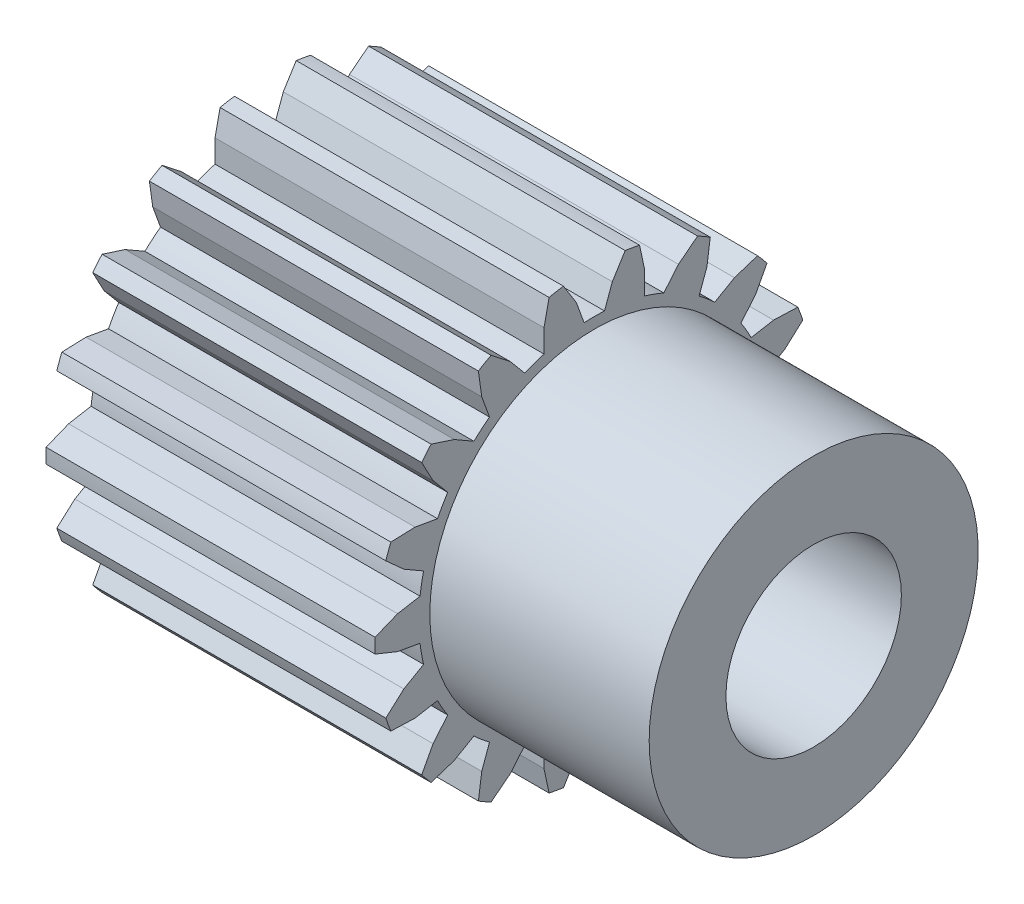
ISO-10303-21;
HEADER;
FILE_DESCRIPTION(('STEP AP214'),'2;1');
FILE_NAME('part.step','',(''),(''),'','','');
FILE_SCHEMA(('AUTOMOTIVE_DESIGN { 1 0 10303 214 1 1 1 1 }'));
ENDSEC;
DATA;
#1=APPLICATION_CONTEXT('core data for automotive mechanical design processes');
#2=APPLICATION_PROTOCOL_DEFINITION('international standard','automotive_design',2000,#1);
#3=PRODUCT_CONTEXT('',#1,'mechanical');
#4=PRODUCT('Part','Part','',(#3));
#5=PRODUCT_RELATED_PRODUCT_CATEGORY('part','',(#4));
#6=PRODUCT_DEFINITION_FORMATION('','',#4);
#7=PRODUCT_DEFINITION_CONTEXT('part definition',#1,'design');
#8=PRODUCT_DEFINITION('design','',#6,#7);
#9=PRODUCT_DEFINITION_SHAPE('','',#8);
#10=(LENGTH_UNIT() NAMED_UNIT(*) SI_UNIT(.MILLI.,.METRE.));
#11=(NAMED_UNIT(*) PLANE_ANGLE_UNIT() SI_UNIT($,.RADIAN.));
#12=(NAMED_UNIT(*) SI_UNIT($,.STERADIAN.) SOLID_ANGLE_UNIT());
#13=UNCERTAINTY_MEASURE_WITH_UNIT(LENGTH_MEASURE(1.E-05),#10,'distance_accuracy_value','');
#14=(GEOMETRIC_REPRESENTATION_CONTEXT(3) GLOBAL_UNCERTAINTY_ASSIGNED_CONTEXT((#13)) GLOBAL_UNIT_ASSIGNED_CONTEXT((#10,
#11,#12)) REPRESENTATION_CONTEXT('',''));
#15=CARTESIAN_POINT('',(0.,0.,0.));
#16=DIRECTION('',(0.,0.,1.));
#17=DIRECTION('',(1.,0.,0.));
#18=AXIS2_PLACEMENT_3D('',#15,#16,#17);
#19=CARTESIAN_POINT('',(7.5,-0.33333333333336,-9.99444290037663));
#20=DIRECTION('',(0.,-0.926974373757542,-0.375124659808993));
#21=DIRECTION('',(0.,-0.375124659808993,0.926974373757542));
#22=AXIS2_PLACEMENT_3D('',#19,#20,#21);
#23=PLANE('',#22);
#24=DIRECTION('',(0.,-0.375124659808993,0.926974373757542));
#25=VECTOR('',#24,1.);
#26=CARTESIAN_POINT('',(7.5,-0.540853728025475,-9.48163713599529));
#27=LINE('',#26,#25);
#28=CARTESIAN_POINT('',(7.5,-0.33333333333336,-9.99444290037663));
#29=VERTEX_POINT('',#28);
#30=CARTESIAN_POINT('',(7.5,-0.74837412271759,-8.96883137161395));
#31=VERTEX_POINT('',#30);
#32=EDGE_CURVE('E696',#29,#31,#27,.T.);
#33=ORIENTED_EDGE('',*,*,#32,.T.);
#34=DIRECTION('',(-1.,0.,0.));
#35=VECTOR('',#34,1.);
#36=CARTESIAN_POINT('',(7.5,-0.74837412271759,-8.96883137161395));
#37=LINE('',#36,#35);
#38=CARTESIAN_POINT('',(-7.5,-0.74837412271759,-8.96883137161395));
#39=VERTEX_POINT('',#38);
#40=EDGE_CURVE('E694',#39,#31,#37,.F.);
#41=ORIENTED_EDGE('',*,*,#40,.F.);
#42=DIRECTION('',(0.,0.375124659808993,-0.926974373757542));
#43=VECTOR('',#42,1.);
#44=CARTESIAN_POINT('',(-7.5,-0.540853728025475,-9.48163713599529));
#45=LINE('',#44,#43);
#46=CARTESIAN_POINT('',(-7.5,-0.333333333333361,-9.99444290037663));
#47=VERTEX_POINT('',#46);
#48=EDGE_CURVE('E679',#39,#47,#45,.T.);
#49=ORIENTED_EDGE('',*,*,#48,.T.);
#50=DIRECTION('',(-1.,0.,0.));
#51=VECTOR('',#50,1.);
#52=CARTESIAN_POINT('',(0.,-0.33333333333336,-9.99444290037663));
#53=LINE('',#52,#51);
#54=EDGE_CURVE('E691',#29,#47,#53,.T.);
#55=ORIENTED_EDGE('',*,*,#54,.F.);
#56=EDGE_LOOP('',(#33,#41,#49,#55));
#57=FACE_BOUND('',#56,.T.);
#58=ADVANCED_FACE('F15',(#57),#23,.T.);
#59=CARTESIAN_POINT('',(7.5,-0.74837412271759,-8.96883137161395));
#60=DIRECTION('',(0.,-0.984807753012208,-0.173648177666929));
#61=DIRECTION('',(0.,-0.173648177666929,0.984807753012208));
#62=AXIS2_PLACEMENT_3D('',#59,#60,#61);
#63=PLANE('',#62);
#64=DIRECTION('',(0.,-0.173648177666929,0.984807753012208));
#65=VECTOR('',#64,1.);
#66=CARTESIAN_POINT('',(7.5,-0.83855871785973,-8.45736911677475));
#67=LINE('',#66,#65);
#68=CARTESIAN_POINT('',(7.5,-0.928743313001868,-7.94590686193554));
#69=VERTEX_POINT('',#68);
#70=EDGE_CURVE('E688',#31,#69,#67,.T.);
#71=ORIENTED_EDGE('',*,*,#70,.T.);
#72=DIRECTION('',(1.,0.,0.));
#73=VECTOR('',#72,1.);
#74=CARTESIAN_POINT('',(0.,-0.928743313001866,-7.94590686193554));
#75=LINE('',#74,#73);
#76=CARTESIAN_POINT('',(-7.5,-0.928743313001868,-7.94590686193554));
#77=VERTEX_POINT('',#76);
#78=EDGE_CURVE('E702',#77,#69,#75,.T.);
#79=ORIENTED_EDGE('',*,*,#78,.F.);
#80=DIRECTION('',(0.,0.173648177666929,-0.984807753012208));
#81=VECTOR('',#80,1.);
#82=CARTESIAN_POINT('',(-7.5,-0.83855871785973,-8.45736911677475));
#83=LINE('',#82,#81);
#84=EDGE_CURVE('E709',#77,#39,#83,.T.);
#85=ORIENTED_EDGE('',*,*,#84,.T.);
#86=ORIENTED_EDGE('',*,*,#40,.T.);
#87=EDGE_LOOP('',(#71,#79,#85,#86));
#88=FACE_BOUND('',#87,.T.);
#89=ADVANCED_FACE('F890',(#88),#63,.T.);
#90=CARTESIAN_POINT('',(-7.5,-1.4999937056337E-13,-6.20163642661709E-13));
#91=DIRECTION('',(-1.,0.,0.));
#92=DIRECTION('',(0.,-1.,0.));
#93=AXIS2_PLACEMENT_3D('',#90,#91,#92);
#94=CYLINDRICAL_SURFACE('',#93,9.99999999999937);
#95=CARTESIAN_POINT('',(7.5,-1.49349210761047E-13,-6.20185326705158E-13));
#96=DIRECTION('',(-1.,0.,0.));
#97=DIRECTION('',(0.,-1.,0.));
#98=AXIS2_PLACEMENT_3D('',#95,#96,#97);
#99=CIRCLE('',#98,9.99999999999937);
#100=CARTESIAN_POINT('',(7.5,0.33333333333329,-9.99444290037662));
#101=VERTEX_POINT('',#100);
#102=EDGE_CURVE('E687',#101,#29,#99,.T.);
#103=ORIENTED_EDGE('',*,*,#102,.T.);
#104=ORIENTED_EDGE('',*,*,#54,.T.);
#105=CARTESIAN_POINT('',(-7.5,-1.4999937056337E-13,-6.20163642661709E-13));
#106=DIRECTION('',(-1.,0.,0.));
#107=DIRECTION('',(0.,-1.,0.));
#108=AXIS2_PLACEMENT_3D('',#105,#106,#107);
#109=CIRCLE('',#108,9.99999999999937);
#110=CARTESIAN_POINT('',(-7.5,0.33333333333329,-9.99444290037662));
#111=VERTEX_POINT('',#110);
#112=EDGE_CURVE('E18',#47,#111,#109,.F.);
#113=ORIENTED_EDGE('',*,*,#112,.T.);
#114=DIRECTION('',(-1.,0.,0.));
#115=VECTOR('',#114,1.);
#116=CARTESIAN_POINT('',(7.5,0.33333333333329,-9.99444290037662));
#117=LINE('',#116,#115);
#118=EDGE_CURVE('E885',#101,#111,#117,.T.);
#119=ORIENTED_EDGE('',*,*,#118,.F.);
#120=EDGE_LOOP('',(#103,#104,#113,#119));
#121=FACE_BOUND('',#120,.T.);
#122=ADVANCED_FACE('F698',(#121),#94,.T.);
#123=CARTESIAN_POINT('',(-7.5,-1.6002824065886E-13,-1.02999206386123E-12));
#124=DIRECTION('',(-1.,0.,0.));
#125=DIRECTION('',(0.,-1.,0.));
#126=AXIS2_PLACEMENT_3D('',#123,#124,#125);
#127=CYLINDRICAL_SURFACE('',#126,7.99999999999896);
#128=CARTESIAN_POINT('',(7.5,-1.59237007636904E-13,-1.03017958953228E-12));
#129=DIRECTION('',(-1.,0.,0.));
#130=DIRECTION('',(0.,-1.,0.));
#131=AXIS2_PLACEMENT_3D('',#128,#129,#130);
#132=CIRCLE('',#131,7.99999999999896);
#133=CARTESIAN_POINT('',(7.5,-1.84492696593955,-7.78435896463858));
#134=VERTEX_POINT('',#133);
#135=EDGE_CURVE('E873',#69,#134,#132,.T.);
#136=ORIENTED_EDGE('',*,*,#135,.T.);
#137=DIRECTION('',(-1.,0.,0.));
#138=VECTOR('',#137,1.);
#139=CARTESIAN_POINT('',(7.5,-1.84492696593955,-7.78435896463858));
#140=LINE('',#139,#138);
#141=CARTESIAN_POINT('',(-7.5,-1.84492696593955,-7.78435896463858));
#142=VERTEX_POINT('',#141);
#143=EDGE_CURVE('E895',#142,#134,#140,.F.);
#144=ORIENTED_EDGE('',*,*,#143,.F.);
#145=CARTESIAN_POINT('',(-7.5,-1.6002824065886E-13,-1.02999206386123E-12));
#146=DIRECTION('',(-1.,0.,0.));
#147=DIRECTION('',(0.,-1.,0.));
#148=AXIS2_PLACEMENT_3D('',#145,#146,#147);
#149=CIRCLE('',#148,7.99999999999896);
#150=EDGE_CURVE('E699',#142,#77,#149,.F.);
#151=ORIENTED_EDGE('',*,*,#150,.T.);
#152=ORIENTED_EDGE('',*,*,#78,.T.);
#153=EDGE_LOOP('',(#136,#144,#151,#152));
#154=FACE_BOUND('',#153,.T.);
#155=ADVANCED_FACE('F896',(#154),#127,.T.);
#156=CARTESIAN_POINT('',(7.5,0.74837412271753,-8.96883137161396));
#157=DIRECTION('',(0.,0.926974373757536,-0.375124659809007));
#158=DIRECTION('',(0.,-0.375124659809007,-0.926974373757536));
#159=AXIS2_PLACEMENT_3D('',#156,#157,#158);
#160=PLANE('',#159);
#161=DIRECTION('',(0.,-0.375124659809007,-0.926974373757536));
#162=VECTOR('',#161,1.);
#163=CARTESIAN_POINT('',(7.5,0.54085372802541,-9.48163713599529));
#164=LINE('',#163,#162);
#165=CARTESIAN_POINT('',(7.5,0.74837412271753,-8.96883137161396));
#166=VERTEX_POINT('',#165);
#167=EDGE_CURVE('E879',#166,#101,#164,.T.);
#168=ORIENTED_EDGE('',*,*,#167,.T.);
#169=ORIENTED_EDGE('',*,*,#118,.T.);
#170=DIRECTION('',(0.,0.375124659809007,0.926974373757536));
#171=VECTOR('',#170,1.);
#172=CARTESIAN_POINT('',(-7.5,0.54085372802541,-9.48163713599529));
#173=LINE('',#172,#171);
#174=CARTESIAN_POINT('',(-7.5,0.74837412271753,-8.96883137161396));
#175=VERTEX_POINT('',#174);
#176=EDGE_CURVE('E682',#111,#175,#173,.T.);
#177=ORIENTED_EDGE('',*,*,#176,.T.);
#178=DIRECTION('',(-1.,0.,0.));
#179=VECTOR('',#178,1.);
#180=CARTESIAN_POINT('',(7.5,0.74837412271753,-8.96883137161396));
#181=LINE('',#180,#179);
#182=EDGE_CURVE('E910',#166,#175,#181,.T.);
#183=ORIENTED_EDGE('',*,*,#182,.F.);
#184=EDGE_LOOP('',(#168,#169,#177,#183));
#185=FACE_BOUND('',#184,.T.);
#186=ADVANCED_FACE('F924',(#185),#160,.T.);
#187=CARTESIAN_POINT('',(7.5,-1.84492696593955,-7.78435896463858));
#188=DIRECTION('',(0.,0.866025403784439,-0.5));
#189=DIRECTION('',(0.,-0.5,-0.866025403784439));
#190=AXIS2_PLACEMENT_3D('',#187,#188,#189);
#191=PLANE('',#190);
#192=DIRECTION('',(0.,-0.5,-0.866025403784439));
#193=VECTOR('',#192,1.);
#194=CARTESIAN_POINT('',(7.5,-2.10460315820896,-8.23413132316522));
#195=LINE('',#194,#193);
#196=CARTESIAN_POINT('',(7.5,-2.36427935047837,-8.68390368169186));
#197=VERTEX_POINT('',#196);
#198=EDGE_CURVE('E898',#134,#197,#195,.T.);
#199=ORIENTED_EDGE('',*,*,#198,.T.);
#200=DIRECTION('',(-1.,0.,0.));
#201=VECTOR('',#200,1.);
#202=CARTESIAN_POINT('',(7.5,-2.36427935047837,-8.68390368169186));
#203=LINE('',#202,#201);
#204=CARTESIAN_POINT('',(-7.5,-2.36427935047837,-8.68390368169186));
#205=VERTEX_POINT('',#204);
#206=EDGE_CURVE('E901',#205,#197,#203,.F.);
#207=ORIENTED_EDGE('',*,*,#206,.F.);
#208=DIRECTION('',(0.,0.5,0.866025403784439));
#209=VECTOR('',#208,1.);
#210=CARTESIAN_POINT('',(-7.5,-2.10460315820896,-8.23413132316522));
#211=LINE('',#210,#209);
#212=EDGE_CURVE('E892',#205,#142,#211,.T.);
#213=ORIENTED_EDGE('',*,*,#212,.T.);
#214=ORIENTED_EDGE('',*,*,#143,.T.);
#215=EDGE_LOOP('',(#199,#207,#213,#214));
#216=FACE_BOUND('',#215,.T.);
#217=ADVANCED_FACE('F899',(#216),#191,.T.);
#218=CARTESIAN_POINT('',(7.5,0.92874331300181,-7.94590686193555));
#219=DIRECTION('',(0.,0.984807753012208,-0.173648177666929));
#220=DIRECTION('',(0.,-0.173648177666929,-0.984807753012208));
#221=AXIS2_PLACEMENT_3D('',#218,#219,#220);
#222=PLANE('',#221);
#223=DIRECTION('',(0.,-0.173648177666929,-0.984807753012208));
#224=VECTOR('',#223,1.);
#225=CARTESIAN_POINT('',(7.5,0.83855871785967,-8.45736911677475));
#226=LINE('',#225,#224);
#227=CARTESIAN_POINT('',(7.5,0.92874331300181,-7.94590686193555));
#228=VERTEX_POINT('',#227);
#229=EDGE_CURVE('E914',#228,#166,#226,.T.);
#230=ORIENTED_EDGE('',*,*,#229,.T.);
#231=ORIENTED_EDGE('',*,*,#182,.T.);
#232=DIRECTION('',(0.,0.173648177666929,0.984807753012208));
#233=VECTOR('',#232,1.);
#234=CARTESIAN_POINT('',(-7.5,0.83855871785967,-8.45736911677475));
#235=LINE('',#234,#233);
#236=CARTESIAN_POINT('',(-7.5,0.92874331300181,-7.94590686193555));
#237=VERTEX_POINT('',#236);
#238=EDGE_CURVE('E931',#175,#237,#235,.T.);
#239=ORIENTED_EDGE('',*,*,#238,.T.);
#240=DIRECTION('',(-1.,0.,0.));
#241=VECTOR('',#240,1.);
#242=CARTESIAN_POINT('',(0.,0.92874331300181,-7.94590686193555));
#243=LINE('',#242,#241);
#244=EDGE_CURVE('E868',#228,#237,#243,.T.);
#245=ORIENTED_EDGE('',*,*,#244,.F.);
#246=EDGE_LOOP('',(#230,#231,#239,#245));
#247=FACE_BOUND('',#246,.T.);
#248=ADVANCED_FACE('F2979',(#247),#222,.T.);
#249=CARTESIAN_POINT('',(7.5,-2.36427935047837,-8.68390368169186));
#250=DIRECTION('',(0.,0.742770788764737,-0.669545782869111));
#251=DIRECTION('',(0.,-0.669545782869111,-0.742770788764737));
#252=AXIS2_PLACEMENT_3D('',#249,#250,#251);
#253=PLANE('',#252);
#254=DIRECTION('',(0.,-0.669545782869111,-0.742770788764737));
#255=VECTOR('',#254,1.);
#256=CARTESIAN_POINT('',(7.5,-2.73467463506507,-9.09480731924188));
#257=LINE('',#256,#255);
#258=CARTESIAN_POINT('',(7.5,-3.10506991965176,-9.5057109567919));
#259=VERTEX_POINT('',#258);
#260=EDGE_CURVE('E872',#197,#259,#257,.T.);
#261=ORIENTED_EDGE('',*,*,#260,.T.);
#262=DIRECTION('',(1.,0.,0.));
#263=VECTOR('',#262,1.);
#264=CARTESIAN_POINT('',(0.,-3.10506991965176,-9.5057109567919));
#265=LINE('',#264,#263);
#266=CARTESIAN_POINT('',(-7.5,-3.10506991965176,-9.5057109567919));
#267=VERTEX_POINT('',#266);
#268=EDGE_CURVE('E954',#267,#259,#265,.T.);
#269=ORIENTED_EDGE('',*,*,#268,.F.);
#270=DIRECTION('',(0.,0.669545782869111,0.742770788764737));
#271=VECTOR('',#270,1.);
#272=CARTESIAN_POINT('',(-7.5,-2.73467463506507,-9.09480731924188));
#273=LINE('',#272,#271);
#274=EDGE_CURVE('E913',#267,#205,#273,.T.);
#275=ORIENTED_EDGE('',*,*,#274,.T.);
#276=ORIENTED_EDGE('',*,*,#206,.T.);
#277=EDGE_LOOP('',(#261,#269,#275,#276));
#278=FACE_BOUND('',#277,.T.);
#279=ADVANCED_FACE('F2971',(#278),#253,.T.);
#280=CARTESIAN_POINT('',(-7.5,0.,-2.80157841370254E-13));
#281=DIRECTION('',(-1.,0.,0.));
#282=DIRECTION('',(0.,-1.,0.));
#283=AXIS2_PLACEMENT_3D('',#280,#281,#282);
#284=CYLINDRICAL_SURFACE('',#283,7.99999999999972);
#285=CARTESIAN_POINT('',(7.5,0.,-2.80063440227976E-13));
#286=DIRECTION('',(-1.,0.,0.));
#287=DIRECTION('',(0.,-1.,0.));
#288=AXIS2_PLACEMENT_3D('',#285,#286,#287);
#289=CIRCLE('',#288,7.99999999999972);
#290=CARTESIAN_POINT('',(7.5,1.84492696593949,-7.78435896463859));
#291=VERTEX_POINT('',#290);
#292=EDGE_CURVE('E865',#291,#228,#289,.T.);
#293=ORIENTED_EDGE('',*,*,#292,.T.);
#294=ORIENTED_EDGE('',*,*,#244,.T.);
#295=CARTESIAN_POINT('',(-7.5,0.,-2.80157841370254E-13));
#296=DIRECTION('',(-1.,0.,0.));
#297=DIRECTION('',(0.,-1.,0.));
#298=AXIS2_PLACEMENT_3D('',#295,#296,#297);
#299=CIRCLE('',#298,7.99999999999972);
#300=CARTESIAN_POINT('',(-7.5,1.84492696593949,-7.78435896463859));
#301=VERTEX_POINT('',#300);
#302=EDGE_CURVE('E869',#237,#301,#299,.F.);
#303=ORIENTED_EDGE('',*,*,#302,.T.);
#304=DIRECTION('',(-1.,0.,0.));
#305=VECTOR('',#304,1.);
#306=CARTESIAN_POINT('',(7.5,1.84492696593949,-7.78435896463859));
#307=LINE('',#306,#305);
#308=EDGE_CURVE('E958',#291,#301,#307,.T.);
#309=ORIENTED_EDGE('',*,*,#308,.F.);
#310=EDGE_LOOP('',(#293,#294,#303,#309));
#311=FACE_BOUND('',#310,.T.);
#312=ADVANCED_FACE('F2963',(#311),#284,.T.);
#313=CARTESIAN_POINT('',(-7.5,-9.49977943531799E-13,-2.36963226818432E-12));
#314=DIRECTION('',(-1.,0.,0.));
#315=DIRECTION('',(0.,-1.,0.));
#316=AXIS2_PLACEMENT_3D('',#313,#314,#315);
#317=CYLINDRICAL_SURFACE('',#316,9.99999999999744);
#318=CARTESIAN_POINT('',(7.5,-9.50000000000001E-13,-2.37E-12));
#319=DIRECTION('',(-1.,0.,0.));
#320=DIRECTION('',(0.,-0.373153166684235,-0.927769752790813));
#321=AXIS2_PLACEMENT_3D('',#318,#319,#320);
#322=CIRCLE('',#321,9.99999999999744);
#323=CARTESIAN_POINT('',(7.5,-3.73153166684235,-9.27769752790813));
#324=VERTEX_POINT('',#323);
#325=EDGE_CURVE('E957',#259,#324,#322,.T.);
#326=ORIENTED_EDGE('',*,*,#325,.T.);
#327=DIRECTION('',(-1.,0.,0.));
#328=VECTOR('',#327,1.);
#329=CARTESIAN_POINT('',(7.5,-3.73153166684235,-9.27769752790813));
#330=LINE('',#329,#328);
#331=CARTESIAN_POINT('',(-7.5,-3.73153166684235,-9.27769752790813));
#332=VERTEX_POINT('',#331);
#333=EDGE_CURVE('E973',#332,#324,#330,.F.);
#334=ORIENTED_EDGE('',*,*,#333,.F.);
#335=CARTESIAN_POINT('',(-7.5,-9.50000000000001E-13,-2.37E-12));
#336=DIRECTION('',(-1.,0.,0.));
#337=DIRECTION('',(0.,-0.373153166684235,-0.927769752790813));
#338=AXIS2_PLACEMENT_3D('',#335,#336,#337);
#339=CIRCLE('',#338,9.99999999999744);
#340=EDGE_CURVE('E945',#332,#267,#339,.F.);
#341=ORIENTED_EDGE('',*,*,#340,.T.);
#342=ORIENTED_EDGE('',*,*,#268,.T.);
#343=EDGE_LOOP('',(#326,#334,#341,#342));
#344=FACE_BOUND('',#343,.T.);
#345=ADVANCED_FACE('F2955',(#344),#317,.T.);
#346=CARTESIAN_POINT('',(7.5,2.36427935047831,-8.68390368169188));
#347=DIRECTION('',(0.,-0.866025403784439,-0.499999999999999));
#348=DIRECTION('',(0.,-0.499999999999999,0.866025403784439));
#349=AXIS2_PLACEMENT_3D('',#346,#347,#348);
#350=PLANE('',#349);
#351=DIRECTION('',(0.,-0.499999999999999,0.866025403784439));
#352=VECTOR('',#351,1.);
#353=CARTESIAN_POINT('',(7.5,2.1046031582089,-8.23413132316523));
#354=LINE('',#353,#352);
#355=CARTESIAN_POINT('',(7.5,2.36427935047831,-8.68390368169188));
#356=VERTEX_POINT('',#355);
#357=EDGE_CURVE('E962',#356,#291,#354,.T.);
#358=ORIENTED_EDGE('',*,*,#357,.T.);
#359=ORIENTED_EDGE('',*,*,#308,.T.);
#360=DIRECTION('',(0.,0.499999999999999,-0.866025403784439));
#361=VECTOR('',#360,1.);
#362=CARTESIAN_POINT('',(-7.5,2.1046031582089,-8.23413132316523));
#363=LINE('',#362,#361);
#364=CARTESIAN_POINT('',(-7.5,2.36427935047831,-8.68390368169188));
#365=VERTEX_POINT('',#364);
#366=EDGE_CURVE('E970',#301,#365,#363,.T.);
#367=ORIENTED_EDGE('',*,*,#366,.T.);
#368=DIRECTION('',(-1.,0.,0.));
#369=VECTOR('',#368,1.);
#370=CARTESIAN_POINT('',(7.5,2.36427935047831,-8.68390368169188));
#371=LINE('',#370,#369);
#372=EDGE_CURVE('E987',#356,#365,#371,.T.);
#373=ORIENTED_EDGE('',*,*,#372,.F.);
#374=EDGE_LOOP('',(#358,#359,#367,#373));
#375=FACE_BOUND('',#374,.T.);
#376=ADVANCED_FACE('F2947',(#375),#350,.T.);
#377=CARTESIAN_POINT('',(7.5,-3.73153166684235,-9.27769752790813));
#378=DIRECTION('',(0.,-0.999371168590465,-0.0354579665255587));
#379=DIRECTION('',(0.,-0.0354579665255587,0.999371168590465));
#380=AXIS2_PLACEMENT_3D('',#377,#378,#379);
#381=PLANE('',#380);
#382=DIRECTION('',(0.,-0.0354579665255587,0.999371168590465));
#383=VECTOR('',#382,1.);
#384=CARTESIAN_POINT('',(7.5,-3.75114714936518,-8.72484158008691));
#385=LINE('',#384,#383);
#386=CARTESIAN_POINT('',(7.5,-3.770762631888,-8.17198563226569));
#387=VERTEX_POINT('',#386);
#388=EDGE_CURVE('E976',#324,#387,#385,.T.);
#389=ORIENTED_EDGE('',*,*,#388,.T.);
#390=DIRECTION('',(-1.,0.,0.));
#391=VECTOR('',#390,1.);
#392=CARTESIAN_POINT('',(7.5,-3.770762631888,-8.17198563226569));
#393=LINE('',#392,#391);
#394=CARTESIAN_POINT('',(-7.5,-3.770762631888,-8.17198563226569));
#395=VERTEX_POINT('',#394);
#396=EDGE_CURVE('E1002',#395,#387,#393,.F.);
#397=ORIENTED_EDGE('',*,*,#396,.F.);
#398=DIRECTION('',(0.,0.0354579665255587,-0.999371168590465));
#399=VECTOR('',#398,1.);
#400=CARTESIAN_POINT('',(-7.5,-3.75114714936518,-8.72484158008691));
#401=LINE('',#400,#399);
#402=EDGE_CURVE('E961',#395,#332,#401,.T.);
#403=ORIENTED_EDGE('',*,*,#402,.T.);
#404=ORIENTED_EDGE('',*,*,#333,.T.);
#405=EDGE_LOOP('',(#389,#397,#403,#404));
#406=FACE_BOUND('',#405,.T.);
#407=ADVANCED_FACE('F2939',(#406),#381,.T.);
#408=CARTESIAN_POINT('',(7.5,3.1050699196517,-9.50571095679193));
#409=DIRECTION('',(0.,-0.742770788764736,-0.669545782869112));
#410=DIRECTION('',(0.,-0.669545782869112,0.742770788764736));
#411=AXIS2_PLACEMENT_3D('',#408,#409,#410);
#412=PLANE('',#411);
#413=DIRECTION('',(0.,-0.669545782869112,0.742770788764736));
#414=VECTOR('',#413,1.);
#415=CARTESIAN_POINT('',(7.5,2.73467463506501,-9.0948073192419));
#416=LINE('',#415,#414);
#417=CARTESIAN_POINT('',(7.5,3.1050699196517,-9.50571095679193));
#418=VERTEX_POINT('',#417);
#419=EDGE_CURVE('E991',#418,#356,#416,.T.);
#420=ORIENTED_EDGE('',*,*,#419,.T.);
#421=ORIENTED_EDGE('',*,*,#372,.T.);
#422=DIRECTION('',(0.,0.669545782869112,-0.742770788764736));
#423=VECTOR('',#422,1.);
#424=CARTESIAN_POINT('',(-7.5,2.73467463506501,-9.0948073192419));
#425=LINE('',#424,#423);
#426=CARTESIAN_POINT('',(-7.5,3.1050699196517,-9.50571095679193));
#427=VERTEX_POINT('',#426);
#428=EDGE_CURVE('E999',#365,#427,#425,.T.);
#429=ORIENTED_EDGE('',*,*,#428,.T.);
#430=DIRECTION('',(-1.,0.,0.));
#431=VECTOR('',#430,1.);
#432=CARTESIAN_POINT('',(0.,3.1050699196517,-9.50571095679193));
#433=LINE('',#432,#431);
#434=EDGE_CURVE('E864',#418,#427,#433,.T.);
#435=ORIENTED_EDGE('',*,*,#434,.F.);
#436=EDGE_LOOP('',(#420,#421,#429,#435));
#437=FACE_BOUND('',#436,.T.);
#438=ADVANCED_FACE('F2931',(#437),#412,.T.);
#439=CARTESIAN_POINT('',(7.5,-3.770762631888,-8.17198563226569));
#440=DIRECTION('',(0.,-0.984807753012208,0.17364817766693));
#441=DIRECTION('',(0.,0.17364817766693,0.984807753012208));
#442=AXIS2_PLACEMENT_3D('',#439,#440,#441);
#443=PLANE('',#442);
#444=DIRECTION('',(0.,0.17364817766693,0.984807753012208));
#445=VECTOR('',#444,1.);
#446=CARTESIAN_POINT('',(7.5,-3.68057803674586,-7.66052337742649));
#447=LINE('',#446,#445);
#448=CARTESIAN_POINT('',(7.5,-3.59039344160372,-7.14906112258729));
#449=VERTEX_POINT('',#448);
#450=EDGE_CURVE('E1005',#387,#449,#447,.T.);
#451=ORIENTED_EDGE('',*,*,#450,.T.);
#452=DIRECTION('',(1.,0.,0.));
#453=VECTOR('',#452,1.);
#454=CARTESIAN_POINT('',(0.,-3.59039344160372,-7.14906112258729));
#455=LINE('',#454,#453);
#456=CARTESIAN_POINT('',(-7.5,-3.59039344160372,-7.14906112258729));
#457=VERTEX_POINT('',#456);
#458=EDGE_CURVE('E860',#457,#449,#455,.T.);
#459=ORIENTED_EDGE('',*,*,#458,.F.);
#460=DIRECTION('',(0.,-0.17364817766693,-0.984807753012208));
#461=VECTOR('',#460,1.);
#462=CARTESIAN_POINT('',(-7.5,-3.68057803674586,-7.66052337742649));
#463=LINE('',#462,#461);
#464=EDGE_CURVE('E990',#457,#395,#463,.T.);
#465=ORIENTED_EDGE('',*,*,#464,.T.);
#466=ORIENTED_EDGE('',*,*,#396,.T.);
#467=EDGE_LOOP('',(#451,#459,#465,#466));
#468=FACE_BOUND('',#467,.T.);
#469=ADVANCED_FACE('F2923',(#468),#443,.T.);
#470=CARTESIAN_POINT('',(-7.5,9.20053963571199E-13,-2.34014196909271E-12));
#471=DIRECTION('',(-1.,0.,0.));
#472=DIRECTION('',(0.,-1.,0.));
#473=AXIS2_PLACEMENT_3D('',#470,#471,#472);
#474=CYLINDRICAL_SURFACE('',#473,9.99999999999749);
#475=CARTESIAN_POINT('',(7.5,9.20000000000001E-13,-2.34E-12));
#476=DIRECTION('',(-1.,0.,0.));
#477=DIRECTION('',(0.,0.310506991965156,-0.950571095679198));
#478=AXIS2_PLACEMENT_3D('',#475,#476,#477);
#479=CIRCLE('',#478,9.99999999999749);
#480=CARTESIAN_POINT('',(7.5,3.7315316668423,-9.27769752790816));
#481=VERTEX_POINT('',#480);
#482=EDGE_CURVE('E1018',#481,#418,#479,.T.);
#483=ORIENTED_EDGE('',*,*,#482,.T.);
#484=ORIENTED_EDGE('',*,*,#434,.T.);
#485=CARTESIAN_POINT('',(-7.5,9.20000000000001E-13,-2.34E-12));
#486=DIRECTION('',(-1.,0.,0.));
#487=DIRECTION('',(0.,0.310506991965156,-0.950571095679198));
#488=AXIS2_PLACEMENT_3D('',#485,#486,#487);
#489=CIRCLE('',#488,9.99999999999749);
#490=CARTESIAN_POINT('',(-7.5,3.7315316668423,-9.27769752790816));
#491=VERTEX_POINT('',#490);
#492=EDGE_CURVE('E1026',#427,#491,#489,.F.);
#493=ORIENTED_EDGE('',*,*,#492,.T.);
#494=DIRECTION('',(-1.,0.,0.));
#495=VECTOR('',#494,1.);
#496=CARTESIAN_POINT('',(7.5,3.7315316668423,-9.27769752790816));
#497=LINE('',#496,#495);
#498=EDGE_CURVE('E1039',#481,#491,#497,.T.);
#499=ORIENTED_EDGE('',*,*,#498,.F.);
#500=EDGE_LOOP('',(#483,#484,#493,#499));
#501=FACE_BOUND('',#500,.T.);
#502=ADVANCED_FACE('F2915',(#501),#474,.T.);
#503=CARTESIAN_POINT('',(-7.5,1.30104260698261E-13,2.39825520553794E-13));
#504=DIRECTION('',(-1.,0.,0.));
#505=DIRECTION('',(0.,-1.,0.));
#506=AXIS2_PLACEMENT_3D('',#503,#504,#505);
#507=CYLINDRICAL_SURFACE('',#506,8.00000000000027);
#508=CARTESIAN_POINT('',(7.5,1.30783638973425E-13,2.39378686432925E-13));
#509=DIRECTION('',(-1.,0.,0.));
#510=DIRECTION('',(0.,-1.,0.));
#511=AXIS2_PLACEMENT_3D('',#508,#509,#510);
#512=CIRCLE('',#511,8.00000000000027);
#513=CARTESIAN_POINT('',(7.5,-4.39607182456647,-6.68390249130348));
#514=VERTEX_POINT('',#513);
#515=EDGE_CURVE('E857',#449,#514,#512,.T.);
#516=ORIENTED_EDGE('',*,*,#515,.T.);
#517=DIRECTION('',(-1.,0.,0.));
#518=VECTOR('',#517,1.);
#519=CARTESIAN_POINT('',(7.5,-4.39607182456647,-6.68390249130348));
#520=LINE('',#519,#518);
#521=CARTESIAN_POINT('',(-7.5,-4.39607182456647,-6.68390249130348));
#522=VERTEX_POINT('',#521);
#523=EDGE_CURVE('E1044',#522,#514,#520,.F.);
#524=ORIENTED_EDGE('',*,*,#523,.F.);
#525=CARTESIAN_POINT('',(-7.5,1.30104260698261E-13,2.39825520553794E-13));
#526=DIRECTION('',(-1.,0.,0.));
#527=DIRECTION('',(0.,-1.,0.));
#528=AXIS2_PLACEMENT_3D('',#525,#526,#527);
#529=CIRCLE('',#528,8.00000000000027);
#530=EDGE_CURVE('E861',#522,#457,#529,.F.);
#531=ORIENTED_EDGE('',*,*,#530,.T.);
#532=ORIENTED_EDGE('',*,*,#458,.T.);
#533=EDGE_LOOP('',(#516,#524,#531,#532));
#534=FACE_BOUND('',#533,.T.);
#535=ADVANCED_FACE('F2907',(#534),#507,.T.);
#536=CARTESIAN_POINT('',(7.5,3.77076263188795,-8.17198563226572));
#537=DIRECTION('',(0.,0.999371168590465,-0.0354579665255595));
#538=DIRECTION('',(0.,-0.0354579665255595,-0.999371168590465));
#539=AXIS2_PLACEMENT_3D('',#536,#537,#538);
#540=PLANE('',#539);
#541=DIRECTION('',(0.,-0.0354579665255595,-0.999371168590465));
#542=VECTOR('',#541,1.);
#543=CARTESIAN_POINT('',(7.5,3.75114714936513,-8.72484158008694));
#544=LINE('',#543,#542);
#545=CARTESIAN_POINT('',(7.5,3.77076263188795,-8.17198563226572));
#546=VERTEX_POINT('',#545);
#547=EDGE_CURVE('E1043',#546,#481,#544,.T.);
#548=ORIENTED_EDGE('',*,*,#547,.T.);
#549=ORIENTED_EDGE('',*,*,#498,.T.);
#550=DIRECTION('',(0.,0.0354579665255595,0.999371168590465));
#551=VECTOR('',#550,1.);
#552=CARTESIAN_POINT('',(-7.5,3.75114714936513,-8.72484158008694));
#553=LINE('',#552,#551);
#554=CARTESIAN_POINT('',(-7.5,3.77076263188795,-8.17198563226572));
#555=VERTEX_POINT('',#554);
#556=EDGE_CURVE('E859',#491,#555,#553,.T.);
#557=ORIENTED_EDGE('',*,*,#556,.T.);
#558=DIRECTION('',(-1.,0.,0.));
#559=VECTOR('',#558,1.);
#560=CARTESIAN_POINT('',(7.5,3.77076263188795,-8.17198563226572));
#561=LINE('',#560,#559);
#562=EDGE_CURVE('E1058',#546,#555,#561,.T.);
#563=ORIENTED_EDGE('',*,*,#562,.F.);
#564=EDGE_LOOP('',(#548,#549,#557,#563));
#565=FACE_BOUND('',#564,.T.);
#566=ADVANCED_FACE('F2899',(#565),#540,.T.);
#567=CARTESIAN_POINT('',(7.5,-4.39607182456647,-6.68390249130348));
#568=DIRECTION('',(0.,0.642787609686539,-0.766044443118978));
#569=DIRECTION('',(0.,-0.766044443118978,-0.642787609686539));
#570=AXIS2_PLACEMENT_3D('',#567,#568,#569);
#571=PLANE('',#570);
#572=DIRECTION('',(0.,-0.766044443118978,-0.642787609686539));
#573=VECTOR('',#572,1.);
#574=CARTESIAN_POINT('',(7.5,-4.79391883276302,-7.01773576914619));
#575=LINE('',#574,#573);
#576=CARTESIAN_POINT('',(7.5,-5.19176584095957,-7.3515690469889));
#577=VERTEX_POINT('',#576);
#578=EDGE_CURVE('E1047',#514,#577,#575,.T.);
#579=ORIENTED_EDGE('',*,*,#578,.T.);
#580=DIRECTION('',(-1.,0.,0.));
#581=VECTOR('',#580,1.);
#582=CARTESIAN_POINT('',(7.5,-5.19176584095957,-7.3515690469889));
#583=LINE('',#582,#581);
#584=CARTESIAN_POINT('',(-7.5,-5.19176584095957,-7.3515690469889));
#585=VERTEX_POINT('',#584);
#586=EDGE_CURVE('E1073',#585,#577,#583,.F.);
#587=ORIENTED_EDGE('',*,*,#586,.F.);
#588=DIRECTION('',(0.,0.766044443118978,0.642787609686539));
#589=VECTOR('',#588,1.);
#590=CARTESIAN_POINT('',(-7.5,-4.79391883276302,-7.01773576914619));
#591=LINE('',#590,#589);
#592=EDGE_CURVE('E1042',#585,#522,#591,.T.);
#593=ORIENTED_EDGE('',*,*,#592,.T.);
#594=ORIENTED_EDGE('',*,*,#523,.T.);
#595=EDGE_LOOP('',(#579,#587,#593,#594));
#596=FACE_BOUND('',#595,.T.);
#597=ADVANCED_FACE('F2891',(#596),#571,.T.);
#598=CARTESIAN_POINT('',(7.5,3.59039344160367,-7.14906112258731));
#599=DIRECTION('',(0.,0.984807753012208,0.17364817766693));
#600=DIRECTION('',(0.,0.17364817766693,-0.984807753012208));
#601=AXIS2_PLACEMENT_3D('',#598,#599,#600);
#602=PLANE('',#601);
#603=DIRECTION('',(0.,0.17364817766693,-0.984807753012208));
#604=VECTOR('',#603,1.);
#605=CARTESIAN_POINT('',(7.5,3.68057803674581,-7.66052337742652));
#606=LINE('',#605,#604);
#607=CARTESIAN_POINT('',(7.5,3.59039344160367,-7.14906112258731));
#608=VERTEX_POINT('',#607);
#609=EDGE_CURVE('E1062',#608,#546,#606,.T.);
#610=ORIENTED_EDGE('',*,*,#609,.T.);
#611=ORIENTED_EDGE('',*,*,#562,.T.);
#612=DIRECTION('',(0.,-0.17364817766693,0.984807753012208));
#613=VECTOR('',#612,1.);
#614=CARTESIAN_POINT('',(-7.5,3.68057803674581,-7.66052337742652));
#615=LINE('',#614,#613);
#616=CARTESIAN_POINT('',(-7.5,3.59039344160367,-7.14906112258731));
#617=VERTEX_POINT('',#616);
#618=EDGE_CURVE('E1070',#555,#617,#615,.T.);
#619=ORIENTED_EDGE('',*,*,#618,.T.);
#620=DIRECTION('',(-1.,0.,0.));
#621=VECTOR('',#620,1.);
#622=CARTESIAN_POINT('',(0.,3.59039344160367,-7.14906112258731));
#623=LINE('',#622,#621);
#624=EDGE_CURVE('E852',#608,#617,#623,.T.);
#625=ORIENTED_EDGE('',*,*,#624,.F.);
#626=EDGE_LOOP('',(#610,#611,#619,#625));
#627=FACE_BOUND('',#626,.T.);
#628=ADVANCED_FACE('F2883',(#627),#602,.T.);
#629=CARTESIAN_POINT('',(7.5,-5.19176584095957,-7.3515690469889));
#630=DIRECTION('',(0.,0.468978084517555,-0.883209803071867));
#631=DIRECTION('',(0.,-0.883209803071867,-0.468978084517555));
#632=AXIS2_PLACEMENT_3D('',#629,#630,#631);
#633=PLANE('',#632);
#634=DIRECTION('',(0.,-0.883209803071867,-0.468978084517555));
#635=VECTOR('',#634,1.);
#636=CARTESIAN_POINT('',(7.5,-5.68036087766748,-7.61100951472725));
#637=LINE('',#636,#635);
#638=CARTESIAN_POINT('',(7.5,-6.1689559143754,-7.8704499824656));
#639=VERTEX_POINT('',#638);
#640=EDGE_CURVE('E856',#577,#639,#637,.T.);
#641=ORIENTED_EDGE('',*,*,#640,.T.);
#642=DIRECTION('',(1.,0.,0.));
#643=VECTOR('',#642,1.);
#644=CARTESIAN_POINT('',(0.,-6.1689559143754,-7.87044998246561));
#645=LINE('',#644,#643);
#646=CARTESIAN_POINT('',(-7.5,-6.1689559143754,-7.8704499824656));
#647=VERTEX_POINT('',#646);
#648=EDGE_CURVE('E1096',#647,#639,#645,.T.);
#649=ORIENTED_EDGE('',*,*,#648,.F.);
#650=DIRECTION('',(0.,0.883209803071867,0.468978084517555));
#651=VECTOR('',#650,1.);
#652=CARTESIAN_POINT('',(-7.5,-5.68036087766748,-7.61100951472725));
#653=LINE('',#652,#651);
#654=EDGE_CURVE('E1061',#647,#585,#653,.T.);
#655=ORIENTED_EDGE('',*,*,#654,.T.);
#656=ORIENTED_EDGE('',*,*,#586,.T.);
#657=EDGE_LOOP('',(#641,#649,#655,#656));
#658=FACE_BOUND('',#657,.T.);
#659=ADVANCED_FACE('F2875',(#658),#633,.T.);
#660=CARTESIAN_POINT('',(-7.5,3.40005801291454E-13,-4.60135402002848E-13));
#661=DIRECTION('',(-1.,0.,0.));
#662=DIRECTION('',(0.,-1.,0.));
#663=AXIS2_PLACEMENT_3D('',#660,#661,#662);
#664=CYLINDRICAL_SURFACE('',#663,7.99999999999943);
#665=CARTESIAN_POINT('',(7.5,3.40732460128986E-13,-4.59770460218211E-13));
#666=DIRECTION('',(-1.,0.,0.));
#667=DIRECTION('',(0.,-1.,0.));
#668=AXIS2_PLACEMENT_3D('',#665,#666,#667);
#669=CIRCLE('',#668,7.99999999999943);
#670=CARTESIAN_POINT('',(7.5,4.39607182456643,-6.68390249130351));
#671=VERTEX_POINT('',#670);
#672=EDGE_CURVE('E849',#671,#608,#669,.T.);
#673=ORIENTED_EDGE('',*,*,#672,.T.);
#674=ORIENTED_EDGE('',*,*,#624,.T.);
#675=CARTESIAN_POINT('',(-7.5,3.40005801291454E-13,-4.60135402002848E-13));
#676=DIRECTION('',(-1.,0.,0.));
#677=DIRECTION('',(0.,-1.,0.));
#678=AXIS2_PLACEMENT_3D('',#675,#676,#677);
#679=CIRCLE('',#678,7.99999999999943);
#680=CARTESIAN_POINT('',(-7.5,4.39607182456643,-6.68390249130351));
#681=VERTEX_POINT('',#680);
#682=EDGE_CURVE('E853',#617,#681,#679,.F.);
#683=ORIENTED_EDGE('',*,*,#682,.T.);
#684=DIRECTION('',(-1.,0.,0.));
#685=VECTOR('',#684,1.);
#686=CARTESIAN_POINT('',(7.5,4.39607182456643,-6.68390249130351));
#687=LINE('',#686,#685);
#688=EDGE_CURVE('E1100',#671,#681,#687,.T.);
#689=ORIENTED_EDGE('',*,*,#688,.F.);
#690=EDGE_LOOP('',(#673,#674,#683,#689));
#691=FACE_BOUND('',#690,.T.);
#692=ADVANCED_FACE('F2867',(#691),#664,.T.);
#693=CARTESIAN_POINT('',(-7.5,-2.54006884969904E-12,-3.08997619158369E-12));
#694=DIRECTION('',(-1.,0.,0.));
#695=DIRECTION('',(0.,-1.,0.));
#696=AXIS2_PLACEMENT_3D('',#693,#694,#695);
#697=CYLINDRICAL_SURFACE('',#696,9.999999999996);
#698=CARTESIAN_POINT('',(7.5,-2.54E-12,-3.09E-12));
#699=DIRECTION('',(-1.,0.,0.));
#700=DIRECTION('',(0.,-0.667965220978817,-0.744192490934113));
#701=AXIS2_PLACEMENT_3D('',#698,#699,#700);
#702=CIRCLE('',#701,9.999999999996);
#703=CARTESIAN_POINT('',(7.5,-6.67965220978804,-7.44192490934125));
#704=VERTEX_POINT('',#703);
#705=EDGE_CURVE('E1099',#639,#704,#702,.T.);
#706=ORIENTED_EDGE('',*,*,#705,.T.);
#707=DIRECTION('',(-1.,0.,0.));
#708=VECTOR('',#707,1.);
#709=CARTESIAN_POINT('',(7.5,-6.67965220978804,-7.44192490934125));
#710=LINE('',#709,#708);
#711=CARTESIAN_POINT('',(-7.5,-6.67965220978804,-7.44192490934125));
#712=VERTEX_POINT('',#711);
#713=EDGE_CURVE('E1115',#712,#704,#710,.F.);
#714=ORIENTED_EDGE('',*,*,#713,.F.);
#715=CARTESIAN_POINT('',(-7.5,-2.54E-12,-3.09E-12));
#716=DIRECTION('',(-1.,0.,0.));
#717=DIRECTION('',(0.,-0.667965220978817,-0.744192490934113));
#718=AXIS2_PLACEMENT_3D('',#715,#716,#717);
#719=CIRCLE('',#718,9.999999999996);
#720=EDGE_CURVE('E1086',#712,#647,#719,.F.);
#721=ORIENTED_EDGE('',*,*,#720,.T.);
#722=ORIENTED_EDGE('',*,*,#648,.T.);
#723=EDGE_LOOP('',(#706,#714,#721,#722));
#724=FACE_BOUND('',#723,.T.);
#725=ADVANCED_FACE('F2859',(#724),#697,.T.);
#726=CARTESIAN_POINT('',(7.5,5.19176584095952,-7.35156904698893));
#727=DIRECTION('',(0.,-0.642787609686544,-0.766044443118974));
#728=DIRECTION('',(0.,-0.766044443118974,0.642787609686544));
#729=AXIS2_PLACEMENT_3D('',#726,#727,#728);
#730=PLANE('',#729);
#731=DIRECTION('',(0.,-0.766044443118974,0.642787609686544));
#732=VECTOR('',#731,1.);
#733=CARTESIAN_POINT('',(7.5,4.79391883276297,-7.01773576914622));
#734=LINE('',#733,#732);
#735=CARTESIAN_POINT('',(7.5,5.19176584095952,-7.35156904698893));
#736=VERTEX_POINT('',#735);
#737=EDGE_CURVE('E1104',#736,#671,#734,.T.);
#738=ORIENTED_EDGE('',*,*,#737,.T.);
#739=ORIENTED_EDGE('',*,*,#688,.T.);
#740=DIRECTION('',(0.,0.766044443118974,-0.642787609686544));
#741=VECTOR('',#740,1.);
#742=CARTESIAN_POINT('',(-7.5,4.79391883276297,-7.01773576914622));
#743=LINE('',#742,#741);
#744=CARTESIAN_POINT('',(-7.5,5.19176584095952,-7.35156904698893));
#745=VERTEX_POINT('',#744);
#746=EDGE_CURVE('E1112',#681,#745,#743,.T.);
#747=ORIENTED_EDGE('',*,*,#746,.T.);
#748=DIRECTION('',(-1.,0.,0.));
#749=VECTOR('',#748,1.);
#750=CARTESIAN_POINT('',(7.5,5.19176584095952,-7.35156904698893));
#751=LINE('',#750,#749);
#752=EDGE_CURVE('E1129',#736,#745,#751,.T.);
#753=ORIENTED_EDGE('',*,*,#752,.F.);
#754=EDGE_LOOP('',(#738,#739,#747,#753));
#755=FACE_BOUND('',#754,.T.);
#756=ADVANCED_FACE('F2851',(#755),#730,.T.);
#757=CARTESIAN_POINT('',(7.5,-6.67965220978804,-7.44192490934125));
#758=DIRECTION('',(0.,-0.951229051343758,0.308485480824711));
#759=DIRECTION('',(0.,0.308485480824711,0.951229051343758));
#760=AXIS2_PLACEMENT_3D('',#757,#758,#759);
#761=PLANE('',#760);
#762=DIRECTION('',(0.,0.308485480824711,0.951229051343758));
#763=VECTOR('',#762,1.);
#764=CARTESIAN_POINT('',(7.5,-6.50899686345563,-6.91570136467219));
#765=LINE('',#764,#763);
#766=CARTESIAN_POINT('',(7.5,-6.33834151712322,-6.38947782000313));
#767=VERTEX_POINT('',#766);
#768=EDGE_CURVE('E1118',#704,#767,#765,.T.);
#769=ORIENTED_EDGE('',*,*,#768,.T.);
#770=DIRECTION('',(-1.,0.,0.));
#771=VECTOR('',#770,1.);
#772=CARTESIAN_POINT('',(7.5,-6.33834151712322,-6.38947782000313));
#773=LINE('',#772,#771);
#774=CARTESIAN_POINT('',(-7.5,-6.33834151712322,-6.38947782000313));
#775=VERTEX_POINT('',#774);
#776=EDGE_CURVE('E1144',#775,#767,#773,.F.);
#777=ORIENTED_EDGE('',*,*,#776,.F.);
#778=DIRECTION('',(0.,-0.308485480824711,-0.951229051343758));
#779=VECTOR('',#778,1.);
#780=CARTESIAN_POINT('',(-7.5,-6.50899686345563,-6.91570136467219));
#781=LINE('',#780,#779);
#782=EDGE_CURVE('E1103',#775,#712,#781,.T.);
#783=ORIENTED_EDGE('',*,*,#782,.T.);
#784=ORIENTED_EDGE('',*,*,#713,.T.);
#785=EDGE_LOOP('',(#769,#777,#783,#784));
#786=FACE_BOUND('',#785,.T.);
#787=ADVANCED_FACE('F2843',(#786),#761,.T.);
#788=CARTESIAN_POINT('',(7.5,6.16895591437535,-7.87044998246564));
#789=DIRECTION('',(0.,-0.468978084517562,-0.883209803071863));
#790=DIRECTION('',(0.,-0.883209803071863,0.468978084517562));
#791=AXIS2_PLACEMENT_3D('',#788,#789,#790);
#792=PLANE('',#791);
#793=DIRECTION('',(0.,-0.883209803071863,0.468978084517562));
#794=VECTOR('',#793,1.);
#795=CARTESIAN_POINT('',(7.5,5.68036087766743,-7.61100951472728));
#796=LINE('',#795,#794);
#797=CARTESIAN_POINT('',(7.5,6.16895591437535,-7.87044998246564));
#798=VERTEX_POINT('',#797);
#799=EDGE_CURVE('E1133',#798,#736,#796,.T.);
#800=ORIENTED_EDGE('',*,*,#799,.T.);
#801=ORIENTED_EDGE('',*,*,#752,.T.);
#802=DIRECTION('',(0.,0.883209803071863,-0.468978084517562));
#803=VECTOR('',#802,1.);
#804=CARTESIAN_POINT('',(-7.5,5.68036087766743,-7.61100951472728));
#805=LINE('',#804,#803);
#806=CARTESIAN_POINT('',(-7.5,6.16895591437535,-7.87044998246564));
#807=VERTEX_POINT('',#806);
#808=EDGE_CURVE('E1141',#745,#807,#805,.T.);
#809=ORIENTED_EDGE('',*,*,#808,.T.);
#810=DIRECTION('',(-1.,0.,0.));
#811=VECTOR('',#810,1.);
#812=CARTESIAN_POINT('',(0.,6.16895591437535,-7.87044998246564));
#813=LINE('',#812,#811);
#814=EDGE_CURVE('E848',#798,#807,#813,.T.);
#815=ORIENTED_EDGE('',*,*,#814,.F.);
#816=EDGE_LOOP('',(#800,#801,#809,#815));
#817=FACE_BOUND('',#816,.T.);
#818=ADVANCED_FACE('F2835',(#817),#792,.T.);
#819=CARTESIAN_POINT('',(7.5,-6.33834151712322,-6.38947782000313));
#820=DIRECTION('',(0.,-0.866025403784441,0.499999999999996));
#821=DIRECTION('',(0.,0.499999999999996,0.866025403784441));
#822=AXIS2_PLACEMENT_3D('',#819,#820,#821);
#823=PLANE('',#822);
#824=DIRECTION('',(0.,0.499999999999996,0.866025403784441));
#825=VECTOR('',#824,1.);
#826=CARTESIAN_POINT('',(7.5,-6.07866532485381,-5.93970546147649));
#827=LINE('',#826,#825);
#828=CARTESIAN_POINT('',(7.5,-5.81898913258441,-5.48993310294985));
#829=VERTEX_POINT('',#828);
#830=EDGE_CURVE('E1147',#767,#829,#827,.T.);
#831=ORIENTED_EDGE('',*,*,#830,.T.);
#832=DIRECTION('',(1.,0.,0.));
#833=VECTOR('',#832,1.);
#834=CARTESIAN_POINT('',(0.,-5.8189891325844,-5.48993310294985));
#835=LINE('',#834,#833);
#836=CARTESIAN_POINT('',(-7.5,-5.81898913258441,-5.48993310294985));
#837=VERTEX_POINT('',#836);
#838=EDGE_CURVE('E844',#837,#829,#835,.T.);
#839=ORIENTED_EDGE('',*,*,#838,.F.);
#840=DIRECTION('',(0.,-0.499999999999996,-0.866025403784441));
#841=VECTOR('',#840,1.);
#842=CARTESIAN_POINT('',(-7.5,-6.07866532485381,-5.93970546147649));
#843=LINE('',#842,#841);
#844=EDGE_CURVE('E1132',#837,#775,#843,.T.);
#845=ORIENTED_EDGE('',*,*,#844,.T.);
#846=ORIENTED_EDGE('',*,*,#776,.T.);
#847=EDGE_LOOP('',(#831,#839,#845,#846));
#848=FACE_BOUND('',#847,.T.);
#849=ADVANCED_FACE('F2827',(#848),#823,.T.);
#850=CARTESIAN_POINT('',(-7.5,1.78980094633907E-12,-2.05998412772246E-12));
#851=DIRECTION('',(-1.,0.,0.));
#852=DIRECTION('',(0.,-1.,0.));
#853=AXIS2_PLACEMENT_3D('',#850,#851,#852);
#854=CYLINDRICAL_SURFACE('',#853,9.99999999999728);
#855=CARTESIAN_POINT('',(7.5,1.79E-12,-2.06E-12));
#856=DIRECTION('',(-1.,0.,0.));
#857=DIRECTION('',(0.,0.616895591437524,-0.787044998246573));
#858=AXIS2_PLACEMENT_3D('',#855,#856,#857);
#859=CIRCLE('',#858,9.99999999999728);
#860=CARTESIAN_POINT('',(7.5,6.679652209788,-7.44192490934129));
#861=VERTEX_POINT('',#860);
#862=EDGE_CURVE('E1160',#861,#798,#859,.T.);
#863=ORIENTED_EDGE('',*,*,#862,.T.);
#864=ORIENTED_EDGE('',*,*,#814,.T.);
#865=CARTESIAN_POINT('',(-7.5,1.79E-12,-2.06E-12));
#866=DIRECTION('',(-1.,0.,0.));
#867=DIRECTION('',(0.,0.616895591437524,-0.787044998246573));
#868=AXIS2_PLACEMENT_3D('',#865,#866,#867);
#869=CIRCLE('',#868,9.99999999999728);
#870=CARTESIAN_POINT('',(-7.5,6.679652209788,-7.44192490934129));
#871=VERTEX_POINT('',#870);
#872=EDGE_CURVE('E1168',#807,#871,#869,.F.);
#873=ORIENTED_EDGE('',*,*,#872,.T.);
#874=DIRECTION('',(-1.,0.,0.));
#875=VECTOR('',#874,1.);
#876=CARTESIAN_POINT('',(7.5,6.679652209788,-7.44192490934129));
#877=LINE('',#876,#875);
#878=EDGE_CURVE('E1181',#861,#871,#877,.T.);
#879=ORIENTED_EDGE('',*,*,#878,.F.);
#880=EDGE_LOOP('',(#863,#864,#873,#879));
#881=FACE_BOUND('',#880,.T.);
#882=ADVANCED_FACE('F2819',(#881),#854,.T.);
#883=CARTESIAN_POINT('',(-7.5,1.6002824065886E-13,0.));
#884=DIRECTION('',(-1.,0.,0.));
#885=DIRECTION('',(0.,0.,1.));
#886=AXIS2_PLACEMENT_3D('',#883,#884,#885);
#887=CYLINDRICAL_SURFACE('',#886,8.00000000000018);
#888=CARTESIAN_POINT('',(7.5,1.60513821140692E-13,0.));
#889=DIRECTION('',(-1.,0.,0.));
#890=DIRECTION('',(0.,0.,1.));
#891=AXIS2_PLACEMENT_3D('',#888,#889,#890);
#892=CIRCLE('',#891,8.00000000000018);
#893=CARTESIAN_POINT('',(7.5,-6.41698554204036,-4.77726873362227));
#894=VERTEX_POINT('',#893);
#895=EDGE_CURVE('E841',#829,#894,#892,.T.);
#896=ORIENTED_EDGE('',*,*,#895,.T.);
#897=DIRECTION('',(-1.,0.,0.));
#898=VECTOR('',#897,1.);
#899=CARTESIAN_POINT('',(7.5,-6.41698554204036,-4.77726873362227));
#900=LINE('',#899,#898);
#901=CARTESIAN_POINT('',(-7.5,-6.41698554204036,-4.77726873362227));
#902=VERTEX_POINT('',#901);
#903=EDGE_CURVE('E1186',#902,#894,#900,.F.);
#904=ORIENTED_EDGE('',*,*,#903,.F.);
#905=CARTESIAN_POINT('',(-7.5,1.6002824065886E-13,0.));
#906=DIRECTION('',(-1.,0.,0.));
#907=DIRECTION('',(0.,0.,1.));
#908=AXIS2_PLACEMENT_3D('',#905,#906,#907);
#909=CIRCLE('',#908,8.00000000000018);
#910=EDGE_CURVE('E845',#902,#837,#909,.F.);
#911=ORIENTED_EDGE('',*,*,#910,.T.);
#912=ORIENTED_EDGE('',*,*,#838,.T.);
#913=EDGE_LOOP('',(#896,#904,#911,#912));
#914=FACE_BOUND('',#913,.T.);
#915=ADVANCED_FACE('F2811',(#914),#887,.T.);
#916=CARTESIAN_POINT('',(7.5,6.33834151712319,-6.38947782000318));
#917=DIRECTION('',(0.,0.95122905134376,0.308485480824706));
#918=DIRECTION('',(0.,0.308485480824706,-0.95122905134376));
#919=AXIS2_PLACEMENT_3D('',#916,#917,#918);
#920=PLANE('',#919);
#921=DIRECTION('',(0.,0.308485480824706,-0.95122905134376));
#922=VECTOR('',#921,1.);
#923=CARTESIAN_POINT('',(7.5,6.5089968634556,-6.91570136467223));
#924=LINE('',#923,#922);
#925=CARTESIAN_POINT('',(7.5,6.33834151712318,-6.38947782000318));
#926=VERTEX_POINT('',#925);
#927=EDGE_CURVE('E1185',#926,#861,#924,.T.);
#928=ORIENTED_EDGE('',*,*,#927,.T.);
#929=ORIENTED_EDGE('',*,*,#878,.T.);
#930=DIRECTION('',(0.,-0.308485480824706,0.95122905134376));
#931=VECTOR('',#930,1.);
#932=CARTESIAN_POINT('',(-7.5,6.5089968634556,-6.91570136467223));
#933=LINE('',#932,#931);
#934=CARTESIAN_POINT('',(-7.5,6.33834151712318,-6.38947782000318));
#935=VERTEX_POINT('',#934);
#936=EDGE_CURVE('E843',#871,#935,#933,.T.);
#937=ORIENTED_EDGE('',*,*,#936,.T.);
#938=DIRECTION('',(-1.,0.,0.));
#939=VECTOR('',#938,1.);
#940=CARTESIAN_POINT('',(7.5,6.33834151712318,-6.38947782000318));
#941=LINE('',#940,#939);
#942=EDGE_CURVE('E1200',#926,#935,#941,.T.);
#943=ORIENTED_EDGE('',*,*,#942,.F.);
#944=EDGE_LOOP('',(#928,#929,#937,#943));
#945=FACE_BOUND('',#944,.T.);
#946=ADVANCED_FACE('F2803',(#945),#920,.T.);
#947=CARTESIAN_POINT('',(7.5,-6.41698554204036,-4.77726873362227));
#948=DIRECTION('',(0.,0.342020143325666,-0.939692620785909));
#949=DIRECTION('',(0.,-0.939692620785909,-0.342020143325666));
#950=AXIS2_PLACEMENT_3D('',#947,#948,#949);
#951=PLANE('',#950);
#952=DIRECTION('',(0.,-0.939692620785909,-0.342020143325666));
#953=VECTOR('',#952,1.);
#954=CARTESIAN_POINT('',(7.5,-6.90501714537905,-4.95489771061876));
#955=LINE('',#954,#953);
#956=CARTESIAN_POINT('',(7.5,-7.39304874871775,-5.13252668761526));
#957=VERTEX_POINT('',#956);
#958=EDGE_CURVE('E1189',#894,#957,#955,.T.);
#959=ORIENTED_EDGE('',*,*,#958,.T.);
#960=DIRECTION('',(-1.,0.,0.));
#961=VECTOR('',#960,1.);
#962=CARTESIAN_POINT('',(7.5,-7.39304874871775,-5.13252668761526));
#963=LINE('',#962,#961);
#964=CARTESIAN_POINT('',(-7.5,-7.39304874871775,-5.13252668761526));
#965=VERTEX_POINT('',#964);
#966=EDGE_CURVE('E1215',#965,#957,#963,.F.);
#967=ORIENTED_EDGE('',*,*,#966,.F.);
#968=DIRECTION('',(0.,0.939692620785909,0.342020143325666));
#969=VECTOR('',#968,1.);
#970=CARTESIAN_POINT('',(-7.5,-6.90501714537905,-4.95489771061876));
#971=LINE('',#970,#969);
#972=EDGE_CURVE('E1184',#965,#902,#971,.T.);
#973=ORIENTED_EDGE('',*,*,#972,.T.);
#974=ORIENTED_EDGE('',*,*,#903,.T.);
#975=EDGE_LOOP('',(#959,#967,#973,#974));
#976=FACE_BOUND('',#975,.T.);
#977=ADVANCED_FACE('F2795',(#976),#951,.T.);
#978=CARTESIAN_POINT('',(7.5,5.81898913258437,-5.48993310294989));
#979=DIRECTION('',(0.,0.866025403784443,0.499999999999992));
#980=DIRECTION('',(0.,0.499999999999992,-0.866025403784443));
#981=AXIS2_PLACEMENT_3D('',#978,#979,#980);
#982=PLANE('',#981);
#983=DIRECTION('',(0.,0.499999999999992,-0.866025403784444));
#984=VECTOR('',#983,1.);
#985=CARTESIAN_POINT('',(7.5,6.07866532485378,-5.93970546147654));
#986=LINE('',#985,#984);
#987=CARTESIAN_POINT('',(7.5,5.81898913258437,-5.48993310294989));
#988=VERTEX_POINT('',#987);
#989=EDGE_CURVE('E1204',#988,#926,#986,.T.);
#990=ORIENTED_EDGE('',*,*,#989,.T.);
#991=ORIENTED_EDGE('',*,*,#942,.T.);
#992=DIRECTION('',(0.,-0.499999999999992,0.866025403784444));
#993=VECTOR('',#992,1.);
#994=CARTESIAN_POINT('',(-7.5,6.07866532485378,-5.93970546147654));
#995=LINE('',#994,#993);
#996=CARTESIAN_POINT('',(-7.5,5.81898913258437,-5.48993310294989));
#997=VERTEX_POINT('',#996);
#998=EDGE_CURVE('E1212',#935,#997,#995,.T.);
#999=ORIENTED_EDGE('',*,*,#998,.T.);
#1000=DIRECTION('',(-1.,0.,0.));
#1001=VECTOR('',#1000,1.);
#1002=CARTESIAN_POINT('',(0.,5.81898913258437,-5.48993310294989));
#1003=LINE('',#1002,#1001);
#1004=EDGE_CURVE('E836',#988,#997,#1003,.T.);
#1005=ORIENTED_EDGE('',*,*,#1004,.F.);
#1006=EDGE_LOOP('',(#990,#991,#999,#1005));
#1007=FACE_BOUND('',#1006,.T.);
#1008=ADVANCED_FACE('F2787',(#1007),#982,.T.);
#1009=CARTESIAN_POINT('',(7.5,-7.39304874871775,-5.13252668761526));
#1010=DIRECTION('',(0.,0.13861970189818,-0.9903456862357));
#1011=DIRECTION('',(0.,-0.9903456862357,-0.13861970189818));
#1012=AXIS2_PLACEMENT_3D('',#1009,#1010,#1011);
#1013=PLANE('',#1012);
#1014=DIRECTION('',(0.,-0.9903456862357,-0.13861970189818));
#1015=VECTOR('',#1014,1.);
#1016=CARTESIAN_POINT('',(7.5,-7.94091176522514,-5.20921163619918));
#1017=LINE('',#1016,#1015);
#1018=CARTESIAN_POINT('',(7.5,-8.48877478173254,-5.2858965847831));
#1019=VERTEX_POINT('',#1018);
#1020=EDGE_CURVE('E840',#957,#1019,#1017,.T.);
#1021=ORIENTED_EDGE('',*,*,#1020,.T.);
#1022=DIRECTION('',(1.,0.,0.));
#1023=VECTOR('',#1022,1.);
#1024=CARTESIAN_POINT('',(0.,-8.48877478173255,-5.28589658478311));
#1025=LINE('',#1024,#1023);
#1026=CARTESIAN_POINT('',(-7.5,-8.48877478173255,-5.2858965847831));
#1027=VERTEX_POINT('',#1026);
#1028=EDGE_CURVE('E1238',#1027,#1019,#1025,.T.);
#1029=ORIENTED_EDGE('',*,*,#1028,.F.);
#1030=DIRECTION('',(0.,0.9903456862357,0.13861970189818));
#1031=VECTOR('',#1030,1.);
#1032=CARTESIAN_POINT('',(-7.5,-7.94091176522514,-5.20921163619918));
#1033=LINE('',#1032,#1031);
#1034=EDGE_CURVE('E1203',#1027,#965,#1033,.T.);
#1035=ORIENTED_EDGE('',*,*,#1034,.T.);
#1036=ORIENTED_EDGE('',*,*,#966,.T.);
#1037=EDGE_LOOP('',(#1021,#1029,#1035,#1036));
#1038=FACE_BOUND('',#1037,.T.);
#1039=ADVANCED_FACE('F2779',(#1038),#1013,.T.);
#1040=CARTESIAN_POINT('',(-7.5,1.40078920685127E-13,-1.99926880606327E-13));
#1041=DIRECTION('',(-1.,0.,0.));
#1042=DIRECTION('',(0.,0.,1.));
#1043=AXIS2_PLACEMENT_3D('',#1040,#1041,#1042);
#1044=CYLINDRICAL_SURFACE('',#1043,7.99999999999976);
#1045=CARTESIAN_POINT('',(7.5,1.40636939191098E-13,-1.99335415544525E-13));
#1046=DIRECTION('',(-1.,0.,0.));
#1047=DIRECTION('',(0.,0.,1.));
#1048=AXIS2_PLACEMENT_3D('',#1045,#1046,#1047);
#1049=CIRCLE('',#1048,7.99999999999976);
#1050=CARTESIAN_POINT('',(7.5,6.41698554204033,-4.77726873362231));
#1051=VERTEX_POINT('',#1050);
#1052=EDGE_CURVE('E833',#1051,#988,#1049,.T.);
#1053=ORIENTED_EDGE('',*,*,#1052,.T.);
#1054=ORIENTED_EDGE('',*,*,#1004,.T.);
#1055=CARTESIAN_POINT('',(-7.5,1.40078920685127E-13,-1.99926880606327E-13));
#1056=DIRECTION('',(-1.,0.,0.));
#1057=DIRECTION('',(0.,0.,1.));
#1058=AXIS2_PLACEMENT_3D('',#1055,#1056,#1057);
#1059=CIRCLE('',#1058,7.99999999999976);
#1060=CARTESIAN_POINT('',(-7.5,6.41698554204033,-4.77726873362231));
#1061=VERTEX_POINT('',#1060);
#1062=EDGE_CURVE('E837',#997,#1061,#1059,.F.);
#1063=ORIENTED_EDGE('',*,*,#1062,.T.);
#1064=DIRECTION('',(-1.,0.,0.));
#1065=VECTOR('',#1064,1.);
#1066=CARTESIAN_POINT('',(7.5,6.41698554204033,-4.77726873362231));
#1067=LINE('',#1066,#1065);
#1068=EDGE_CURVE('E1242',#1051,#1061,#1067,.T.);
#1069=ORIENTED_EDGE('',*,*,#1068,.F.);
#1070=EDGE_LOOP('',(#1053,#1054,#1063,#1069));
#1071=FACE_BOUND('',#1070,.T.);
#1072=ADVANCED_FACE('F2771',(#1071),#1044,.T.);
#1073=CARTESIAN_POINT('',(-7.5,-3.59955121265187E-13,-2.09901540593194E-13));
#1074=DIRECTION('',(-1.,0.,0.));
#1075=DIRECTION('',(0.,0.,1.));
#1076=AXIS2_PLACEMENT_3D('',#1073,#1074,#1075);
#1077=CYLINDRICAL_SURFACE('',#1076,9.99999999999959);
#1078=CARTESIAN_POINT('',(7.5,-3.6E-13,-2.1E-13));
#1079=DIRECTION('',(-1.,0.,0.));
#1080=DIRECTION('',(0.,-0.882210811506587,-0.470854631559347));
#1081=AXIS2_PLACEMENT_3D('',#1078,#1079,#1080);
#1082=CIRCLE('',#1081,9.99999999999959);
#1083=CARTESIAN_POINT('',(7.5,-8.82210811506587,-4.70854631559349));
#1084=VERTEX_POINT('',#1083);
#1085=EDGE_CURVE('E1241',#1019,#1084,#1082,.T.);
#1086=ORIENTED_EDGE('',*,*,#1085,.T.);
#1087=DIRECTION('',(-1.,0.,0.));
#1088=VECTOR('',#1087,1.);
#1089=CARTESIAN_POINT('',(7.5,-8.82210811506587,-4.70854631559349));
#1090=LINE('',#1089,#1088);
#1091=CARTESIAN_POINT('',(-7.5,-8.82210811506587,-4.70854631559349));
#1092=VERTEX_POINT('',#1091);
#1093=EDGE_CURVE('E1257',#1092,#1084,#1090,.F.);
#1094=ORIENTED_EDGE('',*,*,#1093,.F.);
#1095=CARTESIAN_POINT('',(-7.5,-3.6E-13,-2.1E-13));
#1096=DIRECTION('',(-1.,0.,0.));
#1097=DIRECTION('',(0.,-0.882210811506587,-0.470854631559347));
#1098=AXIS2_PLACEMENT_3D('',#1095,#1096,#1097);
#1099=CIRCLE('',#1098,9.99999999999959);
#1100=EDGE_CURVE('E1228',#1092,#1027,#1099,.F.);
#1101=ORIENTED_EDGE('',*,*,#1100,.T.);
#1102=ORIENTED_EDGE('',*,*,#1028,.T.);
#1103=EDGE_LOOP('',(#1086,#1094,#1101,#1102));
#1104=FACE_BOUND('',#1103,.T.);
#1105=ADVANCED_FACE('F2763',(#1104),#1077,.T.);
#1106=CARTESIAN_POINT('',(7.5,7.39304874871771,-5.1325266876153));
#1107=DIRECTION('',(0.,-0.342020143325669,-0.939692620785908));
#1108=DIRECTION('',(0.,-0.939692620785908,0.342020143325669));
#1109=AXIS2_PLACEMENT_3D('',#1106,#1107,#1108);
#1110=PLANE('',#1109);
#1111=DIRECTION('',(0.,-0.939692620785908,0.342020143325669));
#1112=VECTOR('',#1111,1.);
#1113=CARTESIAN_POINT('',(7.5,6.90501714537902,-4.9548977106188));
#1114=LINE('',#1113,#1112);
#1115=CARTESIAN_POINT('',(7.5,7.39304874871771,-5.1325266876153));
#1116=VERTEX_POINT('',#1115);
#1117=EDGE_CURVE('E1246',#1116,#1051,#1114,.T.);
#1118=ORIENTED_EDGE('',*,*,#1117,.T.);
#1119=ORIENTED_EDGE('',*,*,#1068,.T.);
#1120=DIRECTION('',(0.,0.939692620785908,-0.342020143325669));
#1121=VECTOR('',#1120,1.);
#1122=CARTESIAN_POINT('',(-7.5,6.90501714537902,-4.9548977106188));
#1123=LINE('',#1122,#1121);
#1124=CARTESIAN_POINT('',(-7.5,7.39304874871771,-5.1325266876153));
#1125=VERTEX_POINT('',#1124);
#1126=EDGE_CURVE('E1254',#1061,#1125,#1123,.T.);
#1127=ORIENTED_EDGE('',*,*,#1126,.T.);
#1128=DIRECTION('',(-1.,0.,0.));
#1129=VECTOR('',#1128,1.);
#1130=CARTESIAN_POINT('',(7.5,7.39304874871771,-5.1325266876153));
#1131=LINE('',#1130,#1129);
#1132=EDGE_CURVE('E1271',#1116,#1125,#1131,.T.);
#1133=ORIENTED_EDGE('',*,*,#1132,.F.);
#1134=EDGE_LOOP('',(#1118,#1119,#1127,#1133));
#1135=FACE_BOUND('',#1134,.T.);
#1136=ADVANCED_FACE('F2755',(#1135),#1110,.T.);
#1137=CARTESIAN_POINT('',(7.5,-8.82210811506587,-4.70854631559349));
#1138=DIRECTION('',(0.,-0.788354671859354,0.615221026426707));
#1139=DIRECTION('',(0.,0.615221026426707,0.788354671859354));
#1140=AXIS2_PLACEMENT_3D('',#1137,#1138,#1139);
#1141=PLANE('',#1140);
#1142=DIRECTION('',(0.,0.615221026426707,0.788354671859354));
#1143=VECTOR('',#1142,1.);
#1144=CARTESIAN_POINT('',(7.5,-8.48176549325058,-4.27242549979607));
#1145=LINE('',#1144,#1143);
#1146=CARTESIAN_POINT('',(7.5,-8.1414228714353,-3.83630468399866));
#1147=VERTEX_POINT('',#1146);
#1148=EDGE_CURVE('E1260',#1084,#1147,#1145,.T.);
#1149=ORIENTED_EDGE('',*,*,#1148,.T.);
#1150=DIRECTION('',(-1.,0.,0.));
#1151=VECTOR('',#1150,1.);
#1152=CARTESIAN_POINT('',(7.5,-8.1414228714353,-3.83630468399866));
#1153=LINE('',#1152,#1151);
#1154=CARTESIAN_POINT('',(-7.5,-8.1414228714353,-3.83630468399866));
#1155=VERTEX_POINT('',#1154);
#1156=EDGE_CURVE('E1286',#1155,#1147,#1153,.F.);
#1157=ORIENTED_EDGE('',*,*,#1156,.F.);
#1158=DIRECTION('',(0.,-0.615221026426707,-0.788354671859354));
#1159=VECTOR('',#1158,1.);
#1160=CARTESIAN_POINT('',(-7.5,-8.48176549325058,-4.27242549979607));
#1161=LINE('',#1160,#1159);
#1162=EDGE_CURVE('E1245',#1155,#1092,#1161,.T.);
#1163=ORIENTED_EDGE('',*,*,#1162,.T.);
#1164=ORIENTED_EDGE('',*,*,#1093,.T.);
#1165=EDGE_LOOP('',(#1149,#1157,#1163,#1164));
#1166=FACE_BOUND('',#1165,.T.);
#1167=ADVANCED_FACE('F2747',(#1166),#1141,.T.);
#1168=CARTESIAN_POINT('',(7.5,8.48877478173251,-5.28589658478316));
#1169=DIRECTION('',(0.,-0.138619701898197,-0.990345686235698));
#1170=DIRECTION('',(0.,-0.990345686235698,0.138619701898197));
#1171=AXIS2_PLACEMENT_3D('',#1168,#1169,#1170);
#1172=PLANE('',#1171);
#1173=DIRECTION('',(0.,-0.990345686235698,0.138619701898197));
#1174=VECTOR('',#1173,1.);
#1175=CARTESIAN_POINT('',(7.5,7.94091176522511,-5.20921163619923));
#1176=LINE('',#1175,#1174);
#1177=CARTESIAN_POINT('',(7.5,8.48877478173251,-5.28589658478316));
#1178=VERTEX_POINT('',#1177);
#1179=EDGE_CURVE('E1275',#1178,#1116,#1176,.T.);
#1180=ORIENTED_EDGE('',*,*,#1179,.T.);
#1181=ORIENTED_EDGE('',*,*,#1132,.T.);
#1182=DIRECTION('',(0.,0.990345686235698,-0.138619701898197));
#1183=VECTOR('',#1182,1.);
#1184=CARTESIAN_POINT('',(-7.5,7.94091176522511,-5.20921163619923));
#1185=LINE('',#1184,#1183);
#1186=CARTESIAN_POINT('',(-7.5,8.48877478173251,-5.28589658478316));
#1187=VERTEX_POINT('',#1186);
#1188=EDGE_CURVE('E1283',#1125,#1187,#1185,.T.);
#1189=ORIENTED_EDGE('',*,*,#1188,.T.);
#1190=DIRECTION('',(-1.,0.,0.));
#1191=VECTOR('',#1190,1.);
#1192=CARTESIAN_POINT('',(0.,8.48877478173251,-5.28589658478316));
#1193=LINE('',#1192,#1191);
#1194=EDGE_CURVE('E832',#1178,#1187,#1193,.T.);
#1195=ORIENTED_EDGE('',*,*,#1194,.F.);
#1196=EDGE_LOOP('',(#1180,#1181,#1189,#1195));
#1197=FACE_BOUND('',#1196,.T.);
#1198=ADVANCED_FACE('F2739',(#1197),#1172,.T.);
#1199=CARTESIAN_POINT('',(7.5,-8.1414228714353,-3.83630468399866));
#1200=DIRECTION('',(0.,-0.642787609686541,0.766044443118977));
#1201=DIRECTION('',(0.,0.766044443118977,0.642787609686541));
#1202=AXIS2_PLACEMENT_3D('',#1199,#1200,#1201);
#1203=PLANE('',#1202);
#1204=DIRECTION('',(0.,0.766044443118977,0.642787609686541));
#1205=VECTOR('',#1204,1.);
#1206=CARTESIAN_POINT('',(7.5,-7.74357586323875,-3.50247140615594));
#1207=LINE('',#1206,#1205);
#1208=CARTESIAN_POINT('',(7.5,-7.34572885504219,-3.16863812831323));
#1209=VERTEX_POINT('',#1208);
#1210=EDGE_CURVE('E1289',#1147,#1209,#1207,.T.);
#1211=ORIENTED_EDGE('',*,*,#1210,.T.);
#1212=DIRECTION('',(1.,0.,0.));
#1213=VECTOR('',#1212,1.);
#1214=CARTESIAN_POINT('',(0.,-7.34572885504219,-3.16863812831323));
#1215=LINE('',#1214,#1213);
#1216=CARTESIAN_POINT('',(-7.5,-7.34572885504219,-3.16863812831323));
#1217=VERTEX_POINT('',#1216);
#1218=EDGE_CURVE('E828',#1217,#1209,#1215,.T.);
#1219=ORIENTED_EDGE('',*,*,#1218,.F.);
#1220=DIRECTION('',(0.,-0.766044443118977,-0.642787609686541));
#1221=VECTOR('',#1220,1.);
#1222=CARTESIAN_POINT('',(-7.5,-7.74357586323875,-3.50247140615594));
#1223=LINE('',#1222,#1221);
#1224=EDGE_CURVE('E1274',#1217,#1155,#1223,.T.);
#1225=ORIENTED_EDGE('',*,*,#1224,.T.);
#1226=ORIENTED_EDGE('',*,*,#1156,.T.);
#1227=EDGE_LOOP('',(#1211,#1219,#1225,#1226));
#1228=FACE_BOUND('',#1227,.T.);
#1229=ADVANCED_FACE('F2731',(#1228),#1203,.T.);
#1230=CARTESIAN_POINT('',(-7.5,5.40366362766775E-13,-1.99926880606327E-13));
#1231=DIRECTION('',(-1.,0.,0.));
#1232=DIRECTION('',(0.,0.,1.));
#1233=AXIS2_PLACEMENT_3D('',#1230,#1231,#1232);
#1234=CYLINDRICAL_SURFACE('',#1233,9.99999999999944);
#1235=CARTESIAN_POINT('',(7.5,5.4E-13,-2.E-13));
#1236=DIRECTION('',(-1.,0.,0.));
#1237=DIRECTION('',(0.,0.848877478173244,-0.528589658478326));
#1238=AXIS2_PLACEMENT_3D('',#1235,#1236,#1237);
#1239=CIRCLE('',#1238,9.99999999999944);
#1240=CARTESIAN_POINT('',(7.5,8.82210811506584,-4.70854631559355));
#1241=VERTEX_POINT('',#1240);
#1242=EDGE_CURVE('E1302',#1241,#1178,#1239,.T.);
#1243=ORIENTED_EDGE('',*,*,#1242,.T.);
#1244=ORIENTED_EDGE('',*,*,#1194,.T.);
#1245=CARTESIAN_POINT('',(-7.5,5.4E-13,-2.E-13));
#1246=DIRECTION('',(-1.,0.,0.));
#1247=DIRECTION('',(0.,0.848877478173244,-0.528589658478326));
#1248=AXIS2_PLACEMENT_3D('',#1245,#1246,#1247);
#1249=CIRCLE('',#1248,9.99999999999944);
#1250=CARTESIAN_POINT('',(-7.5,8.82210811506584,-4.70854631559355));
#1251=VERTEX_POINT('',#1250);
#1252=EDGE_CURVE('E1310',#1187,#1251,#1249,.F.);
#1253=ORIENTED_EDGE('',*,*,#1252,.T.);
#1254=DIRECTION('',(-1.,0.,0.));
#1255=VECTOR('',#1254,1.);
#1256=CARTESIAN_POINT('',(7.5,8.82210811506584,-4.70854631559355));
#1257=LINE('',#1256,#1255);
#1258=EDGE_CURVE('E1323',#1241,#1251,#1257,.T.);
#1259=ORIENTED_EDGE('',*,*,#1258,.F.);
#1260=EDGE_LOOP('',(#1243,#1244,#1253,#1259));
#1261=FACE_BOUND('',#1260,.T.);
#1262=ADVANCED_FACE('F2723',(#1261),#1234,.T.);
#1263=CARTESIAN_POINT('',(-7.5,0.,1.0993810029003E-13));
#1264=DIRECTION('',(-1.,0.,0.));
#1265=DIRECTION('',(0.,0.,1.));
#1266=AXIS2_PLACEMENT_3D('',#1263,#1264,#1265);
#1267=CYLINDRICAL_SURFACE('',#1266,8.00000000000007);
#1268=CARTESIAN_POINT('',(7.5,0.,1.09159109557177E-13));
#1269=DIRECTION('',(-1.,0.,0.));
#1270=DIRECTION('',(0.,0.,1.));
#1271=AXIS2_PLACEMENT_3D('',#1268,#1269,#1270);
#1272=CIRCLE('',#1271,8.00000000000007);
#1273=CARTESIAN_POINT('',(7.5,-7.66391609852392,-2.2944258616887));
#1274=VERTEX_POINT('',#1273);
#1275=EDGE_CURVE('E825',#1209,#1274,#1272,.T.);
#1276=ORIENTED_EDGE('',*,*,#1275,.T.);
#1277=DIRECTION('',(-1.,0.,0.));
#1278=VECTOR('',#1277,1.);
#1279=CARTESIAN_POINT('',(7.5,-7.66391609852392,-2.2944258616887));
#1280=LINE('',#1279,#1278);
#1281=CARTESIAN_POINT('',(-7.5,-7.66391609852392,-2.2944258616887));
#1282=VERTEX_POINT('',#1281);
#1283=EDGE_CURVE('E1328',#1282,#1274,#1280,.F.);
#1284=ORIENTED_EDGE('',*,*,#1283,.F.);
#1285=CARTESIAN_POINT('',(-7.5,0.,1.0993810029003E-13));
#1286=DIRECTION('',(-1.,0.,0.));
#1287=DIRECTION('',(0.,0.,1.));
#1288=AXIS2_PLACEMENT_3D('',#1285,#1286,#1287);
#1289=CIRCLE('',#1288,8.00000000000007);
#1290=EDGE_CURVE('E829',#1282,#1217,#1289,.F.);
#1291=ORIENTED_EDGE('',*,*,#1290,.T.);
#1292=ORIENTED_EDGE('',*,*,#1218,.T.);
#1293=EDGE_LOOP('',(#1276,#1284,#1291,#1292));
#1294=FACE_BOUND('',#1293,.T.);
#1295=ADVANCED_FACE('F2715',(#1294),#1267,.T.);
#1296=CARTESIAN_POINT('',(7.5,8.14142287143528,-3.83630468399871));
#1297=DIRECTION('',(0.,0.788354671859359,0.615221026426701));
#1298=DIRECTION('',(0.,0.615221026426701,-0.788354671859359));
#1299=AXIS2_PLACEMENT_3D('',#1296,#1297,#1298);
#1300=PLANE('',#1299);
#1301=DIRECTION('',(0.,0.615221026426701,-0.788354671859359));
#1302=VECTOR('',#1301,1.);
#1303=CARTESIAN_POINT('',(7.5,8.48176549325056,-4.27242549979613));
#1304=LINE('',#1303,#1302);
#1305=CARTESIAN_POINT('',(7.5,8.14142287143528,-3.83630468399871));
#1306=VERTEX_POINT('',#1305);
#1307=EDGE_CURVE('E1327',#1306,#1241,#1304,.T.);
#1308=ORIENTED_EDGE('',*,*,#1307,.T.);
#1309=ORIENTED_EDGE('',*,*,#1258,.T.);
#1310=DIRECTION('',(0.,-0.615221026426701,0.788354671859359));
#1311=VECTOR('',#1310,1.);
#1312=CARTESIAN_POINT('',(-7.5,8.48176549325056,-4.27242549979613));
#1313=LINE('',#1312,#1311);
#1314=CARTESIAN_POINT('',(-7.5,8.14142287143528,-3.83630468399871));
#1315=VERTEX_POINT('',#1314);
#1316=EDGE_CURVE('E827',#1251,#1315,#1313,.T.);
#1317=ORIENTED_EDGE('',*,*,#1316,.T.);
#1318=DIRECTION('',(-1.,0.,0.));
#1319=VECTOR('',#1318,1.);
#1320=CARTESIAN_POINT('',(7.5,8.14142287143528,-3.83630468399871));
#1321=LINE('',#1320,#1319);
#1322=EDGE_CURVE('E1342',#1306,#1315,#1321,.T.);
#1323=ORIENTED_EDGE('',*,*,#1322,.F.);
#1324=EDGE_LOOP('',(#1308,#1309,#1317,#1323));
#1325=FACE_BOUND('',#1324,.T.);
#1326=ADVANCED_FACE('F2707',(#1325),#1300,.T.);
#1327=CARTESIAN_POINT('',(7.5,-7.66391609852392,-2.2944258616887));
#1328=DIRECTION('',(0.,0.,-1.));
#1329=DIRECTION('',(0.,-1.,0.));
#1330=AXIS2_PLACEMENT_3D('',#1327,#1328,#1329);
#1331=PLANE('',#1330);
#1332=DIRECTION('',(0.,-1.,0.));
#1333=VECTOR('',#1332,1.);
#1334=CARTESIAN_POINT('',(7.5,-8.18326848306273,-2.2944258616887));
#1335=LINE('',#1334,#1333);
#1336=CARTESIAN_POINT('',(7.5,-8.70262086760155,-2.2944258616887));
#1337=VERTEX_POINT('',#1336);
#1338=EDGE_CURVE('E1331',#1274,#1337,#1335,.T.);
#1339=ORIENTED_EDGE('',*,*,#1338,.T.);
#1340=DIRECTION('',(-1.,0.,0.));
#1341=VECTOR('',#1340,1.);
#1342=CARTESIAN_POINT('',(7.5,-8.70262086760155,-2.2944258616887));
#1343=LINE('',#1342,#1341);
#1344=CARTESIAN_POINT('',(-7.5,-8.70262086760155,-2.2944258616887));
#1345=VERTEX_POINT('',#1344);
#1346=EDGE_CURVE('E1357',#1345,#1337,#1343,.F.);
#1347=ORIENTED_EDGE('',*,*,#1346,.F.);
#1348=DIRECTION('',(0.,1.,0.));
#1349=VECTOR('',#1348,1.);
#1350=CARTESIAN_POINT('',(-7.5,-8.18326848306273,-2.2944258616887));
#1351=LINE('',#1350,#1349);
#1352=EDGE_CURVE('E1326',#1345,#1282,#1351,.T.);
#1353=ORIENTED_EDGE('',*,*,#1352,.T.);
#1354=ORIENTED_EDGE('',*,*,#1283,.T.);
#1355=EDGE_LOOP('',(#1339,#1347,#1353,#1354));
#1356=FACE_BOUND('',#1355,.T.);
#1357=ADVANCED_FACE('F2699',(#1356),#1331,.T.);
#1358=CARTESIAN_POINT('',(7.5,7.34572885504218,-3.16863812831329));
#1359=DIRECTION('',(0.,0.64278760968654,0.766044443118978));
#1360=DIRECTION('',(0.,0.766044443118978,-0.64278760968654));
#1361=AXIS2_PLACEMENT_3D('',#1358,#1359,#1360);
#1362=PLANE('',#1361);
#1363=DIRECTION('',(0.,0.766044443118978,-0.64278760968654));
#1364=VECTOR('',#1363,1.);
#1365=CARTESIAN_POINT('',(7.5,7.74357586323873,-3.502471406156));
#1366=LINE('',#1365,#1364);
#1367=CARTESIAN_POINT('',(7.5,7.34572885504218,-3.16863812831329));
#1368=VERTEX_POINT('',#1367);
#1369=EDGE_CURVE('E1346',#1368,#1306,#1366,.T.);
#1370=ORIENTED_EDGE('',*,*,#1369,.T.);
#1371=ORIENTED_EDGE('',*,*,#1322,.T.);
#1372=DIRECTION('',(0.,-0.766044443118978,0.64278760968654));
#1373=VECTOR('',#1372,1.);
#1374=CARTESIAN_POINT('',(-7.5,7.74357586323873,-3.502471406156));
#1375=LINE('',#1374,#1373);
#1376=CARTESIAN_POINT('',(-7.5,7.34572885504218,-3.16863812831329));
#1377=VERTEX_POINT('',#1376);
#1378=EDGE_CURVE('E1354',#1315,#1377,#1375,.T.);
#1379=ORIENTED_EDGE('',*,*,#1378,.T.);
#1380=DIRECTION('',(-1.,0.,0.));
#1381=VECTOR('',#1380,1.);
#1382=CARTESIAN_POINT('',(0.,7.34572885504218,-3.16863812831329));
#1383=LINE('',#1382,#1381);
#1384=EDGE_CURVE('E820',#1368,#1377,#1383,.T.);
#1385=ORIENTED_EDGE('',*,*,#1384,.F.);
#1386=EDGE_LOOP('',(#1370,#1371,#1379,#1385));
#1387=FACE_BOUND('',#1386,.T.);
#1388=ADVANCED_FACE('F2691',(#1387),#1362,.T.);
#1389=CARTESIAN_POINT('',(7.5,-8.70262086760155,-2.2944258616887));
#1390=DIRECTION('',(0.,-0.208458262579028,-0.978031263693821));
#1391=DIRECTION('',(0.,-0.978031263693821,0.208458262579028));
#1392=AXIS2_PLACEMENT_3D('',#1389,#1390,#1391);
#1393=PLANE('',#1392);
#1394=DIRECTION('',(0.,-0.978031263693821,0.208458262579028));
#1395=VECTOR('',#1394,1.);
#1396=CARTESIAN_POINT('',(7.5,-9.24367149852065,-2.17910595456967));
#1397=LINE('',#1396,#1395);
#1398=CARTESIAN_POINT('',(7.5,-9.78472212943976,-2.06378604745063));
#1399=VERTEX_POINT('',#1398);
#1400=EDGE_CURVE('E824',#1337,#1399,#1397,.T.);
#1401=ORIENTED_EDGE('',*,*,#1400,.T.);
#1402=DIRECTION('',(1.,0.,0.));
#1403=VECTOR('',#1402,1.);
#1404=CARTESIAN_POINT('',(0.,-9.78472212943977,-2.06378604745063));
#1405=LINE('',#1404,#1403);
#1406=CARTESIAN_POINT('',(-7.5,-9.78472212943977,-2.06378604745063));
#1407=VERTEX_POINT('',#1406);
#1408=EDGE_CURVE('E1380',#1407,#1399,#1405,.T.);
#1409=ORIENTED_EDGE('',*,*,#1408,.F.);
#1410=DIRECTION('',(0.,0.978031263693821,-0.208458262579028));
#1411=VECTOR('',#1410,1.);
#1412=CARTESIAN_POINT('',(-7.5,-9.24367149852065,-2.17910595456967));
#1413=LINE('',#1412,#1411);
#1414=EDGE_CURVE('E1345',#1407,#1345,#1413,.T.);
#1415=ORIENTED_EDGE('',*,*,#1414,.T.);
#1416=ORIENTED_EDGE('',*,*,#1346,.T.);
#1417=EDGE_LOOP('',(#1401,#1409,#1415,#1416));
#1418=FACE_BOUND('',#1417,.T.);
#1419=ADVANCED_FACE('F2683',(#1418),#1393,.T.);
#1420=CARTESIAN_POINT('',(-7.5,0.,0.));
#1421=DIRECTION('',(-1.,0.,0.));
#1422=DIRECTION('',(0.,0.,1.));
#1423=AXIS2_PLACEMENT_3D('',#1420,#1421,#1422);
#1424=CYLINDRICAL_SURFACE('',#1423,8.00000000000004);
#1425=CARTESIAN_POINT('',(7.5,0.,0.));
#1426=DIRECTION('',(-1.,0.,0.));
#1427=DIRECTION('',(0.,0.,1.));
#1428=AXIS2_PLACEMENT_3D('',#1425,#1426,#1427);
#1429=CIRCLE('',#1428,8.00000000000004);
#1430=CARTESIAN_POINT('',(7.5,7.6639160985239,-2.29442586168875));
#1431=VERTEX_POINT('',#1430);
#1432=EDGE_CURVE('E817',#1431,#1368,#1429,.T.);
#1433=ORIENTED_EDGE('',*,*,#1432,.T.);
#1434=ORIENTED_EDGE('',*,*,#1384,.T.);
#1435=CARTESIAN_POINT('',(-7.5,0.,0.));
#1436=DIRECTION('',(-1.,0.,0.));
#1437=DIRECTION('',(0.,0.,1.));
#1438=AXIS2_PLACEMENT_3D('',#1435,#1436,#1437);
#1439=CIRCLE('',#1438,8.00000000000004);
#1440=CARTESIAN_POINT('',(-7.5,7.6639160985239,-2.29442586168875));
#1441=VERTEX_POINT('',#1440);
#1442=EDGE_CURVE('E821',#1377,#1441,#1439,.F.);
#1443=ORIENTED_EDGE('',*,*,#1442,.T.);
#1444=DIRECTION('',(-1.,0.,0.));
#1445=VECTOR('',#1444,1.);
#1446=CARTESIAN_POINT('',(7.5,7.6639160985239,-2.29442586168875));
#1447=LINE('',#1446,#1445);
#1448=EDGE_CURVE('E1384',#1431,#1441,#1447,.T.);
#1449=ORIENTED_EDGE('',*,*,#1448,.F.);
#1450=EDGE_LOOP('',(#1433,#1434,#1443,#1449));
#1451=FACE_BOUND('',#1450,.T.);
#1452=ADVANCED_FACE('F2675',(#1451),#1424,.T.);
#1453=CARTESIAN_POINT('',(-7.5,7.30318583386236E-13,0.));
#1454=DIRECTION('',(-1.,0.,0.));
#1455=DIRECTION('',(0.,0.,1.));
#1456=AXIS2_PLACEMENT_3D('',#1453,#1454,#1455);
#1457=CYLINDRICAL_SURFACE('',#1456,10.0000000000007);
#1458=CARTESIAN_POINT('',(7.5,7.30000000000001E-13,0.));
#1459=DIRECTION('',(-1.,0.,0.));
#1460=DIRECTION('',(0.,-0.990048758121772,-0.140724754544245));
#1461=AXIS2_PLACEMENT_3D('',#1458,#1459,#1460);
#1462=CIRCLE('',#1461,10.0000000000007);
#1463=CARTESIAN_POINT('',(7.5,-9.90048758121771,-1.40724754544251));
#1464=VERTEX_POINT('',#1463);
#1465=EDGE_CURVE('E1383',#1399,#1464,#1462,.T.);
#1466=ORIENTED_EDGE('',*,*,#1465,.T.);
#1467=DIRECTION('',(-1.,0.,0.));
#1468=VECTOR('',#1467,1.);
#1469=CARTESIAN_POINT('',(7.5,-9.90048758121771,-1.40724754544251));
#1470=LINE('',#1469,#1468);
#1471=CARTESIAN_POINT('',(-7.5,-9.90048758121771,-1.40724754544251));
#1472=VERTEX_POINT('',#1471);
#1473=EDGE_CURVE('E1399',#1472,#1464,#1470,.F.);
#1474=ORIENTED_EDGE('',*,*,#1473,.F.);
#1475=CARTESIAN_POINT('',(-7.5,7.30000000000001E-13,0.));
#1476=DIRECTION('',(-1.,0.,0.));
#1477=DIRECTION('',(0.,-0.990048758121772,-0.140724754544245));
#1478=AXIS2_PLACEMENT_3D('',#1475,#1476,#1477);
#1479=CIRCLE('',#1478,10.0000000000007);
#1480=EDGE_CURVE('E1370',#1472,#1407,#1479,.F.);
#1481=ORIENTED_EDGE('',*,*,#1480,.T.);
#1482=ORIENTED_EDGE('',*,*,#1408,.T.);
#1483=EDGE_LOOP('',(#1466,#1474,#1481,#1482));
#1484=FACE_BOUND('',#1483,.T.);
#1485=ADVANCED_FACE('F2667',(#1484),#1457,.T.);
#1486=CARTESIAN_POINT('',(7.5,8.70262086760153,-2.29442586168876));
#1487=DIRECTION('',(0.,0.,-1.));
#1488=DIRECTION('',(0.,-1.,0.));
#1489=AXIS2_PLACEMENT_3D('',#1486,#1487,#1488);
#1490=PLANE('',#1489);
#1491=DIRECTION('',(0.,-1.,0.));
#1492=VECTOR('',#1491,1.);
#1493=CARTESIAN_POINT('',(7.5,8.18326848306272,-2.29442586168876));
#1494=LINE('',#1493,#1492);
#1495=CARTESIAN_POINT('',(7.5,8.70262086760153,-2.29442586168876));
#1496=VERTEX_POINT('',#1495);
#1497=EDGE_CURVE('E1388',#1496,#1431,#1494,.T.);
#1498=ORIENTED_EDGE('',*,*,#1497,.T.);
#1499=ORIENTED_EDGE('',*,*,#1448,.T.);
#1500=DIRECTION('',(0.,1.,0.));
#1501=VECTOR('',#1500,1.);
#1502=CARTESIAN_POINT('',(-7.5,8.18326848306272,-2.29442586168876));
#1503=LINE('',#1502,#1501);
#1504=CARTESIAN_POINT('',(-7.5,8.70262086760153,-2.29442586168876));
#1505=VERTEX_POINT('',#1504);
#1506=EDGE_CURVE('E1396',#1441,#1505,#1503,.T.);
#1507=ORIENTED_EDGE('',*,*,#1506,.T.);
#1508=DIRECTION('',(-1.,0.,0.));
#1509=VECTOR('',#1508,1.);
#1510=CARTESIAN_POINT('',(7.5,8.70262086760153,-2.29442586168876));
#1511=LINE('',#1510,#1509);
#1512=EDGE_CURVE('E1413',#1496,#1505,#1511,.T.);
#1513=ORIENTED_EDGE('',*,*,#1512,.F.);
#1514=EDGE_LOOP('',(#1498,#1499,#1507,#1513));
#1515=FACE_BOUND('',#1514,.T.);
#1516=ADVANCED_FACE('F2659',(#1515),#1490,.T.);
#1517=CARTESIAN_POINT('',(7.5,-9.90048758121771,-1.40724754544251));
#1518=DIRECTION('',(0.,-0.530393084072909,0.847751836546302));
#1519=DIRECTION('',(0.,0.847751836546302,0.530393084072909));
#1520=AXIS2_PLACEMENT_3D('',#1517,#1518,#1519);
#1521=PLANE('',#1520);
#1522=DIRECTION('',(0.,0.847751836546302,0.530393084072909));
#1523=VECTOR('',#1522,1.);
#1524=CARTESIAN_POINT('',(7.5,-9.43150802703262,-1.11383206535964));
#1525=LINE('',#1524,#1523);
#1526=CARTESIAN_POINT('',(7.5,-8.96252847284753,-0.820416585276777));
#1527=VERTEX_POINT('',#1526);
#1528=EDGE_CURVE('E1402',#1464,#1527,#1525,.T.);
#1529=ORIENTED_EDGE('',*,*,#1528,.T.);
#1530=DIRECTION('',(-1.,0.,0.));
#1531=VECTOR('',#1530,1.);
#1532=CARTESIAN_POINT('',(7.5,-8.96252847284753,-0.82041658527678));
#1533=LINE('',#1532,#1531);
#1534=CARTESIAN_POINT('',(-7.5,-8.96252847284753,-0.820416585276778));
#1535=VERTEX_POINT('',#1534);
#1536=EDGE_CURVE('E1428',#1535,#1527,#1533,.F.);
#1537=ORIENTED_EDGE('',*,*,#1536,.F.);
#1538=DIRECTION('',(0.,-0.847751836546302,-0.530393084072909));
#1539=VECTOR('',#1538,1.);
#1540=CARTESIAN_POINT('',(-7.5,-9.43150802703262,-1.11383206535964));
#1541=LINE('',#1540,#1539);
#1542=EDGE_CURVE('E1387',#1535,#1472,#1541,.T.);
#1543=ORIENTED_EDGE('',*,*,#1542,.T.);
#1544=ORIENTED_EDGE('',*,*,#1473,.T.);
#1545=EDGE_LOOP('',(#1529,#1537,#1543,#1544));
#1546=FACE_BOUND('',#1545,.T.);
#1547=ADVANCED_FACE('F2651',(#1546),#1521,.T.);
#1548=CARTESIAN_POINT('',(7.5,9.78472212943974,-2.0637860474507));
#1549=DIRECTION('',(0.,0.208458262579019,-0.978031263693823));
#1550=DIRECTION('',(0.,-0.978031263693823,-0.208458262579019));
#1551=AXIS2_PLACEMENT_3D('',#1548,#1549,#1550);
#1552=PLANE('',#1551);
#1553=DIRECTION('',(0.,-0.978031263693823,-0.208458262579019));
#1554=VECTOR('',#1553,1.);
#1555=CARTESIAN_POINT('',(7.5,9.24367149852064,-2.17910595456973));
#1556=LINE('',#1555,#1554);
#1557=CARTESIAN_POINT('',(7.5,9.78472212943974,-2.0637860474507));
#1558=VERTEX_POINT('',#1557);
#1559=EDGE_CURVE('E1417',#1558,#1496,#1556,.T.);
#1560=ORIENTED_EDGE('',*,*,#1559,.T.);
#1561=ORIENTED_EDGE('',*,*,#1512,.T.);
#1562=DIRECTION('',(0.,0.978031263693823,0.208458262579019));
#1563=VECTOR('',#1562,1.);
#1564=CARTESIAN_POINT('',(-7.5,9.24367149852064,-2.17910595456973));
#1565=LINE('',#1564,#1563);
#1566=CARTESIAN_POINT('',(-7.5,9.78472212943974,-2.0637860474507));
#1567=VERTEX_POINT('',#1566);
#1568=EDGE_CURVE('E1425',#1505,#1567,#1565,.T.);
#1569=ORIENTED_EDGE('',*,*,#1568,.T.);
#1570=DIRECTION('',(-1.,0.,0.));
#1571=VECTOR('',#1570,1.);
#1572=CARTESIAN_POINT('',(0.,9.78472212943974,-2.0637860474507));
#1573=LINE('',#1572,#1571);
#1574=EDGE_CURVE('E816',#1558,#1567,#1573,.T.);
#1575=ORIENTED_EDGE('',*,*,#1574,.F.);
#1576=EDGE_LOOP('',(#1560,#1561,#1569,#1575));
#1577=FACE_BOUND('',#1576,.T.);
#1578=ADVANCED_FACE('F2643',(#1577),#1552,.T.);
#1579=CARTESIAN_POINT('',(7.5,-8.96252847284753,-0.82041658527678));
#1580=DIRECTION('',(0.,-0.342020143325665,0.93969262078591));
#1581=DIRECTION('',(0.,0.93969262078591,0.342020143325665));
#1582=AXIS2_PLACEMENT_3D('',#1579,#1580,#1581);
#1583=PLANE('',#1582);
#1584=DIRECTION('',(0.,0.93969262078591,0.342020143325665));
#1585=VECTOR('',#1584,1.);
#1586=CARTESIAN_POINT('',(7.5,-8.47449686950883,-0.642787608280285));
#1587=LINE('',#1586,#1585);
#1588=CARTESIAN_POINT('',(7.5,-7.98646526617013,-0.465158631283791));
#1589=VERTEX_POINT('',#1588);
#1590=EDGE_CURVE('E1431',#1527,#1589,#1587,.T.);
#1591=ORIENTED_EDGE('',*,*,#1590,.T.);
#1592=DIRECTION('',(1.,0.,0.));
#1593=VECTOR('',#1592,1.);
#1594=CARTESIAN_POINT('',(0.,-7.98646526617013,-0.465158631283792));
#1595=LINE('',#1594,#1593);
#1596=CARTESIAN_POINT('',(-7.5,-7.98646526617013,-0.465158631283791));
#1597=VERTEX_POINT('',#1596);
#1598=EDGE_CURVE('E812',#1597,#1589,#1595,.T.);
#1599=ORIENTED_EDGE('',*,*,#1598,.F.);
#1600=DIRECTION('',(0.,-0.93969262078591,-0.342020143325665));
#1601=VECTOR('',#1600,1.);
#1602=CARTESIAN_POINT('',(-7.5,-8.47449686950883,-0.642787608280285));
#1603=LINE('',#1602,#1601);
#1604=EDGE_CURVE('E1416',#1597,#1535,#1603,.T.);
#1605=ORIENTED_EDGE('',*,*,#1604,.T.);
#1606=ORIENTED_EDGE('',*,*,#1536,.T.);
#1607=EDGE_LOOP('',(#1591,#1599,#1605,#1606));
#1608=FACE_BOUND('',#1607,.T.);
#1609=ADVANCED_FACE('F2635',(#1608),#1583,.T.);
#1610=CARTESIAN_POINT('',(-7.5,2.75040407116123E-12,-5.99997482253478E-13));
#1611=DIRECTION('',(-1.,0.,0.));
#1612=DIRECTION('',(0.,0.,1.));
#1613=AXIS2_PLACEMENT_3D('',#1610,#1611,#1612);
#1614=CYLINDRICAL_SURFACE('',#1613,9.99999999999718);
#1615=CARTESIAN_POINT('',(7.5,2.75E-12,-6.E-13));
#1616=DIRECTION('',(-1.,0.,0.));
#1617=DIRECTION('',(0.,0.978472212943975,-0.206378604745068));
#1618=AXIS2_PLACEMENT_3D('',#1615,#1616,#1617);
#1619=CIRCLE('',#1618,9.99999999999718);
#1620=CARTESIAN_POINT('',(7.5,9.9004875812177,-1.40724754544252));
#1621=VERTEX_POINT('',#1620);
#1622=EDGE_CURVE('E1444',#1621,#1558,#1619,.T.);
#1623=ORIENTED_EDGE('',*,*,#1622,.T.);
#1624=ORIENTED_EDGE('',*,*,#1574,.T.);
#1625=CARTESIAN_POINT('',(-7.5,2.75E-12,-6.E-13));
#1626=DIRECTION('',(-1.,0.,0.));
#1627=DIRECTION('',(0.,0.978472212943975,-0.206378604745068));
#1628=AXIS2_PLACEMENT_3D('',#1625,#1626,#1627);
#1629=CIRCLE('',#1628,9.99999999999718);
#1630=CARTESIAN_POINT('',(-7.5,9.9004875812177,-1.40724754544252));
#1631=VERTEX_POINT('',#1630);
#1632=EDGE_CURVE('E1452',#1567,#1631,#1629,.F.);
#1633=ORIENTED_EDGE('',*,*,#1632,.T.);
#1634=DIRECTION('',(-1.,0.,0.));
#1635=VECTOR('',#1634,1.);
#1636=CARTESIAN_POINT('',(7.5,9.9004875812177,-1.40724754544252));
#1637=LINE('',#1636,#1635);
#1638=EDGE_CURVE('E1465',#1621,#1631,#1637,.T.);
#1639=ORIENTED_EDGE('',*,*,#1638,.F.);
#1640=EDGE_LOOP('',(#1623,#1624,#1633,#1639));
#1641=FACE_BOUND('',#1640,.T.);
#1642=ADVANCED_FACE('F2627',(#1641),#1614,.T.);
#1643=CARTESIAN_POINT('',(-7.5,0.,0.));
#1644=DIRECTION('',(-1.,0.,0.));
#1645=DIRECTION('',(0.,0.,1.));
#1646=AXIS2_PLACEMENT_3D('',#1643,#1644,#1645);
#1647=CYLINDRICAL_SURFACE('',#1646,8.00000000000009);
#1648=CARTESIAN_POINT('',(7.5,0.,0.));
#1649=DIRECTION('',(-1.,0.,0.));
#1650=DIRECTION('',(0.,0.,1.));
#1651=AXIS2_PLACEMENT_3D('',#1648,#1649,#1650);
#1652=CIRCLE('',#1651,8.00000000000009);
#1653=CARTESIAN_POINT('',(7.5,-7.98646526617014,0.465158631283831));
#1654=VERTEX_POINT('',#1653);
#1655=EDGE_CURVE('E809',#1589,#1654,#1652,.T.);
#1656=ORIENTED_EDGE('',*,*,#1655,.T.);
#1657=DIRECTION('',(-1.,0.,0.));
#1658=VECTOR('',#1657,1.);
#1659=CARTESIAN_POINT('',(7.5,-7.98646526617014,0.46515863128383));
#1660=LINE('',#1659,#1658);
#1661=CARTESIAN_POINT('',(-7.5,-7.98646526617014,0.465158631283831));
#1662=VERTEX_POINT('',#1661);
#1663=EDGE_CURVE('E1470',#1662,#1654,#1660,.F.);
#1664=ORIENTED_EDGE('',*,*,#1663,.F.);
#1665=CARTESIAN_POINT('',(-7.5,0.,0.));
#1666=DIRECTION('',(-1.,0.,0.));
#1667=DIRECTION('',(0.,0.,1.));
#1668=AXIS2_PLACEMENT_3D('',#1665,#1666,#1667);
#1669=CIRCLE('',#1668,8.00000000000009);
#1670=EDGE_CURVE('E813',#1662,#1597,#1669,.F.);
#1671=ORIENTED_EDGE('',*,*,#1670,.T.);
#1672=ORIENTED_EDGE('',*,*,#1598,.T.);
#1673=EDGE_LOOP('',(#1656,#1664,#1671,#1672));
#1674=FACE_BOUND('',#1673,.T.);
#1675=ADVANCED_FACE('F2619',(#1674),#1647,.T.);
#1676=CARTESIAN_POINT('',(7.5,8.96252847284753,-0.8204165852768));
#1677=DIRECTION('',(0.,0.5303930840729,0.847751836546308));
#1678=DIRECTION('',(0.,0.847751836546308,-0.5303930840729));
#1679=AXIS2_PLACEMENT_3D('',#1676,#1677,#1678);
#1680=PLANE('',#1679);
#1681=DIRECTION('',(0.,0.847751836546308,-0.5303930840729));
#1682=VECTOR('',#1681,1.);
#1683=CARTESIAN_POINT('',(7.5,9.43150802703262,-1.11383206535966));
#1684=LINE('',#1683,#1682);
#1685=CARTESIAN_POINT('',(7.5,8.96252847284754,-0.820416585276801));
#1686=VERTEX_POINT('',#1685);
#1687=EDGE_CURVE('E1469',#1686,#1621,#1684,.T.);
#1688=ORIENTED_EDGE('',*,*,#1687,.T.);
#1689=ORIENTED_EDGE('',*,*,#1638,.T.);
#1690=DIRECTION('',(0.,-0.847751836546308,0.5303930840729));
#1691=VECTOR('',#1690,1.);
#1692=CARTESIAN_POINT('',(-7.5,9.43150802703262,-1.11383206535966));
#1693=LINE('',#1692,#1691);
#1694=CARTESIAN_POINT('',(-7.5,8.96252847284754,-0.820416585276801));
#1695=VERTEX_POINT('',#1694);
#1696=EDGE_CURVE('E811',#1631,#1695,#1693,.T.);
#1697=ORIENTED_EDGE('',*,*,#1696,.T.);
#1698=DIRECTION('',(-1.,0.,0.));
#1699=VECTOR('',#1698,1.);
#1700=CARTESIAN_POINT('',(7.5,8.96252847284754,-0.8204165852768));
#1701=LINE('',#1700,#1699);
#1702=EDGE_CURVE('E1484',#1686,#1695,#1701,.T.);
#1703=ORIENTED_EDGE('',*,*,#1702,.F.);
#1704=EDGE_LOOP('',(#1688,#1689,#1697,#1703));
#1705=FACE_BOUND('',#1704,.T.);
#1706=ADVANCED_FACE('F2611',(#1705),#1680,.T.);
#1707=CARTESIAN_POINT('',(7.5,-7.98646526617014,0.46515863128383));
#1708=DIRECTION('',(0.,-0.342020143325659,-0.939692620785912));
#1709=DIRECTION('',(0.,-0.939692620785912,0.342020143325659));
#1710=AXIS2_PLACEMENT_3D('',#1707,#1708,#1709);
#1711=PLANE('',#1710);
#1712=DIRECTION('',(0.,-0.939692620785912,0.342020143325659));
#1713=VECTOR('',#1712,1.);
#1714=CARTESIAN_POINT('',(7.5,-8.47449686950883,0.64278760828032));
#1715=LINE('',#1714,#1713);
#1716=CARTESIAN_POINT('',(7.5,-8.96252847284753,0.82041658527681));
#1717=VERTEX_POINT('',#1716);
#1718=EDGE_CURVE('E1473',#1654,#1717,#1715,.T.);
#1719=ORIENTED_EDGE('',*,*,#1718,.T.);
#1720=DIRECTION('',(-1.,0.,0.));
#1721=VECTOR('',#1720,1.);
#1722=CARTESIAN_POINT('',(7.5,-8.96252847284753,0.82041658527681));
#1723=LINE('',#1722,#1721);
#1724=CARTESIAN_POINT('',(-7.5,-8.96252847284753,0.82041658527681));
#1725=VERTEX_POINT('',#1724);
#1726=EDGE_CURVE('E1499',#1725,#1717,#1723,.F.);
#1727=ORIENTED_EDGE('',*,*,#1726,.F.);
#1728=DIRECTION('',(0.,0.939692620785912,-0.342020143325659));
#1729=VECTOR('',#1728,1.);
#1730=CARTESIAN_POINT('',(-7.5,-8.47449686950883,0.64278760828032));
#1731=LINE('',#1730,#1729);
#1732=EDGE_CURVE('E1468',#1725,#1662,#1731,.T.);
#1733=ORIENTED_EDGE('',*,*,#1732,.T.);
#1734=ORIENTED_EDGE('',*,*,#1663,.T.);
#1735=EDGE_LOOP('',(#1719,#1727,#1733,#1734));
#1736=FACE_BOUND('',#1735,.T.);
#1737=ADVANCED_FACE('F2603',(#1736),#1711,.T.);
#1738=CARTESIAN_POINT('',(7.5,7.98646526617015,-0.46515863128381));
#1739=DIRECTION('',(0.,0.342020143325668,0.939692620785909));
#1740=DIRECTION('',(0.,0.939692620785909,-0.342020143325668));
#1741=AXIS2_PLACEMENT_3D('',#1738,#1739,#1740);
#1742=PLANE('',#1741);
#1743=DIRECTION('',(0.,0.939692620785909,-0.342020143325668));
#1744=VECTOR('',#1743,1.);
#1745=CARTESIAN_POINT('',(7.5,8.47449686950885,-0.642787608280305));
#1746=LINE('',#1745,#1744);
#1747=CARTESIAN_POINT('',(7.5,7.98646526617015,-0.46515863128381));
#1748=VERTEX_POINT('',#1747);
#1749=EDGE_CURVE('E1488',#1748,#1686,#1746,.T.);
#1750=ORIENTED_EDGE('',*,*,#1749,.T.);
#1751=ORIENTED_EDGE('',*,*,#1702,.T.);
#1752=DIRECTION('',(0.,-0.939692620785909,0.342020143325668));
#1753=VECTOR('',#1752,1.);
#1754=CARTESIAN_POINT('',(-7.5,8.47449686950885,-0.642787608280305));
#1755=LINE('',#1754,#1753);
#1756=CARTESIAN_POINT('',(-7.5,7.98646526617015,-0.46515863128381));
#1757=VERTEX_POINT('',#1756);
#1758=EDGE_CURVE('E1496',#1695,#1757,#1755,.T.);
#1759=ORIENTED_EDGE('',*,*,#1758,.T.);
#1760=DIRECTION('',(-1.,0.,0.));
#1761=VECTOR('',#1760,1.);
#1762=CARTESIAN_POINT('',(0.,7.98646526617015,-0.46515863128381));
#1763=LINE('',#1762,#1761);
#1764=EDGE_CURVE('E804',#1748,#1757,#1763,.T.);
#1765=ORIENTED_EDGE('',*,*,#1764,.F.);
#1766=EDGE_LOOP('',(#1750,#1751,#1759,#1765));
#1767=FACE_BOUND('',#1766,.T.);
#1768=ADVANCED_FACE('F2595',(#1767),#1742,.T.);
#1769=CARTESIAN_POINT('',(7.5,-8.96252847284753,0.82041658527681));
#1770=DIRECTION('',(0.,-0.530393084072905,-0.847751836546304));
#1771=DIRECTION('',(0.,-0.847751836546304,0.530393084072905));
#1772=AXIS2_PLACEMENT_3D('',#1769,#1770,#1771);
#1773=PLANE('',#1772);
#1774=DIRECTION('',(0.,-0.847751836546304,0.530393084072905));
#1775=VECTOR('',#1774,1.);
#1776=CARTESIAN_POINT('',(7.5,-9.43150802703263,1.11383206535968));
#1777=LINE('',#1776,#1775);
#1778=CARTESIAN_POINT('',(7.5,-9.90048758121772,1.40724754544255));
#1779=VERTEX_POINT('',#1778);
#1780=EDGE_CURVE('E808',#1717,#1779,#1777,.T.);
#1781=ORIENTED_EDGE('',*,*,#1780,.T.);
#1782=DIRECTION('',(1.,0.,0.));
#1783=VECTOR('',#1782,1.);
#1784=CARTESIAN_POINT('',(0.,-9.90048758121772,1.40724754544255));
#1785=LINE('',#1784,#1783);
#1786=CARTESIAN_POINT('',(-7.5,-9.90048758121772,1.40724754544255));
#1787=VERTEX_POINT('',#1786);
#1788=EDGE_CURVE('E1522',#1787,#1779,#1785,.T.);
#1789=ORIENTED_EDGE('',*,*,#1788,.F.);
#1790=DIRECTION('',(0.,0.847751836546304,-0.530393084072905));
#1791=VECTOR('',#1790,1.);
#1792=CARTESIAN_POINT('',(-7.5,-9.43150802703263,1.11383206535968));
#1793=LINE('',#1792,#1791);
#1794=EDGE_CURVE('E1487',#1787,#1725,#1793,.T.);
#1795=ORIENTED_EDGE('',*,*,#1794,.T.);
#1796=ORIENTED_EDGE('',*,*,#1726,.T.);
#1797=EDGE_LOOP('',(#1781,#1789,#1795,#1796));
#1798=FACE_BOUND('',#1797,.T.);
#1799=ADVANCED_FACE('F2587',(#1798),#1773,.T.);
#1800=CARTESIAN_POINT('',(-7.5,-1.10154940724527E-13,0.));
#1801=DIRECTION('',(-1.,0.,0.));
#1802=DIRECTION('',(0.,0.,1.));
#1803=AXIS2_PLACEMENT_3D('',#1800,#1801,#1802);
#1804=CYLINDRICAL_SURFACE('',#1803,8.00000000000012);
#1805=CARTESIAN_POINT('',(7.5,-1.1010766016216E-13,0.));
#1806=DIRECTION('',(-1.,0.,0.));
#1807=DIRECTION('',(0.,0.,1.));
#1808=AXIS2_PLACEMENT_3D('',#1805,#1806,#1807);
#1809=CIRCLE('',#1808,8.00000000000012);
#1810=CARTESIAN_POINT('',(7.5,7.98646526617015,0.465158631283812));
#1811=VERTEX_POINT('',#1810);
#1812=EDGE_CURVE('E801',#1811,#1748,#1809,.T.);
#1813=ORIENTED_EDGE('',*,*,#1812,.T.);
#1814=ORIENTED_EDGE('',*,*,#1764,.T.);
#1815=CARTESIAN_POINT('',(-7.5,-1.10154940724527E-13,0.));
#1816=DIRECTION('',(-1.,0.,0.));
#1817=DIRECTION('',(0.,0.,1.));
#1818=AXIS2_PLACEMENT_3D('',#1815,#1816,#1817);
#1819=CIRCLE('',#1818,8.00000000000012);
#1820=CARTESIAN_POINT('',(-7.5,7.98646526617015,0.465158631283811));
#1821=VERTEX_POINT('',#1820);
#1822=EDGE_CURVE('E805',#1757,#1821,#1819,.F.);
#1823=ORIENTED_EDGE('',*,*,#1822,.T.);
#1824=DIRECTION('',(-1.,0.,0.));
#1825=VECTOR('',#1824,1.);
#1826=CARTESIAN_POINT('',(7.5,7.98646526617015,0.46515863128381));
#1827=LINE('',#1826,#1825);
#1828=EDGE_CURVE('E1526',#1811,#1821,#1827,.T.);
#1829=ORIENTED_EDGE('',*,*,#1828,.F.);
#1830=EDGE_LOOP('',(#1813,#1814,#1823,#1829));
#1831=FACE_BOUND('',#1830,.T.);
#1832=ADVANCED_FACE('F2579',(#1831),#1804,.T.);
#1833=CARTESIAN_POINT('',(-7.5,-1.15012166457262E-12,0.));
#1834=DIRECTION('',(-1.,0.,0.));
#1835=DIRECTION('',(0.,0.,1.));
#1836=AXIS2_PLACEMENT_3D('',#1833,#1834,#1835);
#1837=CYLINDRICAL_SURFACE('',#1836,9.99999999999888);
#1838=CARTESIAN_POINT('',(7.5,-1.15E-12,0.));
#1839=DIRECTION('',(-1.,0.,0.));
#1840=DIRECTION('',(0.,-0.978472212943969,0.206378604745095));
#1841=AXIS2_PLACEMENT_3D('',#1838,#1839,#1840);
#1842=CIRCLE('',#1841,9.99999999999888);
#1843=CARTESIAN_POINT('',(7.5,-9.78472212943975,2.06378604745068));
#1844=VERTEX_POINT('',#1843);
#1845=EDGE_CURVE('E1525',#1779,#1844,#1842,.T.);
#1846=ORIENTED_EDGE('',*,*,#1845,.T.);
#1847=DIRECTION('',(-1.,0.,0.));
#1848=VECTOR('',#1847,1.);
#1849=CARTESIAN_POINT('',(7.5,-9.78472212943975,2.06378604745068));
#1850=LINE('',#1849,#1848);
#1851=CARTESIAN_POINT('',(-7.5,-9.78472212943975,2.06378604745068));
#1852=VERTEX_POINT('',#1851);
#1853=EDGE_CURVE('E1541',#1852,#1844,#1850,.F.);
#1854=ORIENTED_EDGE('',*,*,#1853,.F.);
#1855=CARTESIAN_POINT('',(-7.5,-1.15E-12,0.));
#1856=DIRECTION('',(-1.,0.,0.));
#1857=DIRECTION('',(0.,-0.978472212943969,0.206378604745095));
#1858=AXIS2_PLACEMENT_3D('',#1855,#1856,#1857);
#1859=CIRCLE('',#1858,9.99999999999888);
#1860=EDGE_CURVE('E1512',#1852,#1787,#1859,.F.);
#1861=ORIENTED_EDGE('',*,*,#1860,.T.);
#1862=ORIENTED_EDGE('',*,*,#1788,.T.);
#1863=EDGE_LOOP('',(#1846,#1854,#1861,#1862));
#1864=FACE_BOUND('',#1863,.T.);
#1865=ADVANCED_FACE('F2571',(#1864),#1837,.T.);
#1866=CARTESIAN_POINT('',(7.5,8.96252847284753,0.82041658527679));
#1867=DIRECTION('',(0.,0.342020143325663,-0.939692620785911));
#1868=DIRECTION('',(0.,-0.939692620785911,-0.342020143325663));
#1869=AXIS2_PLACEMENT_3D('',#1866,#1867,#1868);
#1870=PLANE('',#1869);
#1871=DIRECTION('',(0.,-0.939692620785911,-0.342020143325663));
#1872=VECTOR('',#1871,1.);
#1873=CARTESIAN_POINT('',(7.5,8.47449686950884,0.6427876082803));
#1874=LINE('',#1873,#1872);
#1875=CARTESIAN_POINT('',(7.5,8.96252847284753,0.82041658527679));
#1876=VERTEX_POINT('',#1875);
#1877=EDGE_CURVE('E1530',#1876,#1811,#1874,.T.);
#1878=ORIENTED_EDGE('',*,*,#1877,.T.);
#1879=ORIENTED_EDGE('',*,*,#1828,.T.);
#1880=DIRECTION('',(0.,0.939692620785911,0.342020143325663));
#1881=VECTOR('',#1880,1.);
#1882=CARTESIAN_POINT('',(-7.5,8.47449686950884,0.6427876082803));
#1883=LINE('',#1882,#1881);
#1884=CARTESIAN_POINT('',(-7.5,8.96252847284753,0.82041658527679));
#1885=VERTEX_POINT('',#1884);
#1886=EDGE_CURVE('E1538',#1821,#1885,#1883,.T.);
#1887=ORIENTED_EDGE('',*,*,#1886,.T.);
#1888=DIRECTION('',(-1.,0.,0.));
#1889=VECTOR('',#1888,1.);
#1890=CARTESIAN_POINT('',(7.5,8.96252847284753,0.82041658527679));
#1891=LINE('',#1890,#1889);
#1892=EDGE_CURVE('E1555',#1876,#1885,#1891,.T.);
#1893=ORIENTED_EDGE('',*,*,#1892,.F.);
#1894=EDGE_LOOP('',(#1878,#1879,#1887,#1893));
#1895=FACE_BOUND('',#1894,.T.);
#1896=ADVANCED_FACE('F2563',(#1895),#1870,.T.);
#1897=CARTESIAN_POINT('',(7.5,-9.78472212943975,2.06378604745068));
#1898=DIRECTION('',(0.,-0.20845826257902,0.978031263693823));
#1899=DIRECTION('',(0.,0.978031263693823,0.20845826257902));
#1900=AXIS2_PLACEMENT_3D('',#1897,#1898,#1899);
#1901=PLANE('',#1900);
#1902=DIRECTION('',(0.,0.978031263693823,0.20845826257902));
#1903=VECTOR('',#1902,1.);
#1904=CARTESIAN_POINT('',(7.5,-9.24367149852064,2.17910595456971));
#1905=LINE('',#1904,#1903);
#1906=CARTESIAN_POINT('',(7.5,-8.70262086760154,2.29442586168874));
#1907=VERTEX_POINT('',#1906);
#1908=EDGE_CURVE('E1544',#1844,#1907,#1905,.T.);
#1909=ORIENTED_EDGE('',*,*,#1908,.T.);
#1910=DIRECTION('',(-1.,0.,0.));
#1911=VECTOR('',#1910,1.);
#1912=CARTESIAN_POINT('',(7.5,-8.70262086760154,2.29442586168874));
#1913=LINE('',#1912,#1911);
#1914=CARTESIAN_POINT('',(-7.5,-8.70262086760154,2.29442586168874));
#1915=VERTEX_POINT('',#1914);
#1916=EDGE_CURVE('E1570',#1915,#1907,#1913,.F.);
#1917=ORIENTED_EDGE('',*,*,#1916,.F.);
#1918=DIRECTION('',(0.,-0.978031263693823,-0.20845826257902));
#1919=VECTOR('',#1918,1.);
#1920=CARTESIAN_POINT('',(-7.5,-9.24367149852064,2.17910595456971));
#1921=LINE('',#1920,#1919);
#1922=EDGE_CURVE('E1529',#1915,#1852,#1921,.T.);
#1923=ORIENTED_EDGE('',*,*,#1922,.T.);
#1924=ORIENTED_EDGE('',*,*,#1853,.T.);
#1925=EDGE_LOOP('',(#1909,#1917,#1923,#1924));
#1926=FACE_BOUND('',#1925,.T.);
#1927=ADVANCED_FACE('F2555',(#1926),#1901,.T.);
#1928=CARTESIAN_POINT('',(7.5,9.90048758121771,1.40724754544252));
#1929=DIRECTION('',(0.,0.530393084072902,-0.847751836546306));
#1930=DIRECTION('',(0.,-0.847751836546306,-0.530393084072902));
#1931=AXIS2_PLACEMENT_3D('',#1928,#1929,#1930);
#1932=PLANE('',#1931);
#1933=DIRECTION('',(0.,-0.847751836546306,-0.530393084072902));
#1934=VECTOR('',#1933,1.);
#1935=CARTESIAN_POINT('',(7.5,9.43150802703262,1.11383206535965));
#1936=LINE('',#1935,#1934);
#1937=CARTESIAN_POINT('',(7.5,9.90048758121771,1.40724754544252));
#1938=VERTEX_POINT('',#1937);
#1939=EDGE_CURVE('E1559',#1938,#1876,#1936,.T.);
#1940=ORIENTED_EDGE('',*,*,#1939,.T.);
#1941=ORIENTED_EDGE('',*,*,#1892,.T.);
#1942=DIRECTION('',(0.,0.847751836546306,0.530393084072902));
#1943=VECTOR('',#1942,1.);
#1944=CARTESIAN_POINT('',(-7.5,9.43150802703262,1.11383206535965));
#1945=LINE('',#1944,#1943);
#1946=CARTESIAN_POINT('',(-7.5,9.90048758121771,1.40724754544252));
#1947=VERTEX_POINT('',#1946);
#1948=EDGE_CURVE('E1567',#1885,#1947,#1945,.T.);
#1949=ORIENTED_EDGE('',*,*,#1948,.T.);
#1950=DIRECTION('',(-1.,0.,0.));
#1951=VECTOR('',#1950,1.);
#1952=CARTESIAN_POINT('',(0.,9.90048758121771,1.40724754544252));
#1953=LINE('',#1952,#1951);
#1954=EDGE_CURVE('E800',#1938,#1947,#1953,.T.);
#1955=ORIENTED_EDGE('',*,*,#1954,.F.);
#1956=EDGE_LOOP('',(#1940,#1941,#1949,#1955));
#1957=FACE_BOUND('',#1956,.T.);
#1958=ADVANCED_FACE('F2547',(#1957),#1932,.T.);
#1959=CARTESIAN_POINT('',(7.5,-8.70262086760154,2.29442586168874));
#1960=DIRECTION('',(0.,0.,1.));
#1961=DIRECTION('',(0.,1.,0.));
#1962=AXIS2_PLACEMENT_3D('',#1959,#1960,#1961);
#1963=PLANE('',#1962);
#1964=DIRECTION('',(0.,1.,0.));
#1965=VECTOR('',#1964,1.);
#1966=CARTESIAN_POINT('',(7.5,-8.18326848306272,2.29442586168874));
#1967=LINE('',#1966,#1965);
#1968=CARTESIAN_POINT('',(7.5,-7.6639160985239,2.29442586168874));
#1969=VERTEX_POINT('',#1968);
#1970=EDGE_CURVE('E1573',#1907,#1969,#1967,.T.);
#1971=ORIENTED_EDGE('',*,*,#1970,.T.);
#1972=DIRECTION('',(1.,0.,0.));
#1973=VECTOR('',#1972,1.);
#1974=CARTESIAN_POINT('',(0.,-7.6639160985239,2.29442586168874));
#1975=LINE('',#1974,#1973);
#1976=CARTESIAN_POINT('',(-7.5,-7.6639160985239,2.29442586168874));
#1977=VERTEX_POINT('',#1976);
#1978=EDGE_CURVE('E796',#1977,#1969,#1975,.T.);
#1979=ORIENTED_EDGE('',*,*,#1978,.F.);
#1980=DIRECTION('',(0.,-1.,0.));
#1981=VECTOR('',#1980,1.);
#1982=CARTESIAN_POINT('',(-7.5,-8.18326848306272,2.29442586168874));
#1983=LINE('',#1982,#1981);
#1984=EDGE_CURVE('E1558',#1977,#1915,#1983,.T.);
#1985=ORIENTED_EDGE('',*,*,#1984,.T.);
#1986=ORIENTED_EDGE('',*,*,#1916,.T.);
#1987=EDGE_LOOP('',(#1971,#1979,#1985,#1986));
#1988=FACE_BOUND('',#1987,.T.);
#1989=ADVANCED_FACE('F2539',(#1988),#1963,.T.);
#1990=CARTESIAN_POINT('',(-7.5,-2.56999282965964E-12,-4.89950961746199E-13));
#1991=DIRECTION('',(-1.,0.,0.));
#1992=DIRECTION('',(0.,0.,1.));
#1993=AXIS2_PLACEMENT_3D('',#1990,#1991,#1992);
#1994=CYLINDRICAL_SURFACE('',#1993,10.0000000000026);
#1995=CARTESIAN_POINT('',(7.5,-2.57E-12,-4.9E-13));
#1996=DIRECTION('',(-1.,0.,0.));
#1997=DIRECTION('',(0.,0.990048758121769,0.140724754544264));
#1998=AXIS2_PLACEMENT_3D('',#1995,#1996,#1997);
#1999=CIRCLE('',#1998,10.0000000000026);
#2000=CARTESIAN_POINT('',(7.5,9.78472212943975,2.06378604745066));
#2001=VERTEX_POINT('',#2000);
#2002=EDGE_CURVE('E1586',#2001,#1938,#1999,.T.);
#2003=ORIENTED_EDGE('',*,*,#2002,.T.);
#2004=ORIENTED_EDGE('',*,*,#1954,.T.);
#2005=CARTESIAN_POINT('',(-7.5,-2.57E-12,-4.9E-13));
#2006=DIRECTION('',(-1.,0.,0.));
#2007=DIRECTION('',(0.,0.990048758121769,0.140724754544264));
#2008=AXIS2_PLACEMENT_3D('',#2005,#2006,#2007);
#2009=CIRCLE('',#2008,10.0000000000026);
#2010=CARTESIAN_POINT('',(-7.5,9.78472212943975,2.06378604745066));
#2011=VERTEX_POINT('',#2010);
#2012=EDGE_CURVE('E1594',#1947,#2011,#2009,.F.);
#2013=ORIENTED_EDGE('',*,*,#2012,.T.);
#2014=DIRECTION('',(-1.,0.,0.));
#2015=VECTOR('',#2014,1.);
#2016=CARTESIAN_POINT('',(7.5,9.78472212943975,2.06378604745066));
#2017=LINE('',#2016,#2015);
#2018=EDGE_CURVE('E1607',#2001,#2011,#2017,.T.);
#2019=ORIENTED_EDGE('',*,*,#2018,.F.);
#2020=EDGE_LOOP('',(#2003,#2004,#2013,#2019));
#2021=FACE_BOUND('',#2020,.T.);
#2022=ADVANCED_FACE('F2531',(#2021),#1994,.T.);
#2023=CARTESIAN_POINT('',(-7.5,-5.00034041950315E-13,1.70002900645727E-13));
#2024=DIRECTION('',(-1.,0.,0.));
#2025=DIRECTION('',(0.,0.,1.));
#2026=AXIS2_PLACEMENT_3D('',#2023,#2024,#2025);
#2027=CYLINDRICAL_SURFACE('',#2026,7.99999999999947);
#2028=CARTESIAN_POINT('',(7.5,-5.00356114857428E-13,1.69256251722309E-13));
#2029=DIRECTION('',(-1.,0.,0.));
#2030=DIRECTION('',(0.,0.,1.));
#2031=AXIS2_PLACEMENT_3D('',#2028,#2029,#2030);
#2032=CIRCLE('',#2031,7.99999999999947);
#2033=CARTESIAN_POINT('',(7.5,-7.34572885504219,3.16863812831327));
#2034=VERTEX_POINT('',#2033);
#2035=EDGE_CURVE('E793',#1969,#2034,#2032,.T.);
#2036=ORIENTED_EDGE('',*,*,#2035,.T.);
#2037=DIRECTION('',(-1.,0.,0.));
#2038=VECTOR('',#2037,1.);
#2039=CARTESIAN_POINT('',(7.5,-7.34572885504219,3.16863812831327));
#2040=LINE('',#2039,#2038);
#2041=CARTESIAN_POINT('',(-7.5,-7.34572885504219,3.16863812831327));
#2042=VERTEX_POINT('',#2041);
#2043=EDGE_CURVE('E1612',#2042,#2034,#2040,.F.);
#2044=ORIENTED_EDGE('',*,*,#2043,.F.);
#2045=CARTESIAN_POINT('',(-7.5,-5.00034041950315E-13,1.70002900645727E-13));
#2046=DIRECTION('',(-1.,0.,0.));
#2047=DIRECTION('',(0.,0.,1.));
#2048=AXIS2_PLACEMENT_3D('',#2045,#2046,#2047);
#2049=CIRCLE('',#2048,7.99999999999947);
#2050=EDGE_CURVE('E797',#2042,#1977,#2049,.F.);
#2051=ORIENTED_EDGE('',*,*,#2050,.T.);
#2052=ORIENTED_EDGE('',*,*,#1978,.T.);
#2053=EDGE_LOOP('',(#2036,#2044,#2051,#2052));
#2054=FACE_BOUND('',#2053,.T.);
#2055=ADVANCED_FACE('F2523',(#2054),#2027,.T.);
#2056=CARTESIAN_POINT('',(7.5,8.70262086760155,2.29442586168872));
#2057=DIRECTION('',(0.,0.208458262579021,0.978031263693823));
#2058=DIRECTION('',(0.,0.978031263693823,-0.208458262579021));
#2059=AXIS2_PLACEMENT_3D('',#2056,#2057,#2058);
#2060=PLANE('',#2059);
#2061=DIRECTION('',(0.,0.978031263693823,-0.208458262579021));
#2062=VECTOR('',#2061,1.);
#2063=CARTESIAN_POINT('',(7.5,9.24367149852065,2.17910595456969));
#2064=LINE('',#2063,#2062);
#2065=CARTESIAN_POINT('',(7.5,8.70262086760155,2.29442586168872));
#2066=VERTEX_POINT('',#2065);
#2067=EDGE_CURVE('E1611',#2066,#2001,#2064,.T.);
#2068=ORIENTED_EDGE('',*,*,#2067,.T.);
#2069=ORIENTED_EDGE('',*,*,#2018,.T.);
#2070=DIRECTION('',(0.,-0.978031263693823,0.208458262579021));
#2071=VECTOR('',#2070,1.);
#2072=CARTESIAN_POINT('',(-7.5,9.24367149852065,2.17910595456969));
#2073=LINE('',#2072,#2071);
#2074=CARTESIAN_POINT('',(-7.5,8.70262086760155,2.29442586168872));
#2075=VERTEX_POINT('',#2074);
#2076=EDGE_CURVE('E795',#2011,#2075,#2073,.T.);
#2077=ORIENTED_EDGE('',*,*,#2076,.T.);
#2078=DIRECTION('',(-1.,0.,0.));
#2079=VECTOR('',#2078,1.);
#2080=CARTESIAN_POINT('',(7.5,8.70262086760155,2.29442586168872));
#2081=LINE('',#2080,#2079);
#2082=EDGE_CURVE('E1626',#2066,#2075,#2081,.T.);
#2083=ORIENTED_EDGE('',*,*,#2082,.F.);
#2084=EDGE_LOOP('',(#2068,#2069,#2077,#2083));
#2085=FACE_BOUND('',#2084,.T.);
#2086=ADVANCED_FACE('F2515',(#2085),#2060,.T.);
#2087=CARTESIAN_POINT('',(7.5,-7.34572885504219,3.16863812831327));
#2088=DIRECTION('',(0.,-0.642787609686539,-0.766044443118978));
#2089=DIRECTION('',(0.,-0.766044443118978,0.642787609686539));
#2090=AXIS2_PLACEMENT_3D('',#2087,#2088,#2089);
#2091=PLANE('',#2090);
#2092=DIRECTION('',(0.,-0.766044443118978,0.642787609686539));
#2093=VECTOR('',#2092,1.);
#2094=CARTESIAN_POINT('',(7.5,-7.74357586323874,3.50247140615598));
#2095=LINE('',#2094,#2093);
#2096=CARTESIAN_POINT('',(7.5,-8.1414228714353,3.83630468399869));
#2097=VERTEX_POINT('',#2096);
#2098=EDGE_CURVE('E1615',#2034,#2097,#2095,.T.);
#2099=ORIENTED_EDGE('',*,*,#2098,.T.);
#2100=DIRECTION('',(-1.,0.,0.));
#2101=VECTOR('',#2100,1.);
#2102=CARTESIAN_POINT('',(7.5,-8.1414228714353,3.83630468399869));
#2103=LINE('',#2102,#2101);
#2104=CARTESIAN_POINT('',(-7.5,-8.1414228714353,3.83630468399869));
#2105=VERTEX_POINT('',#2104);
#2106=EDGE_CURVE('E1641',#2105,#2097,#2103,.F.);
#2107=ORIENTED_EDGE('',*,*,#2106,.F.);
#2108=DIRECTION('',(0.,0.766044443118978,-0.642787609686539));
#2109=VECTOR('',#2108,1.);
#2110=CARTESIAN_POINT('',(-7.5,-7.74357586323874,3.50247140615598));
#2111=LINE('',#2110,#2109);
#2112=EDGE_CURVE('E1610',#2105,#2042,#2111,.T.);
#2113=ORIENTED_EDGE('',*,*,#2112,.T.);
#2114=ORIENTED_EDGE('',*,*,#2043,.T.);
#2115=EDGE_LOOP('',(#2099,#2107,#2113,#2114));
#2116=FACE_BOUND('',#2115,.T.);
#2117=ADVANCED_FACE('F2507',(#2116),#2091,.T.);
#2118=CARTESIAN_POINT('',(7.5,7.66391609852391,2.29442586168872));
#2119=DIRECTION('',(0.,0.,1.));
#2120=DIRECTION('',(0.,1.,0.));
#2121=AXIS2_PLACEMENT_3D('',#2118,#2119,#2120);
#2122=PLANE('',#2121);
#2123=DIRECTION('',(0.,1.,0.));
#2124=VECTOR('',#2123,1.);
#2125=CARTESIAN_POINT('',(7.5,8.18326848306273,2.29442586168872));
#2126=LINE('',#2125,#2124);
#2127=CARTESIAN_POINT('',(7.5,7.66391609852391,2.29442586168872));
#2128=VERTEX_POINT('',#2127);
#2129=EDGE_CURVE('E1630',#2128,#2066,#2126,.T.);
#2130=ORIENTED_EDGE('',*,*,#2129,.T.);
#2131=ORIENTED_EDGE('',*,*,#2082,.T.);
#2132=DIRECTION('',(0.,-1.,0.));
#2133=VECTOR('',#2132,1.);
#2134=CARTESIAN_POINT('',(-7.5,8.18326848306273,2.29442586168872));
#2135=LINE('',#2134,#2133);
#2136=CARTESIAN_POINT('',(-7.5,7.66391609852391,2.29442586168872));
#2137=VERTEX_POINT('',#2136);
#2138=EDGE_CURVE('E1638',#2075,#2137,#2135,.T.);
#2139=ORIENTED_EDGE('',*,*,#2138,.T.);
#2140=DIRECTION('',(-1.,0.,0.));
#2141=VECTOR('',#2140,1.);
#2142=CARTESIAN_POINT('',(0.,7.66391609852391,2.29442586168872));
#2143=LINE('',#2142,#2141);
#2144=EDGE_CURVE('E788',#2128,#2137,#2143,.T.);
#2145=ORIENTED_EDGE('',*,*,#2144,.F.);
#2146=EDGE_LOOP('',(#2130,#2131,#2139,#2145));
#2147=FACE_BOUND('',#2146,.T.);
#2148=ADVANCED_FACE('F2499',(#2147),#2122,.T.);
#2149=CARTESIAN_POINT('',(7.5,-8.1414228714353,3.83630468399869));
#2150=DIRECTION('',(0.,-0.788354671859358,-0.615221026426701));
#2151=DIRECTION('',(0.,-0.615221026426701,0.788354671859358));
#2152=AXIS2_PLACEMENT_3D('',#2149,#2150,#2151);
#2153=PLANE('',#2152);
#2154=DIRECTION('',(0.,-0.615221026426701,0.788354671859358));
#2155=VECTOR('',#2154,1.);
#2156=CARTESIAN_POINT('',(7.5,-8.48176549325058,4.27242549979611));
#2157=LINE('',#2156,#2155);
#2158=CARTESIAN_POINT('',(7.5,-8.82210811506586,4.70854631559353));
#2159=VERTEX_POINT('',#2158);
#2160=EDGE_CURVE('E792',#2097,#2159,#2157,.T.);
#2161=ORIENTED_EDGE('',*,*,#2160,.T.);
#2162=DIRECTION('',(1.,0.,0.));
#2163=VECTOR('',#2162,1.);
#2164=CARTESIAN_POINT('',(0.,-8.82210811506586,4.70854631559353));
#2165=LINE('',#2164,#2163);
#2166=CARTESIAN_POINT('',(-7.5,-8.82210811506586,4.70854631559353));
#2167=VERTEX_POINT('',#2166);
#2168=EDGE_CURVE('E1664',#2167,#2159,#2165,.T.);
#2169=ORIENTED_EDGE('',*,*,#2168,.F.);
#2170=DIRECTION('',(0.,0.615221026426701,-0.788354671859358));
#2171=VECTOR('',#2170,1.);
#2172=CARTESIAN_POINT('',(-7.5,-8.48176549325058,4.27242549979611));
#2173=LINE('',#2172,#2171);
#2174=EDGE_CURVE('E1629',#2167,#2105,#2173,.T.);
#2175=ORIENTED_EDGE('',*,*,#2174,.T.);
#2176=ORIENTED_EDGE('',*,*,#2106,.T.);
#2177=EDGE_LOOP('',(#2161,#2169,#2175,#2176));
#2178=FACE_BOUND('',#2177,.T.);
#2179=ADVANCED_FACE('F2491',(#2178),#2153,.T.);
#2180=CARTESIAN_POINT('',(-7.5,-3.79904441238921E-13,0.));
#2181=DIRECTION('',(-1.,0.,0.));
#2182=DIRECTION('',(0.,0.,1.));
#2183=AXIS2_PLACEMENT_3D('',#2180,#2181,#2182);
#2184=CYLINDRICAL_SURFACE('',#2183,8.00000000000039);
#2185=CARTESIAN_POINT('',(7.5,-3.80137655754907E-13,0.));
#2186=DIRECTION('',(-1.,0.,0.));
#2187=DIRECTION('',(0.,0.,1.));
#2188=AXIS2_PLACEMENT_3D('',#2185,#2186,#2187);
#2189=CIRCLE('',#2188,8.00000000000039);
#2190=CARTESIAN_POINT('',(7.5,7.3457288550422,3.16863812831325));
#2191=VERTEX_POINT('',#2190);
#2192=EDGE_CURVE('E785',#2191,#2128,#2189,.T.);
#2193=ORIENTED_EDGE('',*,*,#2192,.T.);
#2194=ORIENTED_EDGE('',*,*,#2144,.T.);
#2195=CARTESIAN_POINT('',(-7.5,-3.79904441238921E-13,0.));
#2196=DIRECTION('',(-1.,0.,0.));
#2197=DIRECTION('',(0.,0.,1.));
#2198=AXIS2_PLACEMENT_3D('',#2195,#2196,#2197);
#2199=CIRCLE('',#2198,8.00000000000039);
#2200=CARTESIAN_POINT('',(-7.5,7.3457288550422,3.16863812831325));
#2201=VERTEX_POINT('',#2200);
#2202=EDGE_CURVE('E789',#2137,#2201,#2199,.F.);
#2203=ORIENTED_EDGE('',*,*,#2202,.T.);
#2204=DIRECTION('',(-1.,0.,0.));
#2205=VECTOR('',#2204,1.);
#2206=CARTESIAN_POINT('',(7.5,7.3457288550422,3.16863812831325));
#2207=LINE('',#2206,#2205);
#2208=EDGE_CURVE('E1668',#2191,#2201,#2207,.T.);
#2209=ORIENTED_EDGE('',*,*,#2208,.F.);
#2210=EDGE_LOOP('',(#2193,#2194,#2203,#2209));
#2211=FACE_BOUND('',#2210,.T.);
#2212=ADVANCED_FACE('F2483',(#2211),#2184,.T.);
#2213=CARTESIAN_POINT('',(-7.5,0.,-2.1987620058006E-13));
#2214=DIRECTION('',(-1.,0.,0.));
#2215=DIRECTION('',(0.,0.,1.));
#2216=AXIS2_PLACEMENT_3D('',#2213,#2214,#2215);
#2217=CYLINDRICAL_SURFACE('',#2216,10.0000000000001);
#2218=CARTESIAN_POINT('',(7.5,0.,-2.2E-13));
#2219=DIRECTION('',(-1.,0.,0.));
#2220=DIRECTION('',(0.,-0.848877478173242,0.528589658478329));
#2221=AXIS2_PLACEMENT_3D('',#2218,#2219,#2220);
#2222=CIRCLE('',#2221,10.0000000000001);
#2223=CARTESIAN_POINT('',(7.5,-8.48877478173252,5.28589658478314));
#2224=VERTEX_POINT('',#2223);
#2225=EDGE_CURVE('E1667',#2159,#2224,#2222,.T.);
#2226=ORIENTED_EDGE('',*,*,#2225,.T.);
#2227=DIRECTION('',(-1.,0.,0.));
#2228=VECTOR('',#2227,1.);
#2229=CARTESIAN_POINT('',(7.5,-8.48877478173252,5.28589658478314));
#2230=LINE('',#2229,#2228);
#2231=CARTESIAN_POINT('',(-7.5,-8.48877478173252,5.28589658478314));
#2232=VERTEX_POINT('',#2231);
#2233=EDGE_CURVE('E1683',#2232,#2224,#2230,.F.);
#2234=ORIENTED_EDGE('',*,*,#2233,.F.);
#2235=CARTESIAN_POINT('',(-7.5,0.,-2.2E-13));
#2236=DIRECTION('',(-1.,0.,0.));
#2237=DIRECTION('',(0.,-0.848877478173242,0.528589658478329));
#2238=AXIS2_PLACEMENT_3D('',#2235,#2236,#2237);
#2239=CIRCLE('',#2238,10.0000000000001);
#2240=EDGE_CURVE('E1654',#2232,#2167,#2239,.F.);
#2241=ORIENTED_EDGE('',*,*,#2240,.T.);
#2242=ORIENTED_EDGE('',*,*,#2168,.T.);
#2243=EDGE_LOOP('',(#2226,#2234,#2241,#2242));
#2244=FACE_BOUND('',#2243,.T.);
#2245=ADVANCED_FACE('F2475',(#2244),#2217,.T.);
#2246=CARTESIAN_POINT('',(7.5,8.1414228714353,3.83630468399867));
#2247=DIRECTION('',(0.,0.64278760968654,-0.766044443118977));
#2248=DIRECTION('',(0.,-0.766044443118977,-0.64278760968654));
#2249=AXIS2_PLACEMENT_3D('',#2246,#2247,#2248);
#2250=PLANE('',#2249);
#2251=DIRECTION('',(0.,-0.766044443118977,-0.64278760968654));
#2252=VECTOR('',#2251,1.);
#2253=CARTESIAN_POINT('',(7.5,7.74357586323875,3.50247140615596));
#2254=LINE('',#2253,#2252);
#2255=CARTESIAN_POINT('',(7.5,8.1414228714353,3.83630468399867));
#2256=VERTEX_POINT('',#2255);
#2257=EDGE_CURVE('E1672',#2256,#2191,#2254,.T.);
#2258=ORIENTED_EDGE('',*,*,#2257,.T.);
#2259=ORIENTED_EDGE('',*,*,#2208,.T.);
#2260=DIRECTION('',(0.,0.766044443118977,0.64278760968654));
#2261=VECTOR('',#2260,1.);
#2262=CARTESIAN_POINT('',(-7.5,7.74357586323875,3.50247140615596));
#2263=LINE('',#2262,#2261);
#2264=CARTESIAN_POINT('',(-7.5,8.1414228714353,3.83630468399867));
#2265=VERTEX_POINT('',#2264);
#2266=EDGE_CURVE('E1680',#2201,#2265,#2263,.T.);
#2267=ORIENTED_EDGE('',*,*,#2266,.T.);
#2268=DIRECTION('',(-1.,0.,0.));
#2269=VECTOR('',#2268,1.);
#2270=CARTESIAN_POINT('',(7.5,8.1414228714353,3.83630468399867));
#2271=LINE('',#2270,#2269);
#2272=EDGE_CURVE('E1697',#2256,#2265,#2271,.T.);
#2273=ORIENTED_EDGE('',*,*,#2272,.F.);
#2274=EDGE_LOOP('',(#2258,#2259,#2267,#2273));
#2275=FACE_BOUND('',#2274,.T.);
#2276=ADVANCED_FACE('F2467',(#2275),#2250,.T.);
#2277=CARTESIAN_POINT('',(7.5,-8.48877478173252,5.28589658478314));
#2278=DIRECTION('',(0.,0.138619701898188,0.990345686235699));
#2279=DIRECTION('',(0.,0.990345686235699,-0.138619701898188));
#2280=AXIS2_PLACEMENT_3D('',#2277,#2278,#2279);
#2281=PLANE('',#2280);
#2282=DIRECTION('',(0.,0.990345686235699,-0.138619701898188));
#2283=VECTOR('',#2282,1.);
#2284=CARTESIAN_POINT('',(7.5,-7.94091176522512,5.20921163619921));
#2285=LINE('',#2284,#2283);
#2286=CARTESIAN_POINT('',(7.5,-7.39304874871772,5.13252668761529));
#2287=VERTEX_POINT('',#2286);
#2288=EDGE_CURVE('E1686',#2224,#2287,#2285,.T.);
#2289=ORIENTED_EDGE('',*,*,#2288,.T.);
#2290=DIRECTION('',(-1.,0.,0.));
#2291=VECTOR('',#2290,1.);
#2292=CARTESIAN_POINT('',(7.5,-7.39304874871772,5.13252668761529));
#2293=LINE('',#2292,#2291);
#2294=CARTESIAN_POINT('',(-7.5,-7.39304874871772,5.13252668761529));
#2295=VERTEX_POINT('',#2294);
#2296=EDGE_CURVE('E1712',#2295,#2287,#2293,.F.);
#2297=ORIENTED_EDGE('',*,*,#2296,.F.);
#2298=DIRECTION('',(0.,-0.990345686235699,0.138619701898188));
#2299=VECTOR('',#2298,1.);
#2300=CARTESIAN_POINT('',(-7.5,-7.94091176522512,5.20921163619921));
#2301=LINE('',#2300,#2299);
#2302=EDGE_CURVE('E1671',#2295,#2232,#2301,.T.);
#2303=ORIENTED_EDGE('',*,*,#2302,.T.);
#2304=ORIENTED_EDGE('',*,*,#2233,.T.);
#2305=EDGE_LOOP('',(#2289,#2297,#2303,#2304));
#2306=FACE_BOUND('',#2305,.T.);
#2307=ADVANCED_FACE('F2459',(#2306),#2281,.T.);
#2308=CARTESIAN_POINT('',(7.5,8.82210811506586,4.7085463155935));
#2309=DIRECTION('',(0.,0.788354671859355,-0.615221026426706));
#2310=DIRECTION('',(0.,-0.615221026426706,-0.788354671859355));
#2311=AXIS2_PLACEMENT_3D('',#2308,#2309,#2310);
#2312=PLANE('',#2311);
#2313=DIRECTION('',(0.,-0.615221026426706,-0.788354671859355));
#2314=VECTOR('',#2313,1.);
#2315=CARTESIAN_POINT('',(7.5,8.48176549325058,4.27242549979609));
#2316=LINE('',#2315,#2314);
#2317=CARTESIAN_POINT('',(7.5,8.82210811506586,4.7085463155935));
#2318=VERTEX_POINT('',#2317);
#2319=EDGE_CURVE('E1701',#2318,#2256,#2316,.T.);
#2320=ORIENTED_EDGE('',*,*,#2319,.T.);
#2321=ORIENTED_EDGE('',*,*,#2272,.T.);
#2322=DIRECTION('',(0.,0.615221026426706,0.788354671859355));
#2323=VECTOR('',#2322,1.);
#2324=CARTESIAN_POINT('',(-7.5,8.48176549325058,4.27242549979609));
#2325=LINE('',#2324,#2323);
#2326=CARTESIAN_POINT('',(-7.5,8.82210811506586,4.7085463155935));
#2327=VERTEX_POINT('',#2326);
#2328=EDGE_CURVE('E1709',#2265,#2327,#2325,.T.);
#2329=ORIENTED_EDGE('',*,*,#2328,.T.);
#2330=DIRECTION('',(-1.,0.,0.));
#2331=VECTOR('',#2330,1.);
#2332=CARTESIAN_POINT('',(0.,8.82210811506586,4.7085463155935));
#2333=LINE('',#2332,#2331);
#2334=EDGE_CURVE('E784',#2318,#2327,#2333,.T.);
#2335=ORIENTED_EDGE('',*,*,#2334,.F.);
#2336=EDGE_LOOP('',(#2320,#2321,#2329,#2335));
#2337=FACE_BOUND('',#2336,.T.);
#2338=ADVANCED_FACE('F2451',(#2337),#2312,.T.);
#2339=CARTESIAN_POINT('',(7.5,-7.39304874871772,5.13252668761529));
#2340=DIRECTION('',(0.,0.342020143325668,0.939692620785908));
#2341=DIRECTION('',(0.,0.939692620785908,-0.342020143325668));
#2342=AXIS2_PLACEMENT_3D('',#2339,#2340,#2341);
#2343=PLANE('',#2342);
#2344=DIRECTION('',(0.,0.939692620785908,-0.342020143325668));
#2345=VECTOR('',#2344,1.);
#2346=CARTESIAN_POINT('',(7.5,-6.90501714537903,4.9548977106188));
#2347=LINE('',#2346,#2345);
#2348=CARTESIAN_POINT('',(7.5,-6.41698554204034,4.7772687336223));
#2349=VERTEX_POINT('',#2348);
#2350=EDGE_CURVE('E1715',#2287,#2349,#2347,.T.);
#2351=ORIENTED_EDGE('',*,*,#2350,.T.);
#2352=DIRECTION('',(1.,0.,0.));
#2353=VECTOR('',#2352,1.);
#2354=CARTESIAN_POINT('',(0.,-6.41698554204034,4.77726873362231));
#2355=LINE('',#2354,#2353);
#2356=CARTESIAN_POINT('',(-7.5,-6.41698554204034,4.7772687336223));
#2357=VERTEX_POINT('',#2356);
#2358=EDGE_CURVE('E780',#2357,#2349,#2355,.T.);
#2359=ORIENTED_EDGE('',*,*,#2358,.F.);
#2360=DIRECTION('',(0.,-0.939692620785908,0.342020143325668));
#2361=VECTOR('',#2360,1.);
#2362=CARTESIAN_POINT('',(-7.5,-6.90501714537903,4.9548977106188));
#2363=LINE('',#2362,#2361);
#2364=EDGE_CURVE('E1700',#2357,#2295,#2363,.T.);
#2365=ORIENTED_EDGE('',*,*,#2364,.T.);
#2366=ORIENTED_EDGE('',*,*,#2296,.T.);
#2367=EDGE_LOOP('',(#2351,#2359,#2365,#2366));
#2368=FACE_BOUND('',#2367,.T.);
#2369=ADVANCED_FACE('F2443',(#2368),#2343,.T.);
#2370=CARTESIAN_POINT('',(-7.5,-2.17968004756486E-12,-1.19002030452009E-12));
#2371=DIRECTION('',(-1.,0.,0.));
#2372=DIRECTION('',(0.,0.,1.));
#2373=AXIS2_PLACEMENT_3D('',#2370,#2371,#2372);
#2374=CYLINDRICAL_SURFACE('',#2373,10.0000000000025);
#2375=CARTESIAN_POINT('',(7.5,-2.18E-12,-1.19E-12));
#2376=DIRECTION('',(-1.,0.,0.));
#2377=DIRECTION('',(0.,0.882210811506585,0.470854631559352));
#2378=AXIS2_PLACEMENT_3D('',#2375,#2376,#2377);
#2379=CIRCLE('',#2378,10.0000000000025);
#2380=CARTESIAN_POINT('',(7.5,8.48877478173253,5.28589658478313));
#2381=VERTEX_POINT('',#2380);
#2382=EDGE_CURVE('E1728',#2381,#2318,#2379,.T.);
#2383=ORIENTED_EDGE('',*,*,#2382,.T.);
#2384=ORIENTED_EDGE('',*,*,#2334,.T.);
#2385=CARTESIAN_POINT('',(-7.5,-2.18E-12,-1.19E-12));
#2386=DIRECTION('',(-1.,0.,0.));
#2387=DIRECTION('',(0.,0.882210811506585,0.470854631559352));
#2388=AXIS2_PLACEMENT_3D('',#2385,#2386,#2387);
#2389=CIRCLE('',#2388,10.0000000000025);
#2390=CARTESIAN_POINT('',(-7.5,8.48877478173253,5.28589658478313));
#2391=VERTEX_POINT('',#2390);
#2392=EDGE_CURVE('E1736',#2327,#2391,#2389,.F.);
#2393=ORIENTED_EDGE('',*,*,#2392,.T.);
#2394=DIRECTION('',(-1.,0.,0.));
#2395=VECTOR('',#2394,1.);
#2396=CARTESIAN_POINT('',(7.5,8.48877478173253,5.28589658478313));
#2397=LINE('',#2396,#2395);
#2398=EDGE_CURVE('E1749',#2381,#2391,#2397,.T.);
#2399=ORIENTED_EDGE('',*,*,#2398,.F.);
#2400=EDGE_LOOP('',(#2383,#2384,#2393,#2399));
#2401=FACE_BOUND('',#2400,.T.);
#2402=ADVANCED_FACE('F2435',(#2401),#2374,.T.);
#2403=CARTESIAN_POINT('',(-7.5,0.,0.));
#2404=DIRECTION('',(-1.,0.,0.));
#2405=DIRECTION('',(0.,0.,1.));
#2406=AXIS2_PLACEMENT_3D('',#2403,#2404,#2405);
#2407=CYLINDRICAL_SURFACE('',#2406,8.00000000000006);
#2408=CARTESIAN_POINT('',(7.5,0.,0.));
#2409=DIRECTION('',(-1.,0.,0.));
#2410=DIRECTION('',(0.,0.,1.));
#2411=AXIS2_PLACEMENT_3D('',#2408,#2409,#2410);
#2412=CIRCLE('',#2411,8.00000000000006);
#2413=CARTESIAN_POINT('',(7.5,-5.81898913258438,5.48993310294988));
#2414=VERTEX_POINT('',#2413);
#2415=EDGE_CURVE('E777',#2349,#2414,#2412,.T.);
#2416=ORIENTED_EDGE('',*,*,#2415,.T.);
#2417=DIRECTION('',(-1.,0.,0.));
#2418=VECTOR('',#2417,1.);
#2419=CARTESIAN_POINT('',(7.5,-5.81898913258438,5.48993310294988));
#2420=LINE('',#2419,#2418);
#2421=CARTESIAN_POINT('',(-7.5,-5.81898913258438,5.48993310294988));
#2422=VERTEX_POINT('',#2421);
#2423=EDGE_CURVE('E1754',#2422,#2414,#2420,.F.);
#2424=ORIENTED_EDGE('',*,*,#2423,.F.);
#2425=CARTESIAN_POINT('',(-7.5,0.,0.));
#2426=DIRECTION('',(-1.,0.,0.));
#2427=DIRECTION('',(0.,0.,1.));
#2428=AXIS2_PLACEMENT_3D('',#2425,#2426,#2427);
#2429=CIRCLE('',#2428,8.00000000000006);
#2430=EDGE_CURVE('E781',#2422,#2357,#2429,.F.);
#2431=ORIENTED_EDGE('',*,*,#2430,.T.);
#2432=ORIENTED_EDGE('',*,*,#2358,.T.);
#2433=EDGE_LOOP('',(#2416,#2424,#2431,#2432));
#2434=FACE_BOUND('',#2433,.T.);
#2435=ADVANCED_FACE('F2427',(#2434),#2407,.T.);
#2436=CARTESIAN_POINT('',(7.5,7.39304874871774,5.13252668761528));
#2437=DIRECTION('',(0.,-0.13861970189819,0.990345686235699));
#2438=DIRECTION('',(0.,0.990345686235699,0.13861970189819));
#2439=AXIS2_PLACEMENT_3D('',#2436,#2437,#2438);
#2440=PLANE('',#2439);
#2441=DIRECTION('',(0.,0.990345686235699,0.13861970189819));
#2442=VECTOR('',#2441,1.);
#2443=CARTESIAN_POINT('',(7.5,7.94091176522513,5.20921163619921));
#2444=LINE('',#2443,#2442);
#2445=CARTESIAN_POINT('',(7.5,7.39304874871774,5.13252668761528));
#2446=VERTEX_POINT('',#2445);
#2447=EDGE_CURVE('E1753',#2446,#2381,#2444,.T.);
#2448=ORIENTED_EDGE('',*,*,#2447,.T.);
#2449=ORIENTED_EDGE('',*,*,#2398,.T.);
#2450=DIRECTION('',(0.,-0.990345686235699,-0.13861970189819));
#2451=VECTOR('',#2450,1.);
#2452=CARTESIAN_POINT('',(-7.5,7.94091176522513,5.20921163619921));
#2453=LINE('',#2452,#2451);
#2454=CARTESIAN_POINT('',(-7.5,7.39304874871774,5.13252668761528));
#2455=VERTEX_POINT('',#2454);
#2456=EDGE_CURVE('E779',#2391,#2455,#2453,.T.);
#2457=ORIENTED_EDGE('',*,*,#2456,.T.);
#2458=DIRECTION('',(-1.,0.,0.));
#2459=VECTOR('',#2458,1.);
#2460=CARTESIAN_POINT('',(7.5,7.39304874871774,5.13252668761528));
#2461=LINE('',#2460,#2459);
#2462=EDGE_CURVE('E1768',#2446,#2455,#2461,.T.);
#2463=ORIENTED_EDGE('',*,*,#2462,.F.);
#2464=EDGE_LOOP('',(#2448,#2449,#2457,#2463));
#2465=FACE_BOUND('',#2464,.T.);
#2466=ADVANCED_FACE('F2419',(#2465),#2440,.T.);
#2467=CARTESIAN_POINT('',(7.5,-5.81898913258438,5.48993310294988));
#2468=DIRECTION('',(0.,-0.866025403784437,-0.500000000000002));
#2469=DIRECTION('',(0.,-0.500000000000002,0.866025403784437));
#2470=AXIS2_PLACEMENT_3D('',#2467,#2468,#2469);
#2471=PLANE('',#2470);
#2472=DIRECTION('',(0.,-0.500000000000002,0.866025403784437));
#2473=VECTOR('',#2472,1.);
#2474=CARTESIAN_POINT('',(7.5,-6.07866532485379,5.93970546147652));
#2475=LINE('',#2474,#2473);
#2476=CARTESIAN_POINT('',(7.5,-6.33834151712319,6.38947782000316));
#2477=VERTEX_POINT('',#2476);
#2478=EDGE_CURVE('E1757',#2414,#2477,#2475,.T.);
#2479=ORIENTED_EDGE('',*,*,#2478,.T.);
#2480=DIRECTION('',(-1.,0.,0.));
#2481=VECTOR('',#2480,1.);
#2482=CARTESIAN_POINT('',(7.5,-6.33834151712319,6.38947782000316));
#2483=LINE('',#2482,#2481);
#2484=CARTESIAN_POINT('',(-7.5,-6.33834151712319,6.38947782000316));
#2485=VERTEX_POINT('',#2484);
#2486=EDGE_CURVE('E1783',#2485,#2477,#2483,.F.);
#2487=ORIENTED_EDGE('',*,*,#2486,.F.);
#2488=DIRECTION('',(0.,0.500000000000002,-0.866025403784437));
#2489=VECTOR('',#2488,1.);
#2490=CARTESIAN_POINT('',(-7.5,-6.07866532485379,5.93970546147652));
#2491=LINE('',#2490,#2489);
#2492=EDGE_CURVE('E1752',#2485,#2422,#2491,.T.);
#2493=ORIENTED_EDGE('',*,*,#2492,.T.);
#2494=ORIENTED_EDGE('',*,*,#2423,.T.);
#2495=EDGE_LOOP('',(#2479,#2487,#2493,#2494));
#2496=FACE_BOUND('',#2495,.T.);
#2497=ADVANCED_FACE('F2411',(#2496),#2471,.T.);
#2498=CARTESIAN_POINT('',(7.5,6.41698554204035,4.77726873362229));
#2499=DIRECTION('',(0.,-0.342020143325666,0.939692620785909));
#2500=DIRECTION('',(0.,0.939692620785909,0.342020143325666));
#2501=AXIS2_PLACEMENT_3D('',#2498,#2499,#2500);
#2502=PLANE('',#2501);
#2503=DIRECTION('',(0.,0.939692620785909,0.342020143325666));
#2504=VECTOR('',#2503,1.);
#2505=CARTESIAN_POINT('',(7.5,6.90501714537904,4.95489771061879));
#2506=LINE('',#2505,#2504);
#2507=CARTESIAN_POINT('',(7.5,6.41698554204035,4.77726873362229));
#2508=VERTEX_POINT('',#2507);
#2509=EDGE_CURVE('E1772',#2508,#2446,#2506,.T.);
#2510=ORIENTED_EDGE('',*,*,#2509,.T.);
#2511=ORIENTED_EDGE('',*,*,#2462,.T.);
#2512=DIRECTION('',(0.,-0.939692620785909,-0.342020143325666));
#2513=VECTOR('',#2512,1.);
#2514=CARTESIAN_POINT('',(-7.5,6.90501714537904,4.95489771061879));
#2515=LINE('',#2514,#2513);
#2516=CARTESIAN_POINT('',(-7.5,6.41698554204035,4.77726873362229));
#2517=VERTEX_POINT('',#2516);
#2518=EDGE_CURVE('E1780',#2455,#2517,#2515,.T.);
#2519=ORIENTED_EDGE('',*,*,#2518,.T.);
#2520=DIRECTION('',(-1.,0.,0.));
#2521=VECTOR('',#2520,1.);
#2522=CARTESIAN_POINT('',(0.,6.41698554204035,4.77726873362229));
#2523=LINE('',#2522,#2521);
#2524=EDGE_CURVE('E772',#2508,#2517,#2523,.T.);
#2525=ORIENTED_EDGE('',*,*,#2524,.F.);
#2526=EDGE_LOOP('',(#2510,#2511,#2519,#2525));
#2527=FACE_BOUND('',#2526,.T.);
#2528=ADVANCED_FACE('F2403',(#2527),#2502,.T.);
#2529=CARTESIAN_POINT('',(7.5,-6.33834151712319,6.38947782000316));
#2530=DIRECTION('',(0.,-0.95122905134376,-0.308485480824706));
#2531=DIRECTION('',(0.,-0.308485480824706,0.95122905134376));
#2532=AXIS2_PLACEMENT_3D('',#2529,#2530,#2531);
#2533=PLANE('',#2532);
#2534=DIRECTION('',(0.,-0.308485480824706,0.95122905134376));
#2535=VECTOR('',#2534,1.);
#2536=CARTESIAN_POINT('',(7.5,-6.5089968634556,6.91570136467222));
#2537=LINE('',#2536,#2535);
#2538=CARTESIAN_POINT('',(7.5,-6.679652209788,7.44192490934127));
#2539=VERTEX_POINT('',#2538);
#2540=EDGE_CURVE('E776',#2477,#2539,#2537,.T.);
#2541=ORIENTED_EDGE('',*,*,#2540,.T.);
#2542=DIRECTION('',(1.,0.,0.));
#2543=VECTOR('',#2542,1.);
#2544=CARTESIAN_POINT('',(0.,-6.679652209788,7.44192490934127));
#2545=LINE('',#2544,#2543);
#2546=CARTESIAN_POINT('',(-7.5,-6.679652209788,7.44192490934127));
#2547=VERTEX_POINT('',#2546);
#2548=EDGE_CURVE('E1806',#2547,#2539,#2545,.T.);
#2549=ORIENTED_EDGE('',*,*,#2548,.F.);
#2550=DIRECTION('',(0.,0.308485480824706,-0.95122905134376));
#2551=VECTOR('',#2550,1.);
#2552=CARTESIAN_POINT('',(-7.5,-6.5089968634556,6.91570136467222));
#2553=LINE('',#2552,#2551);
#2554=EDGE_CURVE('E1771',#2547,#2485,#2553,.T.);
#2555=ORIENTED_EDGE('',*,*,#2554,.T.);
#2556=ORIENTED_EDGE('',*,*,#2486,.T.);
#2557=EDGE_LOOP('',(#2541,#2549,#2555,#2556));
#2558=FACE_BOUND('',#2557,.T.);
#2559=ADVANCED_FACE('F2395',(#2558),#2533,.T.);
#2560=CARTESIAN_POINT('',(-7.5,-3.10081821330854E-13,-2.60208521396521E-13));
#2561=DIRECTION('',(-1.,0.,0.));
#2562=DIRECTION('',(0.,0.,1.));
#2563=AXIS2_PLACEMENT_3D('',#2560,#2561,#2562);
#2564=CYLINDRICAL_SURFACE('',#2563,8.00000000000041);
#2565=CARTESIAN_POINT('',(7.5,-3.10567401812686E-13,-2.59556273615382E-13));
#2566=DIRECTION('',(-1.,0.,0.));
#2567=DIRECTION('',(0.,0.,1.));
#2568=AXIS2_PLACEMENT_3D('',#2565,#2566,#2567);
#2569=CIRCLE('',#2568,8.00000000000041);
#2570=CARTESIAN_POINT('',(7.5,5.81898913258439,5.48993310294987));
#2571=VERTEX_POINT('',#2570);
#2572=EDGE_CURVE('E769',#2571,#2508,#2569,.T.);
#2573=ORIENTED_EDGE('',*,*,#2572,.T.);
#2574=ORIENTED_EDGE('',*,*,#2524,.T.);
#2575=CARTESIAN_POINT('',(-7.5,-3.10081821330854E-13,-2.60208521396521E-13));
#2576=DIRECTION('',(-1.,0.,0.));
#2577=DIRECTION('',(0.,0.,1.));
#2578=AXIS2_PLACEMENT_3D('',#2575,#2576,#2577);
#2579=CIRCLE('',#2578,8.00000000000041);
#2580=CARTESIAN_POINT('',(-7.5,5.81898913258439,5.48993310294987));
#2581=VERTEX_POINT('',#2580);
#2582=EDGE_CURVE('E773',#2517,#2581,#2579,.F.);
#2583=ORIENTED_EDGE('',*,*,#2582,.T.);
#2584=DIRECTION('',(-1.,0.,0.));
#2585=VECTOR('',#2584,1.);
#2586=CARTESIAN_POINT('',(7.5,5.81898913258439,5.48993310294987));
#2587=LINE('',#2586,#2585);
#2588=EDGE_CURVE('E1810',#2571,#2581,#2587,.T.);
#2589=ORIENTED_EDGE('',*,*,#2588,.F.);
#2590=EDGE_LOOP('',(#2573,#2574,#2583,#2589));
#2591=FACE_BOUND('',#2590,.T.);
#2592=ADVANCED_FACE('F2387',(#2591),#2564,.T.);
#2593=CARTESIAN_POINT('',(-7.5,-4.19803081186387E-13,7.39859562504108E-13));
#2594=DIRECTION('',(-1.,0.,0.));
#2595=DIRECTION('',(0.,-1.,0.));
#2596=AXIS2_PLACEMENT_3D('',#2593,#2594,#2595);
#2597=CYLINDRICAL_SURFACE('',#2596,9.99999999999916);
#2598=CARTESIAN_POINT('',(7.5,-4.2E-13,7.4E-13));
#2599=DIRECTION('',(-1.,0.,0.));
#2600=DIRECTION('',(0.,-0.616895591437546,0.787044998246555));
#2601=AXIS2_PLACEMENT_3D('',#2598,#2599,#2600);
#2602=CIRCLE('',#2601,9.99999999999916);
#2603=CARTESIAN_POINT('',(7.5,-6.16895591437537,7.87044998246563));
#2604=VERTEX_POINT('',#2603);
#2605=EDGE_CURVE('E1809',#2539,#2604,#2602,.T.);
#2606=ORIENTED_EDGE('',*,*,#2605,.T.);
#2607=DIRECTION('',(-1.,0.,0.));
#2608=VECTOR('',#2607,1.);
#2609=CARTESIAN_POINT('',(7.5,-6.16895591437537,7.87044998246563));
#2610=LINE('',#2609,#2608);
#2611=CARTESIAN_POINT('',(-7.5,-6.16895591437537,7.87044998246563));
#2612=VERTEX_POINT('',#2611);
#2613=EDGE_CURVE('E1825',#2612,#2604,#2610,.F.);
#2614=ORIENTED_EDGE('',*,*,#2613,.F.);
#2615=CARTESIAN_POINT('',(-7.5,-4.2E-13,7.4E-13));
#2616=DIRECTION('',(-1.,0.,0.));
#2617=DIRECTION('',(0.,-0.616895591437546,0.787044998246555));
#2618=AXIS2_PLACEMENT_3D('',#2615,#2616,#2617);
#2619=CIRCLE('',#2618,9.99999999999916);
#2620=EDGE_CURVE('E1796',#2612,#2547,#2619,.F.);
#2621=ORIENTED_EDGE('',*,*,#2620,.T.);
#2622=ORIENTED_EDGE('',*,*,#2548,.T.);
#2623=EDGE_LOOP('',(#2606,#2614,#2621,#2622));
#2624=FACE_BOUND('',#2623,.T.);
#2625=ADVANCED_FACE('F2379',(#2624),#2597,.T.);
#2626=CARTESIAN_POINT('',(7.5,6.33834151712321,6.38947782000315));
#2627=DIRECTION('',(0.,0.866025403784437,-0.500000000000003));
#2628=DIRECTION('',(0.,-0.500000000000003,-0.866025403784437));
#2629=AXIS2_PLACEMENT_3D('',#2626,#2627,#2628);
#2630=PLANE('',#2629);
#2631=DIRECTION('',(0.,-0.500000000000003,-0.866025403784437));
#2632=VECTOR('',#2631,1.);
#2633=CARTESIAN_POINT('',(7.5,6.0786653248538,5.93970546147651));
#2634=LINE('',#2633,#2632);
#2635=CARTESIAN_POINT('',(7.5,6.33834151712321,6.38947782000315));
#2636=VERTEX_POINT('',#2635);
#2637=EDGE_CURVE('E1814',#2636,#2571,#2634,.T.);
#2638=ORIENTED_EDGE('',*,*,#2637,.T.);
#2639=ORIENTED_EDGE('',*,*,#2588,.T.);
#2640=DIRECTION('',(0.,0.500000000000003,0.866025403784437));
#2641=VECTOR('',#2640,1.);
#2642=CARTESIAN_POINT('',(-7.5,6.0786653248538,5.93970546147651));
#2643=LINE('',#2642,#2641);
#2644=CARTESIAN_POINT('',(-7.5,6.33834151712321,6.38947782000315));
#2645=VERTEX_POINT('',#2644);
#2646=EDGE_CURVE('E1822',#2581,#2645,#2643,.T.);
#2647=ORIENTED_EDGE('',*,*,#2646,.T.);
#2648=DIRECTION('',(-1.,0.,0.));
#2649=VECTOR('',#2648,1.);
#2650=CARTESIAN_POINT('',(7.5,6.33834151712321,6.38947782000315));
#2651=LINE('',#2650,#2649);
#2652=EDGE_CURVE('E1839',#2636,#2645,#2651,.T.);
#2653=ORIENTED_EDGE('',*,*,#2652,.F.);
#2654=EDGE_LOOP('',(#2638,#2639,#2647,#2653));
#2655=FACE_BOUND('',#2654,.T.);
#2656=ADVANCED_FACE('F2371',(#2655),#2630,.T.);
#2657=CARTESIAN_POINT('',(7.5,-6.16895591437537,7.87044998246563));
#2658=DIRECTION('',(0.,0.468978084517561,0.883209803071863));
#2659=DIRECTION('',(0.,0.883209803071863,-0.468978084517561));
#2660=AXIS2_PLACEMENT_3D('',#2657,#2658,#2659);
#2661=PLANE('',#2660);
#2662=DIRECTION('',(0.,0.883209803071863,-0.468978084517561));
#2663=VECTOR('',#2662,1.);
#2664=CARTESIAN_POINT('',(7.5,-5.68036087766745,7.61100951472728));
#2665=LINE('',#2664,#2663);
#2666=CARTESIAN_POINT('',(7.5,-5.19176584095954,7.35156904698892));
#2667=VERTEX_POINT('',#2666);
#2668=EDGE_CURVE('E1828',#2604,#2667,#2665,.T.);
#2669=ORIENTED_EDGE('',*,*,#2668,.T.);
#2670=DIRECTION('',(-1.,0.,0.));
#2671=VECTOR('',#2670,1.);
#2672=CARTESIAN_POINT('',(7.5,-5.19176584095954,7.35156904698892));
#2673=LINE('',#2672,#2671);
#2674=CARTESIAN_POINT('',(-7.5,-5.19176584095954,7.35156904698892));
#2675=VERTEX_POINT('',#2674);
#2676=EDGE_CURVE('E1854',#2675,#2667,#2673,.F.);
#2677=ORIENTED_EDGE('',*,*,#2676,.F.);
#2678=DIRECTION('',(0.,-0.883209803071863,0.468978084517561));
#2679=VECTOR('',#2678,1.);
#2680=CARTESIAN_POINT('',(-7.5,-5.68036087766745,7.61100951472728));
#2681=LINE('',#2680,#2679);
#2682=EDGE_CURVE('E1813',#2675,#2612,#2681,.T.);
#2683=ORIENTED_EDGE('',*,*,#2682,.T.);
#2684=ORIENTED_EDGE('',*,*,#2613,.T.);
#2685=EDGE_LOOP('',(#2669,#2677,#2683,#2684));
#2686=FACE_BOUND('',#2685,.T.);
#2687=ADVANCED_FACE('F2363',(#2686),#2661,.T.);
#2688=CARTESIAN_POINT('',(7.5,6.67965220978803,7.44192490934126));
#2689=DIRECTION('',(0.,0.951229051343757,-0.308485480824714));
#2690=DIRECTION('',(0.,-0.308485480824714,-0.951229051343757));
#2691=AXIS2_PLACEMENT_3D('',#2688,#2689,#2690);
#2692=PLANE('',#2691);
#2693=DIRECTION('',(0.,-0.308485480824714,-0.951229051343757));
#2694=VECTOR('',#2693,1.);
#2695=CARTESIAN_POINT('',(7.5,6.50899686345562,6.91570136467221));
#2696=LINE('',#2695,#2694);
#2697=CARTESIAN_POINT('',(7.5,6.67965220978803,7.44192490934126));
#2698=VERTEX_POINT('',#2697);
#2699=EDGE_CURVE('E1843',#2698,#2636,#2696,.T.);
#2700=ORIENTED_EDGE('',*,*,#2699,.T.);
#2701=ORIENTED_EDGE('',*,*,#2652,.T.);
#2702=DIRECTION('',(0.,0.308485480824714,0.951229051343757));
#2703=VECTOR('',#2702,1.);
#2704=CARTESIAN_POINT('',(-7.5,6.50899686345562,6.91570136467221));
#2705=LINE('',#2704,#2703);
#2706=CARTESIAN_POINT('',(-7.5,6.67965220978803,7.44192490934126));
#2707=VERTEX_POINT('',#2706);
#2708=EDGE_CURVE('E1851',#2645,#2707,#2705,.T.);
#2709=ORIENTED_EDGE('',*,*,#2708,.T.);
#2710=DIRECTION('',(-1.,0.,0.));
#2711=VECTOR('',#2710,1.);
#2712=CARTESIAN_POINT('',(0.,6.67965220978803,7.44192490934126));
#2713=LINE('',#2712,#2711);
#2714=EDGE_CURVE('E768',#2698,#2707,#2713,.T.);
#2715=ORIENTED_EDGE('',*,*,#2714,.F.);
#2716=EDGE_LOOP('',(#2700,#2701,#2709,#2715));
#2717=FACE_BOUND('',#2716,.T.);
#2718=ADVANCED_FACE('F2355',(#2717),#2692,.T.);
#2719=CARTESIAN_POINT('',(7.5,-5.19176584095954,7.35156904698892));
#2720=DIRECTION('',(0.,0.642787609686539,0.766044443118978));
#2721=DIRECTION('',(0.,0.766044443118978,-0.642787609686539));
#2722=AXIS2_PLACEMENT_3D('',#2719,#2720,#2721);
#2723=PLANE('',#2722);
#2724=DIRECTION('',(0.,0.766044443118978,-0.642787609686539));
#2725=VECTOR('',#2724,1.);
#2726=CARTESIAN_POINT('',(7.5,-4.79391883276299,7.01773576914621));
#2727=LINE('',#2726,#2725);
#2728=CARTESIAN_POINT('',(7.5,-4.39607182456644,6.6839024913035));
#2729=VERTEX_POINT('',#2728);
#2730=EDGE_CURVE('E1857',#2667,#2729,#2727,.T.);
#2731=ORIENTED_EDGE('',*,*,#2730,.T.);
#2732=DIRECTION('',(1.,0.,0.));
#2733=VECTOR('',#2732,1.);
#2734=CARTESIAN_POINT('',(0.,-4.39607182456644,6.68390249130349));
#2735=LINE('',#2734,#2733);
#2736=CARTESIAN_POINT('',(-7.5,-4.39607182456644,6.6839024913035));
#2737=VERTEX_POINT('',#2736);
#2738=EDGE_CURVE('E764',#2737,#2729,#2735,.T.);
#2739=ORIENTED_EDGE('',*,*,#2738,.F.);
#2740=DIRECTION('',(0.,-0.766044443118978,0.642787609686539));
#2741=VECTOR('',#2740,1.);
#2742=CARTESIAN_POINT('',(-7.5,-4.79391883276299,7.01773576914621));
#2743=LINE('',#2742,#2741);
#2744=EDGE_CURVE('E1842',#2737,#2675,#2743,.T.);
#2745=ORIENTED_EDGE('',*,*,#2744,.T.);
#2746=ORIENTED_EDGE('',*,*,#2676,.T.);
#2747=EDGE_LOOP('',(#2731,#2739,#2745,#2746));
#2748=FACE_BOUND('',#2747,.T.);
#2749=ADVANCED_FACE('F2347',(#2748),#2723,.T.);
#2750=CARTESIAN_POINT('',(-7.5,2.51014486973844E-12,2.96984659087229E-12));
#2751=DIRECTION('',(-1.,0.,0.));
#2752=DIRECTION('',(0.,-1.,0.));
#2753=AXIS2_PLACEMENT_3D('',#2750,#2751,#2752);
#2754=CYLINDRICAL_SURFACE('',#2753,9.99999999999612);
#2755=CARTESIAN_POINT('',(7.5,2.51E-12,2.97E-12));
#2756=DIRECTION('',(-1.,0.,0.));
#2757=DIRECTION('',(0.,0.667965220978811,0.744192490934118));
#2758=AXIS2_PLACEMENT_3D('',#2755,#2756,#2757);
#2759=CIRCLE('',#2758,9.99999999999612);
#2760=CARTESIAN_POINT('',(7.5,6.16895591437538,7.87044998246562));
#2761=VERTEX_POINT('',#2760);
#2762=EDGE_CURVE('E1870',#2761,#2698,#2759,.T.);
#2763=ORIENTED_EDGE('',*,*,#2762,.T.);
#2764=ORIENTED_EDGE('',*,*,#2714,.T.);
#2765=CARTESIAN_POINT('',(-7.5,2.51E-12,2.97E-12));
#2766=DIRECTION('',(-1.,0.,0.));
#2767=DIRECTION('',(0.,0.667965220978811,0.744192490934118));
#2768=AXIS2_PLACEMENT_3D('',#2765,#2766,#2767);
#2769=CIRCLE('',#2768,9.99999999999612);
#2770=CARTESIAN_POINT('',(-7.5,6.16895591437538,7.87044998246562));
#2771=VERTEX_POINT('',#2770);
#2772=EDGE_CURVE('E1878',#2707,#2771,#2769,.F.);
#2773=ORIENTED_EDGE('',*,*,#2772,.T.);
#2774=DIRECTION('',(-1.,0.,0.));
#2775=VECTOR('',#2774,1.);
#2776=CARTESIAN_POINT('',(7.5,6.16895591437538,7.87044998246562));
#2777=LINE('',#2776,#2775);
#2778=EDGE_CURVE('E1891',#2761,#2771,#2777,.T.);
#2779=ORIENTED_EDGE('',*,*,#2778,.F.);
#2780=EDGE_LOOP('',(#2763,#2764,#2773,#2779));
#2781=FACE_BOUND('',#2780,.T.);
#2782=ADVANCED_FACE('F2339',(#2781),#2754,.T.);
#2783=CARTESIAN_POINT('',(-7.5,-1.99926880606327E-13,3.89879101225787E-13));
#2784=DIRECTION('',(-1.,0.,0.));
#2785=DIRECTION('',(0.,-1.,0.));
#2786=AXIS2_PLACEMENT_3D('',#2783,#2784,#2785);
#2787=CYLINDRICAL_SURFACE('',#2786,7.99999999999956);
#2788=CARTESIAN_POINT('',(7.5,-2.00653539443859E-13,3.8951415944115E-13));
#2789=DIRECTION('',(-1.,0.,0.));
#2790=DIRECTION('',(0.,-1.,0.));
#2791=AXIS2_PLACEMENT_3D('',#2788,#2789,#2790);
#2792=CIRCLE('',#2791,7.99999999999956);
#2793=CARTESIAN_POINT('',(7.5,-3.59039344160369,7.14906112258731));
#2794=VERTEX_POINT('',#2793);
#2795=EDGE_CURVE('E761',#2729,#2794,#2792,.T.);
#2796=ORIENTED_EDGE('',*,*,#2795,.T.);
#2797=DIRECTION('',(-1.,0.,0.));
#2798=VECTOR('',#2797,1.);
#2799=CARTESIAN_POINT('',(7.5,-3.59039344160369,7.14906112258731));
#2800=LINE('',#2799,#2798);
#2801=CARTESIAN_POINT('',(-7.5,-3.59039344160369,7.14906112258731));
#2802=VERTEX_POINT('',#2801);
#2803=EDGE_CURVE('E1896',#2802,#2794,#2800,.F.);
#2804=ORIENTED_EDGE('',*,*,#2803,.F.);
#2805=CARTESIAN_POINT('',(-7.5,-1.99926880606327E-13,3.89879101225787E-13));
#2806=DIRECTION('',(-1.,0.,0.));
#2807=DIRECTION('',(0.,-1.,0.));
#2808=AXIS2_PLACEMENT_3D('',#2805,#2806,#2807);
#2809=CIRCLE('',#2808,7.99999999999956);
#2810=EDGE_CURVE('E765',#2802,#2737,#2809,.F.);
#2811=ORIENTED_EDGE('',*,*,#2810,.T.);
#2812=ORIENTED_EDGE('',*,*,#2738,.T.);
#2813=EDGE_LOOP('',(#2796,#2804,#2811,#2812));
#2814=FACE_BOUND('',#2813,.T.);
#2815=ADVANCED_FACE('F2331',(#2814),#2787,.T.);
#2816=CARTESIAN_POINT('',(7.5,5.19176584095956,7.35156904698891));
#2817=DIRECTION('',(0.,-0.468978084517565,0.883209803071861));
#2818=DIRECTION('',(0.,0.883209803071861,0.468978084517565));
#2819=AXIS2_PLACEMENT_3D('',#2816,#2817,#2818);
#2820=PLANE('',#2819);
#2821=DIRECTION('',(0.,0.883209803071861,0.468978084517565));
#2822=VECTOR('',#2821,1.);
#2823=CARTESIAN_POINT('',(7.5,5.68036087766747,7.61100951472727));
#2824=LINE('',#2823,#2822);
#2825=CARTESIAN_POINT('',(7.5,5.19176584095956,7.35156904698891));
#2826=VERTEX_POINT('',#2825);
#2827=EDGE_CURVE('E1895',#2826,#2761,#2824,.T.);
#2828=ORIENTED_EDGE('',*,*,#2827,.T.);
#2829=ORIENTED_EDGE('',*,*,#2778,.T.);
#2830=DIRECTION('',(0.,-0.883209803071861,-0.468978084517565));
#2831=VECTOR('',#2830,1.);
#2832=CARTESIAN_POINT('',(-7.5,5.68036087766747,7.61100951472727));
#2833=LINE('',#2832,#2831);
#2834=CARTESIAN_POINT('',(-7.5,5.19176584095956,7.35156904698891));
#2835=VERTEX_POINT('',#2834);
#2836=EDGE_CURVE('E763',#2771,#2835,#2833,.T.);
#2837=ORIENTED_EDGE('',*,*,#2836,.T.);
#2838=DIRECTION('',(-1.,0.,0.));
#2839=VECTOR('',#2838,1.);
#2840=CARTESIAN_POINT('',(7.5,5.19176584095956,7.35156904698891));
#2841=LINE('',#2840,#2839);
#2842=EDGE_CURVE('E1910',#2826,#2835,#2841,.T.);
#2843=ORIENTED_EDGE('',*,*,#2842,.F.);
#2844=EDGE_LOOP('',(#2828,#2829,#2837,#2843));
#2845=FACE_BOUND('',#2844,.T.);
#2846=ADVANCED_FACE('F2323',(#2845),#2820,.T.);
#2847=CARTESIAN_POINT('',(7.5,-3.59039344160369,7.14906112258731));
#2848=DIRECTION('',(0.,-0.984807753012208,-0.17364817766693));
#2849=DIRECTION('',(0.,-0.17364817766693,0.984807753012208));
#2850=AXIS2_PLACEMENT_3D('',#2847,#2848,#2849);
#2851=PLANE('',#2850);
#2852=DIRECTION('',(0.,-0.17364817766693,0.984807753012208));
#2853=VECTOR('',#2852,1.);
#2854=CARTESIAN_POINT('',(7.5,-3.68057803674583,7.66052337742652));
#2855=LINE('',#2854,#2853);
#2856=CARTESIAN_POINT('',(7.5,-3.77076263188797,8.17198563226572));
#2857=VERTEX_POINT('',#2856);
#2858=EDGE_CURVE('E1899',#2794,#2857,#2855,.T.);
#2859=ORIENTED_EDGE('',*,*,#2858,.T.);
#2860=DIRECTION('',(-1.,0.,0.));
#2861=VECTOR('',#2860,1.);
#2862=CARTESIAN_POINT('',(7.5,-3.77076263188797,8.17198563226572));
#2863=LINE('',#2862,#2861);
#2864=CARTESIAN_POINT('',(-7.5,-3.77076263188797,8.17198563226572));
#2865=VERTEX_POINT('',#2864);
#2866=EDGE_CURVE('E1925',#2865,#2857,#2863,.F.);
#2867=ORIENTED_EDGE('',*,*,#2866,.F.);
#2868=DIRECTION('',(0.,0.17364817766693,-0.984807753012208));
#2869=VECTOR('',#2868,1.);
#2870=CARTESIAN_POINT('',(-7.5,-3.68057803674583,7.66052337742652));
#2871=LINE('',#2870,#2869);
#2872=EDGE_CURVE('E1894',#2865,#2802,#2871,.T.);
#2873=ORIENTED_EDGE('',*,*,#2872,.T.);
#2874=ORIENTED_EDGE('',*,*,#2803,.T.);
#2875=EDGE_LOOP('',(#2859,#2867,#2873,#2874));
#2876=FACE_BOUND('',#2875,.T.);
#2877=ADVANCED_FACE('F2315',(#2876),#2851,.T.);
#2878=CARTESIAN_POINT('',(7.5,4.39607182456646,6.68390249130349));
#2879=DIRECTION('',(0.,-0.64278760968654,0.766044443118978));
#2880=DIRECTION('',(0.,0.766044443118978,0.64278760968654));
#2881=AXIS2_PLACEMENT_3D('',#2878,#2879,#2880);
#2882=PLANE('',#2881);
#2883=DIRECTION('',(0.,0.766044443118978,0.64278760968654));
#2884=VECTOR('',#2883,1.);
#2885=CARTESIAN_POINT('',(7.5,4.79391883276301,7.0177357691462));
#2886=LINE('',#2885,#2884);
#2887=CARTESIAN_POINT('',(7.5,4.39607182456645,6.68390249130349));
#2888=VERTEX_POINT('',#2887);
#2889=EDGE_CURVE('E1914',#2888,#2826,#2886,.T.);
#2890=ORIENTED_EDGE('',*,*,#2889,.T.);
#2891=ORIENTED_EDGE('',*,*,#2842,.T.);
#2892=DIRECTION('',(0.,-0.766044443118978,-0.64278760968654));
#2893=VECTOR('',#2892,1.);
#2894=CARTESIAN_POINT('',(-7.5,4.79391883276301,7.0177357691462));
#2895=LINE('',#2894,#2893);
#2896=CARTESIAN_POINT('',(-7.5,4.39607182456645,6.68390249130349));
#2897=VERTEX_POINT('',#2896);
#2898=EDGE_CURVE('E1922',#2835,#2897,#2895,.T.);
#2899=ORIENTED_EDGE('',*,*,#2898,.T.);
#2900=DIRECTION('',(-1.,0.,0.));
#2901=VECTOR('',#2900,1.);
#2902=CARTESIAN_POINT('',(0.,4.39607182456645,6.68390249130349));
#2903=LINE('',#2902,#2901);
#2904=EDGE_CURVE('E756',#2888,#2897,#2903,.T.);
#2905=ORIENTED_EDGE('',*,*,#2904,.F.);
#2906=EDGE_LOOP('',(#2890,#2891,#2899,#2905));
#2907=FACE_BOUND('',#2906,.T.);
#2908=ADVANCED_FACE('F2307',(#2907),#2882,.T.);
#2909=CARTESIAN_POINT('',(7.5,-3.77076263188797,8.17198563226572));
#2910=DIRECTION('',(0.,-0.999371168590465,0.0354579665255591));
#2911=DIRECTION('',(0.,0.0354579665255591,0.999371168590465));
#2912=AXIS2_PLACEMENT_3D('',#2909,#2910,#2911);
#2913=PLANE('',#2912);
#2914=DIRECTION('',(0.,0.0354579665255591,0.999371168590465));
#2915=VECTOR('',#2914,1.);
#2916=CARTESIAN_POINT('',(7.5,-3.75114714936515,8.72484158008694));
#2917=LINE('',#2916,#2915);
#2918=CARTESIAN_POINT('',(7.5,-3.73153166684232,9.27769752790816));
#2919=VERTEX_POINT('',#2918);
#2920=EDGE_CURVE('E760',#2857,#2919,#2917,.T.);
#2921=ORIENTED_EDGE('',*,*,#2920,.T.);
#2922=DIRECTION('',(1.,0.,0.));
#2923=VECTOR('',#2922,1.);
#2924=CARTESIAN_POINT('',(0.,-3.73153166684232,9.27769752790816));
#2925=LINE('',#2924,#2923);
#2926=CARTESIAN_POINT('',(-7.5,-3.73153166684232,9.27769752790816));
#2927=VERTEX_POINT('',#2926);
#2928=EDGE_CURVE('E1948',#2927,#2919,#2925,.T.);
#2929=ORIENTED_EDGE('',*,*,#2928,.F.);
#2930=DIRECTION('',(0.,-0.0354579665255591,-0.999371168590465));
#2931=VECTOR('',#2930,1.);
#2932=CARTESIAN_POINT('',(-7.5,-3.75114714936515,8.72484158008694));
#2933=LINE('',#2932,#2931);
#2934=EDGE_CURVE('E1913',#2927,#2865,#2933,.T.);
#2935=ORIENTED_EDGE('',*,*,#2934,.T.);
#2936=ORIENTED_EDGE('',*,*,#2866,.T.);
#2937=EDGE_LOOP('',(#2921,#2929,#2935,#2936));
#2938=FACE_BOUND('',#2937,.T.);
#2939=ADVANCED_FACE('F2299',(#2938),#2913,.T.);
#2940=CARTESIAN_POINT('',(-7.5,-1.20129600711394E-13,-1.70002900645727E-13));
#2941=DIRECTION('',(-1.,0.,0.));
#2942=DIRECTION('',(0.,-1.,0.));
#2943=AXIS2_PLACEMENT_3D('',#2940,#2941,#2942);
#2944=CYLINDRICAL_SURFACE('',#2943,8.00000000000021);
#2945=CARTESIAN_POINT('',(7.5,-1.20808978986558E-13,-1.69556066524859E-13));
#2946=DIRECTION('',(-1.,0.,0.));
#2947=DIRECTION('',(0.,-1.,0.));
#2948=AXIS2_PLACEMENT_3D('',#2945,#2946,#2947);
#2949=CIRCLE('',#2948,8.00000000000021);
#2950=CARTESIAN_POINT('',(7.5,3.5903934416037,7.1490611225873));
#2951=VERTEX_POINT('',#2950);
#2952=EDGE_CURVE('E753',#2951,#2888,#2949,.T.);
#2953=ORIENTED_EDGE('',*,*,#2952,.T.);
#2954=ORIENTED_EDGE('',*,*,#2904,.T.);
#2955=CARTESIAN_POINT('',(-7.5,-1.20129600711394E-13,-1.70002900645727E-13));
#2956=DIRECTION('',(-1.,0.,0.));
#2957=DIRECTION('',(0.,-1.,0.));
#2958=AXIS2_PLACEMENT_3D('',#2955,#2956,#2957);
#2959=CIRCLE('',#2958,8.00000000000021);
#2960=CARTESIAN_POINT('',(-7.5,3.5903934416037,7.1490611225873));
#2961=VERTEX_POINT('',#2960);
#2962=EDGE_CURVE('E757',#2897,#2961,#2959,.F.);
#2963=ORIENTED_EDGE('',*,*,#2962,.T.);
#2964=DIRECTION('',(-1.,0.,0.));
#2965=VECTOR('',#2964,1.);
#2966=CARTESIAN_POINT('',(7.5,3.5903934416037,7.1490611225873));
#2967=LINE('',#2966,#2965);
#2968=EDGE_CURVE('E1952',#2951,#2961,#2967,.T.);
#2969=ORIENTED_EDGE('',*,*,#2968,.F.);
#2970=EDGE_LOOP('',(#2953,#2954,#2963,#2969));
#2971=FACE_BOUND('',#2970,.T.);
#2972=ADVANCED_FACE('F2291',(#2971),#2944,.T.);
#2973=CARTESIAN_POINT('',(-7.5,0.,-4.79651041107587E-13));
#2974=DIRECTION('',(-1.,0.,0.));
#2975=DIRECTION('',(0.,-1.,0.));
#2976=AXIS2_PLACEMENT_3D('',#2973,#2974,#2975);
#2977=CYLINDRICAL_SURFACE('',#2976,10.0000000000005);
#2978=CARTESIAN_POINT('',(7.5,0.,-4.8E-13));
#2979=DIRECTION('',(-1.,0.,0.));
#2980=DIRECTION('',(0.,-0.310506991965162,0.950571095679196));
#2981=AXIS2_PLACEMENT_3D('',#2978,#2979,#2980);
#2982=CIRCLE('',#2981,10.0000000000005);
#2983=CARTESIAN_POINT('',(7.5,-3.10506991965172,9.50571095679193));
#2984=VERTEX_POINT('',#2983);
#2985=EDGE_CURVE('E1951',#2919,#2984,#2982,.T.);
#2986=ORIENTED_EDGE('',*,*,#2985,.T.);
#2987=DIRECTION('',(-1.,0.,0.));
#2988=VECTOR('',#2987,1.);
#2989=CARTESIAN_POINT('',(7.5,-3.10506991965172,9.50571095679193));
#2990=LINE('',#2989,#2988);
#2991=CARTESIAN_POINT('',(-7.5,-3.10506991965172,9.50571095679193));
#2992=VERTEX_POINT('',#2991);
#2993=EDGE_CURVE('E1967',#2992,#2984,#2990,.F.);
#2994=ORIENTED_EDGE('',*,*,#2993,.F.);
#2995=CARTESIAN_POINT('',(-7.5,0.,-4.8E-13));
#2996=DIRECTION('',(-1.,0.,0.));
#2997=DIRECTION('',(0.,-0.310506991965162,0.950571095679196));
#2998=AXIS2_PLACEMENT_3D('',#2995,#2996,#2997);
#2999=CIRCLE('',#2998,10.0000000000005);
#3000=EDGE_CURVE('E1938',#2992,#2927,#2999,.F.);
#3001=ORIENTED_EDGE('',*,*,#3000,.T.);
#3002=ORIENTED_EDGE('',*,*,#2928,.T.);
#3003=EDGE_LOOP('',(#2986,#2994,#3001,#3002));
#3004=FACE_BOUND('',#3003,.T.);
#3005=ADVANCED_FACE('F2283',(#3004),#2977,.T.);
#3006=CARTESIAN_POINT('',(7.5,3.77076263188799,8.17198563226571));
#3007=DIRECTION('',(0.,0.984807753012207,-0.173648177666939));
#3008=DIRECTION('',(0.,-0.173648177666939,-0.984807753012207));
#3009=AXIS2_PLACEMENT_3D('',#3006,#3007,#3008);
#3010=PLANE('',#3009);
#3011=DIRECTION('',(0.,-0.173648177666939,-0.984807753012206));
#3012=VECTOR('',#3011,1.);
#3013=CARTESIAN_POINT('',(7.5,3.68057803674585,7.66052337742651));
#3014=LINE('',#3013,#3012);
#3015=CARTESIAN_POINT('',(7.5,3.77076263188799,8.17198563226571));
#3016=VERTEX_POINT('',#3015);
#3017=EDGE_CURVE('E1956',#3016,#2951,#3014,.T.);
#3018=ORIENTED_EDGE('',*,*,#3017,.T.);
#3019=ORIENTED_EDGE('',*,*,#2968,.T.);
#3020=DIRECTION('',(0.,0.173648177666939,0.984807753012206));
#3021=VECTOR('',#3020,1.);
#3022=CARTESIAN_POINT('',(-7.5,3.68057803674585,7.66052337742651));
#3023=LINE('',#3022,#3021);
#3024=CARTESIAN_POINT('',(-7.5,3.77076263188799,8.17198563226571));
#3025=VERTEX_POINT('',#3024);
#3026=EDGE_CURVE('E1964',#2961,#3025,#3023,.T.);
#3027=ORIENTED_EDGE('',*,*,#3026,.T.);
#3028=DIRECTION('',(-1.,0.,0.));
#3029=VECTOR('',#3028,1.);
#3030=CARTESIAN_POINT('',(7.5,3.77076263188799,8.17198563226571));
#3031=LINE('',#3030,#3029);
#3032=EDGE_CURVE('E1981',#3016,#3025,#3031,.T.);
#3033=ORIENTED_EDGE('',*,*,#3032,.F.);
#3034=EDGE_LOOP('',(#3018,#3019,#3027,#3033));
#3035=FACE_BOUND('',#3034,.T.);
#3036=ADVANCED_FACE('F2275',(#3035),#3010,.T.);
#3037=CARTESIAN_POINT('',(7.5,-3.10506991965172,9.50571095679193));
#3038=DIRECTION('',(0.,0.742770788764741,0.669545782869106));
#3039=DIRECTION('',(0.,0.669545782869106,-0.742770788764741));
#3040=AXIS2_PLACEMENT_3D('',#3037,#3038,#3039);
#3041=PLANE('',#3040);
#3042=DIRECTION('',(0.,0.669545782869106,-0.742770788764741));
#3043=VECTOR('',#3042,1.);
#3044=CARTESIAN_POINT('',(7.5,-2.73467463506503,9.0948073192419));
#3045=LINE('',#3044,#3043);
#3046=CARTESIAN_POINT('',(7.5,-2.36427935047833,8.68390368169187));
#3047=VERTEX_POINT('',#3046);
#3048=EDGE_CURVE('E1970',#2984,#3047,#3045,.T.);
#3049=ORIENTED_EDGE('',*,*,#3048,.T.);
#3050=DIRECTION('',(-1.,0.,0.));
#3051=VECTOR('',#3050,1.);
#3052=CARTESIAN_POINT('',(7.5,-2.36427935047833,8.68390368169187));
#3053=LINE('',#3052,#3051);
#3054=CARTESIAN_POINT('',(-7.5,-2.36427935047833,8.68390368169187));
#3055=VERTEX_POINT('',#3054);
#3056=EDGE_CURVE('E1996',#3055,#3047,#3053,.F.);
#3057=ORIENTED_EDGE('',*,*,#3056,.F.);
#3058=DIRECTION('',(0.,-0.669545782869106,0.742770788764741));
#3059=VECTOR('',#3058,1.);
#3060=CARTESIAN_POINT('',(-7.5,-2.73467463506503,9.0948073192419));
#3061=LINE('',#3060,#3059);
#3062=EDGE_CURVE('E1955',#3055,#2992,#3061,.T.);
#3063=ORIENTED_EDGE('',*,*,#3062,.T.);
#3064=ORIENTED_EDGE('',*,*,#2993,.T.);
#3065=EDGE_LOOP('',(#3049,#3057,#3063,#3064));
#3066=FACE_BOUND('',#3065,.T.);
#3067=ADVANCED_FACE('F2267',(#3066),#3041,.T.);
#3068=CARTESIAN_POINT('',(7.5,3.73153166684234,9.27769752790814));
#3069=DIRECTION('',(0.,0.999371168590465,0.0354579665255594));
#3070=DIRECTION('',(0.,0.0354579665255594,-0.999371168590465));
#3071=AXIS2_PLACEMENT_3D('',#3068,#3069,#3070);
#3072=PLANE('',#3071);
#3073=DIRECTION('',(0.,0.0354579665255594,-0.999371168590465));
#3074=VECTOR('',#3073,1.);
#3075=CARTESIAN_POINT('',(7.5,3.75114714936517,8.72484158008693));
#3076=LINE('',#3075,#3074);
#3077=CARTESIAN_POINT('',(7.5,3.73153166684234,9.27769752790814));
#3078=VERTEX_POINT('',#3077);
#3079=EDGE_CURVE('E1985',#3078,#3016,#3076,.T.);
#3080=ORIENTED_EDGE('',*,*,#3079,.T.);
#3081=ORIENTED_EDGE('',*,*,#3032,.T.);
#3082=DIRECTION('',(0.,-0.0354579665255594,0.999371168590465));
#3083=VECTOR('',#3082,1.);
#3084=CARTESIAN_POINT('',(-7.5,3.75114714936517,8.72484158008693));
#3085=LINE('',#3084,#3083);
#3086=CARTESIAN_POINT('',(-7.5,3.73153166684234,9.27769752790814));
#3087=VERTEX_POINT('',#3086);
#3088=EDGE_CURVE('E1993',#3025,#3087,#3085,.T.);
#3089=ORIENTED_EDGE('',*,*,#3088,.T.);
#3090=DIRECTION('',(-1.,0.,0.));
#3091=VECTOR('',#3090,1.);
#3092=CARTESIAN_POINT('',(0.,3.73153166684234,9.27769752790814));
#3093=LINE('',#3092,#3091);
#3094=EDGE_CURVE('E752',#3078,#3087,#3093,.T.);
#3095=ORIENTED_EDGE('',*,*,#3094,.F.);
#3096=EDGE_LOOP('',(#3080,#3081,#3089,#3095));
#3097=FACE_BOUND('',#3096,.T.);
#3098=ADVANCED_FACE('F2259',(#3097),#3072,.T.);
#3099=CARTESIAN_POINT('',(7.5,-2.36427935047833,8.68390368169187));
#3100=DIRECTION('',(0.,0.866025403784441,0.499999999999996));
#3101=DIRECTION('',(0.,0.499999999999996,-0.866025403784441));
#3102=AXIS2_PLACEMENT_3D('',#3099,#3100,#3101);
#3103=PLANE('',#3102);
#3104=DIRECTION('',(0.,0.499999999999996,-0.866025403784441));
#3105=VECTOR('',#3104,1.);
#3106=CARTESIAN_POINT('',(7.5,-2.10460315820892,8.23413132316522));
#3107=LINE('',#3106,#3105);
#3108=CARTESIAN_POINT('',(7.5,-1.84492696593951,7.78435896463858));
#3109=VERTEX_POINT('',#3108);
#3110=EDGE_CURVE('E1999',#3047,#3109,#3107,.T.);
#3111=ORIENTED_EDGE('',*,*,#3110,.T.);
#3112=DIRECTION('',(1.,0.,0.));
#3113=VECTOR('',#3112,1.);
#3114=CARTESIAN_POINT('',(0.,-1.84492696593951,7.78435896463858));
#3115=LINE('',#3114,#3113);
#3116=CARTESIAN_POINT('',(-7.5,-1.84492696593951,7.78435896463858));
#3117=VERTEX_POINT('',#3116);
#3118=EDGE_CURVE('E748',#3117,#3109,#3115,.T.);
#3119=ORIENTED_EDGE('',*,*,#3118,.F.);
#3120=DIRECTION('',(0.,-0.499999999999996,0.866025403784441));
#3121=VECTOR('',#3120,1.);
#3122=CARTESIAN_POINT('',(-7.5,-2.10460315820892,8.23413132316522));
#3123=LINE('',#3122,#3121);
#3124=EDGE_CURVE('E1984',#3117,#3055,#3123,.T.);
#3125=ORIENTED_EDGE('',*,*,#3124,.T.);
#3126=ORIENTED_EDGE('',*,*,#3056,.T.);
#3127=EDGE_LOOP('',(#3111,#3119,#3125,#3126));
#3128=FACE_BOUND('',#3127,.T.);
#3129=ADVANCED_FACE('F2251',(#3128),#3103,.T.);
#3130=CARTESIAN_POINT('',(-7.5,-1.50053580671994E-13,0.));
#3131=DIRECTION('',(-1.,0.,0.));
#3132=DIRECTION('',(0.,-1.,0.));
#3133=AXIS2_PLACEMENT_3D('',#3130,#3131,#3132);
#3134=CYLINDRICAL_SURFACE('',#3133,10.0000000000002);
#3135=CARTESIAN_POINT('',(7.5,-1.5E-13,-1.E-13));
#3136=DIRECTION('',(-1.,0.,0.));
#3137=DIRECTION('',(0.,0.373153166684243,0.92776975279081));
#3138=AXIS2_PLACEMENT_3D('',#3135,#3136,#3137);
#3139=CIRCLE('',#3138,10.0000000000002);
#3140=CARTESIAN_POINT('',(7.5,3.10506991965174,9.50571095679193));
#3141=VERTEX_POINT('',#3140);
#3142=EDGE_CURVE('E2012',#3141,#3078,#3139,.T.);
#3143=ORIENTED_EDGE('',*,*,#3142,.T.);
#3144=ORIENTED_EDGE('',*,*,#3094,.T.);
#3145=CARTESIAN_POINT('',(-7.5,-1.5E-13,-1.E-13));
#3146=DIRECTION('',(-1.,0.,0.));
#3147=DIRECTION('',(0.,0.373153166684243,0.92776975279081));
#3148=AXIS2_PLACEMENT_3D('',#3145,#3146,#3147);
#3149=CIRCLE('',#3148,10.0000000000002);
#3150=CARTESIAN_POINT('',(-7.5,3.10506991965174,9.50571095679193));
#3151=VERTEX_POINT('',#3150);
#3152=EDGE_CURVE('E2020',#3087,#3151,#3149,.F.);
#3153=ORIENTED_EDGE('',*,*,#3152,.T.);
#3154=DIRECTION('',(-1.,0.,0.));
#3155=VECTOR('',#3154,1.);
#3156=CARTESIAN_POINT('',(7.5,3.10506991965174,9.50571095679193));
#3157=LINE('',#3156,#3155);
#3158=EDGE_CURVE('E2033',#3141,#3151,#3157,.T.);
#3159=ORIENTED_EDGE('',*,*,#3158,.F.);
#3160=EDGE_LOOP('',(#3143,#3144,#3153,#3159));
#3161=FACE_BOUND('',#3160,.T.);
#3162=ADVANCED_FACE('F2243',(#3161),#3134,.T.);
#3163=CARTESIAN_POINT('',(-7.5,1.59974030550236E-13,0.));
#3164=DIRECTION('',(-1.,0.,0.));
#3165=DIRECTION('',(0.,-1.,0.));
#3166=AXIS2_PLACEMENT_3D('',#3163,#3164,#3165);
#3167=CYLINDRICAL_SURFACE('',#3166,8.00000000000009);
#3168=CARTESIAN_POINT('',(7.5,1.59166377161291E-13,0.));
#3169=DIRECTION('',(-1.,0.,0.));
#3170=DIRECTION('',(0.,-1.,0.));
#3171=AXIS2_PLACEMENT_3D('',#3168,#3169,#3170);
#3172=CIRCLE('',#3171,8.00000000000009);
#3173=CARTESIAN_POINT('',(7.5,-0.928743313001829,7.94590686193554));
#3174=VERTEX_POINT('',#3173);
#3175=EDGE_CURVE('E745',#3109,#3174,#3172,.T.);
#3176=ORIENTED_EDGE('',*,*,#3175,.T.);
#3177=DIRECTION('',(-1.,0.,0.));
#3178=VECTOR('',#3177,1.);
#3179=CARTESIAN_POINT('',(7.5,-0.92874331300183,7.94590686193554));
#3180=LINE('',#3179,#3178);
#3181=CARTESIAN_POINT('',(-7.5,-0.928743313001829,7.94590686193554));
#3182=VERTEX_POINT('',#3181);
#3183=EDGE_CURVE('E2038',#3182,#3174,#3180,.F.);
#3184=ORIENTED_EDGE('',*,*,#3183,.F.);
#3185=CARTESIAN_POINT('',(-7.5,1.59974030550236E-13,0.));
#3186=DIRECTION('',(-1.,0.,0.));
#3187=DIRECTION('',(0.,-1.,0.));
#3188=AXIS2_PLACEMENT_3D('',#3185,#3186,#3187);
#3189=CIRCLE('',#3188,8.00000000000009);
#3190=EDGE_CURVE('E749',#3182,#3117,#3189,.F.);
#3191=ORIENTED_EDGE('',*,*,#3190,.T.);
#3192=ORIENTED_EDGE('',*,*,#3118,.T.);
#3193=EDGE_LOOP('',(#3176,#3184,#3191,#3192));
#3194=FACE_BOUND('',#3193,.T.);
#3195=ADVANCED_FACE('F2235',(#3194),#3167,.T.);
#3196=CARTESIAN_POINT('',(7.5,2.36427935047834,8.68390368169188));
#3197=DIRECTION('',(0.,-0.742770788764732,0.669545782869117));
#3198=DIRECTION('',(0.,0.669545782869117,0.742770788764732));
#3199=AXIS2_PLACEMENT_3D('',#3196,#3197,#3198);
#3200=PLANE('',#3199);
#3201=DIRECTION('',(0.,0.669545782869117,0.742770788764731));
#3202=VECTOR('',#3201,1.);
#3203=CARTESIAN_POINT('',(7.5,2.73467463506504,9.0948073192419));
#3204=LINE('',#3203,#3202);
#3205=CARTESIAN_POINT('',(7.5,2.36427935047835,8.68390368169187));
#3206=VERTEX_POINT('',#3205);
#3207=EDGE_CURVE('E2037',#3206,#3141,#3204,.T.);
#3208=ORIENTED_EDGE('',*,*,#3207,.T.);
#3209=ORIENTED_EDGE('',*,*,#3158,.T.);
#3210=DIRECTION('',(0.,-0.669545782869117,-0.742770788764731));
#3211=VECTOR('',#3210,1.);
#3212=CARTESIAN_POINT('',(-7.5,2.73467463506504,9.0948073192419));
#3213=LINE('',#3212,#3211);
#3214=CARTESIAN_POINT('',(-7.5,2.36427935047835,8.68390368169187));
#3215=VERTEX_POINT('',#3214);
#3216=EDGE_CURVE('E747',#3151,#3215,#3213,.T.);
#3217=ORIENTED_EDGE('',*,*,#3216,.T.);
#3218=DIRECTION('',(-1.,0.,0.));
#3219=VECTOR('',#3218,1.);
#3220=CARTESIAN_POINT('',(7.5,2.36427935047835,8.68390368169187));
#3221=LINE('',#3220,#3219);
#3222=EDGE_CURVE('E2052',#3206,#3215,#3221,.T.);
#3223=ORIENTED_EDGE('',*,*,#3222,.F.);
#3224=EDGE_LOOP('',(#3208,#3209,#3217,#3223));
#3225=FACE_BOUND('',#3224,.T.);
#3226=ADVANCED_FACE('F2227',(#3225),#3200,.T.);
#3227=CARTESIAN_POINT('',(7.5,-0.92874331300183,7.94590686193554));
#3228=DIRECTION('',(0.,-0.984807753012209,0.173648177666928));
#3229=DIRECTION('',(0.,0.173648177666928,0.984807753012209));
#3230=AXIS2_PLACEMENT_3D('',#3227,#3228,#3229);
#3231=PLANE('',#3230);
#3232=DIRECTION('',(0.,0.173648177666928,0.984807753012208));
#3233=VECTOR('',#3232,1.);
#3234=CARTESIAN_POINT('',(7.5,-0.83855871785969,8.45736911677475));
#3235=LINE('',#3234,#3233);
#3236=CARTESIAN_POINT('',(7.5,-0.74837412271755,8.96883137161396));
#3237=VERTEX_POINT('',#3236);
#3238=EDGE_CURVE('E2041',#3174,#3237,#3235,.T.);
#3239=ORIENTED_EDGE('',*,*,#3238,.T.);
#3240=DIRECTION('',(-1.,0.,0.));
#3241=VECTOR('',#3240,1.);
#3242=CARTESIAN_POINT('',(7.5,-0.74837412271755,8.96883137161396));
#3243=LINE('',#3242,#3241);
#3244=CARTESIAN_POINT('',(-7.5,-0.748373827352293,8.96883210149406));
#3245=VERTEX_POINT('',#3244);
#3246=EDGE_CURVE('E2055',#3245,#3237,#3243,.F.);
#3247=ORIENTED_EDGE('',*,*,#3246,.F.);
#3248=DIRECTION('',(0.,-0.173648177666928,-0.984807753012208));
#3249=VECTOR('',#3248,1.);
#3250=CARTESIAN_POINT('',(-7.5,-0.83855871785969,8.45736911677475));
#3251=LINE('',#3250,#3249);
#3252=EDGE_CURVE('E2036',#3245,#3182,#3251,.T.);
#3253=ORIENTED_EDGE('',*,*,#3252,.T.);
#3254=ORIENTED_EDGE('',*,*,#3183,.T.);
#3255=EDGE_LOOP('',(#3239,#3247,#3253,#3254));
#3256=FACE_BOUND('',#3255,.T.);
#3257=ADVANCED_FACE('F2219',(#3256),#3231,.T.);
#3258=CARTESIAN_POINT('',(7.5,1.84492696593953,7.78435896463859));
#3259=DIRECTION('',(0.,-0.866025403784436,0.500000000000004));
#3260=DIRECTION('',(0.,0.500000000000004,0.866025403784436));
#3261=AXIS2_PLACEMENT_3D('',#3258,#3259,#3260);
#3262=PLANE('',#3261);
#3263=DIRECTION('',(0.,0.500000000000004,0.866025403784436));
#3264=VECTOR('',#3263,1.);
#3265=CARTESIAN_POINT('',(7.5,2.10460315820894,8.23413132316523));
#3266=LINE('',#3265,#3264);
#3267=CARTESIAN_POINT('',(7.5,1.84492696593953,7.78435896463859));
#3268=VERTEX_POINT('',#3267);
#3269=EDGE_CURVE('E2056',#3268,#3206,#3266,.T.);
#3270=ORIENTED_EDGE('',*,*,#3269,.T.);
#3271=ORIENTED_EDGE('',*,*,#3222,.T.);
#3272=DIRECTION('',(0.,-0.500000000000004,-0.866025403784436));
#3273=VECTOR('',#3272,1.);
#3274=CARTESIAN_POINT('',(-7.5,2.10460315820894,8.23413132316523));
#3275=LINE('',#3274,#3273);
#3276=CARTESIAN_POINT('',(-7.5,1.84492696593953,7.78435896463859));
#3277=VERTEX_POINT('',#3276);
#3278=EDGE_CURVE('E2060',#3215,#3277,#3275,.T.);
#3279=ORIENTED_EDGE('',*,*,#3278,.T.);
#3280=DIRECTION('',(-1.,0.,0.));
#3281=VECTOR('',#3280,1.);
#3282=CARTESIAN_POINT('',(0.,1.84492696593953,7.78435896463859));
#3283=LINE('',#3282,#3281);
#3284=EDGE_CURVE('E743',#3268,#3277,#3283,.T.);
#3285=ORIENTED_EDGE('',*,*,#3284,.F.);
#3286=EDGE_LOOP('',(#3270,#3271,#3279,#3285));
#3287=FACE_BOUND('',#3286,.T.);
#3288=ADVANCED_FACE('F2211',(#3287),#3262,.T.);
#3289=CARTESIAN_POINT('',(7.5,-0.74837412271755,8.96883137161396));
#3290=DIRECTION('',(0.,-0.926974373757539,0.375124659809));
#3291=DIRECTION('',(0.,0.375124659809,0.926974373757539));
#3292=AXIS2_PLACEMENT_3D('',#3289,#3290,#3291);
#3293=PLANE('',#3292);
#3294=DIRECTION('',(0.,0.375124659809,0.926974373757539));
#3295=VECTOR('',#3294,1.);
#3296=CARTESIAN_POINT('',(7.5,-0.540853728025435,9.48163713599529));
#3297=LINE('',#3296,#3295);
#3298=CARTESIAN_POINT('',(7.5,-0.33333333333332,9.99444290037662));
#3299=VERTEX_POINT('',#3298);
#3300=EDGE_CURVE('E744',#3237,#3299,#3297,.T.);
#3301=ORIENTED_EDGE('',*,*,#3300,.T.);
#3302=DIRECTION('',(1.,0.,0.));
#3303=VECTOR('',#3302,1.);
#3304=CARTESIAN_POINT('',(0.,-0.333333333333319,9.99444290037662));
#3305=LINE('',#3304,#3303);
#3306=CARTESIAN_POINT('',(-7.5,-0.333333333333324,9.99444290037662));
#3307=VERTEX_POINT('',#3306);
#3308=EDGE_CURVE('E732',#3307,#3299,#3305,.T.);
#3309=ORIENTED_EDGE('',*,*,#3308,.F.);
#3310=CARTESIAN_POINT('',(-7.5,-0.748374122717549,8.96883137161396));
#3311=CARTESIAN_POINT('',(-7.5,-0.731080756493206,9.0115651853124));
#3312=CARTESIAN_POINT('',(-7.5,-0.713787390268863,9.05429899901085));
#3313=CARTESIAN_POINT('',(-7.5,-0.679200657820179,9.13976662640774));
#3314=CARTESIAN_POINT('',(-7.5,-0.661907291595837,9.18250044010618));
#3315=CARTESIAN_POINT('',(-7.5,-0.627320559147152,9.26796806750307));
#3316=CARTESIAN_POINT('',(-7.5,-0.610027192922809,9.31070188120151));
#3317=CARTESIAN_POINT('',(-7.5,-0.575440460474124,9.3961695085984));
#3318=CARTESIAN_POINT('',(-7.5,-0.558147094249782,9.43890332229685));
#3319=CARTESIAN_POINT('',(-7.5,-0.523560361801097,9.52437094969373));
#3320=CARTESIAN_POINT('',(-7.5,-0.506266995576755,9.56710476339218));
#3321=CARTESIAN_POINT('',(-7.5,-0.471680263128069,9.65257239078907));
#3322=CARTESIAN_POINT('',(-7.5,-0.454386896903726,9.69530620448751));
#3323=CARTESIAN_POINT('',(-7.5,-0.419800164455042,9.7807738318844));
#3324=CARTESIAN_POINT('',(-7.5,-0.4025067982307,9.82350764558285));
#3325=CARTESIAN_POINT('',(-7.5,-0.367920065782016,9.90897527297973));
#3326=CARTESIAN_POINT('',(-7.5,-0.350626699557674,9.95170908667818));
#3327=CARTESIAN_POINT('',(-7.5,-0.33333333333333,9.99444290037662));
#3328=B_SPLINE_CURVE_WITH_KNOTS('',3,(#3310,#3311,#3312,#3313,#3314,#3315,#3316,#3317,#3318,
#3319,#3320,#3321,#3322,#3323,#3324,#3325,#3326,#3327),.UNSPECIFIED.,.F.,.F.,(4,2,2,2,2,2,2,2,
4),(0.,0.13830095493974,0.276601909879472,0.414902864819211,0.553203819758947,0.691504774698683,
0.829805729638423,0.968106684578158,1.10640763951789),.UNSPECIFIED.);
#3329=EDGE_CURVE('E739',#3245,#3307,#3328,.T.);
#3330=ORIENTED_EDGE('',*,*,#3329,.F.);
#3331=ORIENTED_EDGE('',*,*,#3246,.T.);
#3332=EDGE_LOOP('',(#3301,#3309,#3330,#3331));
#3333=FACE_BOUND('',#3332,.T.);
#3334=ADVANCED_FACE('F2204',(#3333),#3293,.T.);
#3335=CARTESIAN_POINT('',(-7.5,0.,-3.30031141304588E-13));
#3336=DIRECTION('',(-1.,0.,0.));
#3337=DIRECTION('',(0.,-1.,0.));
#3338=AXIS2_PLACEMENT_3D('',#3335,#3336,#3337);
#3339=CYLINDRICAL_SURFACE('',#3338,8.00000000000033);
#3340=CARTESIAN_POINT('',(7.5,0.,-3.29843615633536E-13));
#3341=DIRECTION('',(-1.,0.,0.));
#3342=DIRECTION('',(0.,-1.,0.));
#3343=AXIS2_PLACEMENT_3D('',#3340,#3341,#3342);
#3344=CIRCLE('',#3343,8.00000000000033);
#3345=CARTESIAN_POINT('',(7.5,0.92874331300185,7.94590686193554));
#3346=VERTEX_POINT('',#3345);
#3347=EDGE_CURVE('E740',#3346,#3268,#3344,.T.);
#3348=ORIENTED_EDGE('',*,*,#3347,.T.);
#3349=ORIENTED_EDGE('',*,*,#3284,.T.);
#3350=CARTESIAN_POINT('',(-7.5,0.,-3.30031141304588E-13));
#3351=DIRECTION('',(-1.,0.,0.));
#3352=DIRECTION('',(0.,-1.,0.));
#3353=AXIS2_PLACEMENT_3D('',#3350,#3351,#3352);
#3354=CIRCLE('',#3353,8.00000000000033);
#3355=CARTESIAN_POINT('',(-7.5,0.92874331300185,7.94590686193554));
#3356=VERTEX_POINT('',#3355);
#3357=EDGE_CURVE('E736',#3356,#3277,#3354,.T.);
#3358=ORIENTED_EDGE('',*,*,#3357,.F.);
#3359=DIRECTION('',(-1.,0.,0.));
#3360=VECTOR('',#3359,1.);
#3361=CARTESIAN_POINT('',(7.5,0.92874331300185,7.94590686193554));
#3362=LINE('',#3361,#3360);
#3363=EDGE_CURVE('E728',#3346,#3356,#3362,.T.);
#3364=ORIENTED_EDGE('',*,*,#3363,.F.);
#3365=EDGE_LOOP('',(#3348,#3349,#3358,#3364));
#3366=FACE_BOUND('',#3365,.T.);
#3367=ADVANCED_FACE('F2197',(#3366),#3339,.T.);
#3368=CARTESIAN_POINT('',(-7.5,-10.0192934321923,-10.1254985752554));
#3369=DIRECTION('',(-1.,0.,0.));
#3370=DIRECTION('',(0.,0.,1.));
#3371=AXIS2_PLACEMENT_3D('',#3368,#3369,#3370);
#3372=PLANE('',#3371);
#3373=CARTESIAN_POINT('',(-7.5,0.,0.));
#3374=DIRECTION('',(-1.,0.,0.));
#3375=DIRECTION('',(0.,0.,1.));
#3376=AXIS2_PLACEMENT_3D('',#3373,#3374,#3375);
#3377=CIRCLE('',#3376,4.);
#3378=CARTESIAN_POINT('',(-7.5,0.,4.));
#3379=VERTEX_POINT('',#3378);
#3380=EDGE_CURVE('E724',#3379,#3379,#3377,.T.);
#3381=ORIENTED_EDGE('',*,*,#3380,.F.);
#3382=EDGE_LOOP('',(#3381));
#3383=FACE_BOUND('',#3382,.T.);
#3384=ORIENTED_EDGE('',*,*,#3190,.F.);
#3385=ORIENTED_EDGE('',*,*,#3252,.F.);
#3386=ORIENTED_EDGE('',*,*,#3329,.T.);
#3387=CARTESIAN_POINT('',(-7.5,2.49989915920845E-13,2.05998412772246E-12));
#3388=DIRECTION('',(-1.,0.,0.));
#3389=DIRECTION('',(0.,-1.,0.));
#3390=AXIS2_PLACEMENT_3D('',#3387,#3388,#3389);
#3391=CIRCLE('',#3390,9.99999999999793);
#3392=CARTESIAN_POINT('',(-7.5,0.33333333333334,9.99444290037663));
#3393=VERTEX_POINT('',#3392);
#3394=EDGE_CURVE('E733',#3393,#3307,#3391,.F.);
#3395=ORIENTED_EDGE('',*,*,#3394,.F.);
#3396=DIRECTION('',(0.,-0.375124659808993,0.926974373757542));
#3397=VECTOR('',#3396,1.);
#3398=CARTESIAN_POINT('',(-7.5,0.540853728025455,9.48163713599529));
#3399=LINE('',#3398,#3397);
#3400=CARTESIAN_POINT('',(-7.5,0.748373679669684,8.9688324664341));
#3401=VERTEX_POINT('',#3400);
#3402=EDGE_CURVE('E727',#3401,#3393,#3399,.T.);
#3403=ORIENTED_EDGE('',*,*,#3402,.F.);
#3404=DIRECTION('',(0.,-0.173648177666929,0.984807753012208));
#3405=VECTOR('',#3404,1.);
#3406=CARTESIAN_POINT('',(-7.5,0.83855871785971,8.45736911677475));
#3407=LINE('',#3406,#3405);
#3408=EDGE_CURVE('E731',#3356,#3401,#3407,.T.);
#3409=ORIENTED_EDGE('',*,*,#3408,.F.);
#3410=ORIENTED_EDGE('',*,*,#3357,.T.);
#3411=ORIENTED_EDGE('',*,*,#3278,.F.);
#3412=ORIENTED_EDGE('',*,*,#3216,.F.);
#3413=ORIENTED_EDGE('',*,*,#3152,.F.);
#3414=ORIENTED_EDGE('',*,*,#3088,.F.);
#3415=ORIENTED_EDGE('',*,*,#3026,.F.);
#3416=ORIENTED_EDGE('',*,*,#2962,.F.);
#3417=ORIENTED_EDGE('',*,*,#2898,.F.);
#3418=ORIENTED_EDGE('',*,*,#2836,.F.);
#3419=ORIENTED_EDGE('',*,*,#2772,.F.);
#3420=ORIENTED_EDGE('',*,*,#2708,.F.);
#3421=ORIENTED_EDGE('',*,*,#2646,.F.);
#3422=ORIENTED_EDGE('',*,*,#2582,.F.);
#3423=ORIENTED_EDGE('',*,*,#2518,.F.);
#3424=ORIENTED_EDGE('',*,*,#2456,.F.);
#3425=ORIENTED_EDGE('',*,*,#2392,.F.);
#3426=ORIENTED_EDGE('',*,*,#2328,.F.);
#3427=ORIENTED_EDGE('',*,*,#2266,.F.);
#3428=ORIENTED_EDGE('',*,*,#2202,.F.);
#3429=ORIENTED_EDGE('',*,*,#2138,.F.);
#3430=ORIENTED_EDGE('',*,*,#2076,.F.);
#3431=ORIENTED_EDGE('',*,*,#2012,.F.);
#3432=ORIENTED_EDGE('',*,*,#1948,.F.);
#3433=ORIENTED_EDGE('',*,*,#1886,.F.);
#3434=ORIENTED_EDGE('',*,*,#1822,.F.);
#3435=ORIENTED_EDGE('',*,*,#1758,.F.);
#3436=ORIENTED_EDGE('',*,*,#1696,.F.);
#3437=ORIENTED_EDGE('',*,*,#1632,.F.);
#3438=ORIENTED_EDGE('',*,*,#1568,.F.);
#3439=ORIENTED_EDGE('',*,*,#1506,.F.);
#3440=ORIENTED_EDGE('',*,*,#1442,.F.);
#3441=ORIENTED_EDGE('',*,*,#1378,.F.);
#3442=ORIENTED_EDGE('',*,*,#1316,.F.);
#3443=ORIENTED_EDGE('',*,*,#1252,.F.);
#3444=ORIENTED_EDGE('',*,*,#1188,.F.);
#3445=ORIENTED_EDGE('',*,*,#1126,.F.);
#3446=ORIENTED_EDGE('',*,*,#1062,.F.);
#3447=ORIENTED_EDGE('',*,*,#998,.F.);
#3448=ORIENTED_EDGE('',*,*,#936,.F.);
#3449=ORIENTED_EDGE('',*,*,#872,.F.);
#3450=ORIENTED_EDGE('',*,*,#808,.F.);
#3451=ORIENTED_EDGE('',*,*,#746,.F.);
#3452=ORIENTED_EDGE('',*,*,#682,.F.);
#3453=ORIENTED_EDGE('',*,*,#618,.F.);
#3454=ORIENTED_EDGE('',*,*,#556,.F.);
#3455=ORIENTED_EDGE('',*,*,#492,.F.);
#3456=ORIENTED_EDGE('',*,*,#428,.F.);
#3457=ORIENTED_EDGE('',*,*,#366,.F.);
#3458=ORIENTED_EDGE('',*,*,#302,.F.);
#3459=ORIENTED_EDGE('',*,*,#238,.F.);
#3460=ORIENTED_EDGE('',*,*,#176,.F.);
#3461=ORIENTED_EDGE('',*,*,#112,.F.);
#3462=ORIENTED_EDGE('',*,*,#48,.F.);
#3463=ORIENTED_EDGE('',*,*,#84,.F.);
#3464=ORIENTED_EDGE('',*,*,#150,.F.);
#3465=ORIENTED_EDGE('',*,*,#212,.F.);
#3466=ORIENTED_EDGE('',*,*,#274,.F.);
#3467=ORIENTED_EDGE('',*,*,#340,.F.);
#3468=ORIENTED_EDGE('',*,*,#402,.F.);
#3469=ORIENTED_EDGE('',*,*,#464,.F.);
#3470=ORIENTED_EDGE('',*,*,#530,.F.);
#3471=ORIENTED_EDGE('',*,*,#592,.F.);
#3472=ORIENTED_EDGE('',*,*,#654,.F.);
#3473=ORIENTED_EDGE('',*,*,#720,.F.);
#3474=ORIENTED_EDGE('',*,*,#782,.F.);
#3475=ORIENTED_EDGE('',*,*,#844,.F.);
#3476=ORIENTED_EDGE('',*,*,#910,.F.);
#3477=ORIENTED_EDGE('',*,*,#972,.F.);
#3478=ORIENTED_EDGE('',*,*,#1034,.F.);
#3479=ORIENTED_EDGE('',*,*,#1100,.F.);
#3480=ORIENTED_EDGE('',*,*,#1162,.F.);
#3481=ORIENTED_EDGE('',*,*,#1224,.F.);
#3482=ORIENTED_EDGE('',*,*,#1290,.F.);
#3483=ORIENTED_EDGE('',*,*,#1352,.F.);
#3484=ORIENTED_EDGE('',*,*,#1414,.F.);
#3485=ORIENTED_EDGE('',*,*,#1480,.F.);
#3486=ORIENTED_EDGE('',*,*,#1542,.F.);
#3487=ORIENTED_EDGE('',*,*,#1604,.F.);
#3488=ORIENTED_EDGE('',*,*,#1670,.F.);
#3489=ORIENTED_EDGE('',*,*,#1732,.F.);
#3490=ORIENTED_EDGE('',*,*,#1794,.F.);
#3491=ORIENTED_EDGE('',*,*,#1860,.F.);
#3492=ORIENTED_EDGE('',*,*,#1922,.F.);
#3493=ORIENTED_EDGE('',*,*,#1984,.F.);
#3494=ORIENTED_EDGE('',*,*,#2050,.F.);
#3495=ORIENTED_EDGE('',*,*,#2112,.F.);
#3496=ORIENTED_EDGE('',*,*,#2174,.F.);
#3497=ORIENTED_EDGE('',*,*,#2240,.F.);
#3498=ORIENTED_EDGE('',*,*,#2302,.F.);
#3499=ORIENTED_EDGE('',*,*,#2364,.F.);
#3500=ORIENTED_EDGE('',*,*,#2430,.F.);
#3501=ORIENTED_EDGE('',*,*,#2492,.F.);
#3502=ORIENTED_EDGE('',*,*,#2554,.F.);
#3503=ORIENTED_EDGE('',*,*,#2620,.F.);
#3504=ORIENTED_EDGE('',*,*,#2682,.F.);
#3505=ORIENTED_EDGE('',*,*,#2744,.F.);
#3506=ORIENTED_EDGE('',*,*,#2810,.F.);
#3507=ORIENTED_EDGE('',*,*,#2872,.F.);
#3508=ORIENTED_EDGE('',*,*,#2934,.F.);
#3509=ORIENTED_EDGE('',*,*,#3000,.F.);
#3510=ORIENTED_EDGE('',*,*,#3062,.F.);
#3511=ORIENTED_EDGE('',*,*,#3124,.F.);
#3512=EDGE_LOOP('',(#3384,#3385,#3386,#3395,#3403,#3409,#3410,#3411,#3412,#3413,#3414,#3415,
#3416,#3417,#3418,#3419,#3420,#3421,#3422,#3423,#3424,#3425,#3426,#3427,#3428,#3429,#3430,#3431,
#3432,#3433,#3434,#3435,#3436,#3437,#3438,#3439,#3440,#3441,#3442,#3443,#3444,#3445,#3446,#3447,
#3448,#3449,#3450,#3451,#3452,#3453,#3454,#3455,#3456,#3457,#3458,#3459,#3460,#3461,#3462,#3463,
#3464,#3465,#3466,#3467,#3468,#3469,#3470,#3471,#3472,#3473,#3474,#3475,#3476,#3477,#3478,#3479,
#3480,#3481,#3482,#3483,#3484,#3485,#3486,#3487,#3488,#3489,#3490,#3491,#3492,#3493,#3494,#3495,
#3496,#3497,#3498,#3499,#3500,#3501,#3502,#3503,#3504,#3505,#3506,#3507,#3508,#3509,#3510,#3511));
#3513=FACE_BOUND('',#3512,.T.);
#3514=ADVANCED_FACE('F678',(#3383,#3513),#3372,.T.);
#3515=CARTESIAN_POINT('',(-7.5,2.49989915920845E-13,2.05998412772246E-12));
#3516=DIRECTION('',(-1.,0.,0.));
#3517=DIRECTION('',(0.,-1.,0.));
#3518=AXIS2_PLACEMENT_3D('',#3515,#3516,#3517);
#3519=CYLINDRICAL_SURFACE('',#3518,9.99999999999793);
#3520=CARTESIAN_POINT('',(7.5,2.49339756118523E-13,2.06000581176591E-12));
#3521=DIRECTION('',(-1.,0.,0.));
#3522=DIRECTION('',(0.,-1.,0.));
#3523=AXIS2_PLACEMENT_3D('',#3520,#3521,#3522);
#3524=CIRCLE('',#3523,9.99999999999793);
#3525=CARTESIAN_POINT('',(7.5,0.333333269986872,9.99444290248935));
#3526=VERTEX_POINT('',#3525);
#3527=EDGE_CURVE('E729',#3299,#3526,#3524,.T.);
#3528=ORIENTED_EDGE('',*,*,#3527,.T.);
#3529=DIRECTION('',(-1.,0.,0.));
#3530=VECTOR('',#3529,1.);
#3531=CARTESIAN_POINT('',(7.5,0.33333333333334,9.99444290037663));
#3532=LINE('',#3531,#3530);
#3533=EDGE_CURVE('E2111',#3393,#3526,#3532,.F.);
#3534=ORIENTED_EDGE('',*,*,#3533,.F.);
#3535=ORIENTED_EDGE('',*,*,#3394,.T.);
#3536=ORIENTED_EDGE('',*,*,#3308,.T.);
#3537=EDGE_LOOP('',(#3528,#3534,#3535,#3536));
#3538=FACE_BOUND('',#3537,.T.);
#3539=ADVANCED_FACE('F2097',(#3538),#3519,.T.);
#3540=CARTESIAN_POINT('',(7.5,0.74837412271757,8.96883137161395));
#3541=DIRECTION('',(0.,0.984807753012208,0.173648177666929));
#3542=DIRECTION('',(0.,0.173648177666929,-0.984807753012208));
#3543=AXIS2_PLACEMENT_3D('',#3540,#3541,#3542);
#3544=PLANE('',#3543);
#3545=DIRECTION('',(0.,0.173648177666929,-0.984807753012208));
#3546=VECTOR('',#3545,1.);
#3547=CARTESIAN_POINT('',(7.5,0.83855871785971,8.45736911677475));
#3548=LINE('',#3547,#3546);
#3549=CARTESIAN_POINT('',(7.5,0.748374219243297,8.96883082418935));
#3550=VERTEX_POINT('',#3549);
#3551=EDGE_CURVE('E33',#3550,#3346,#3548,.T.);
#3552=ORIENTED_EDGE('',*,*,#3551,.T.);
#3553=ORIENTED_EDGE('',*,*,#3363,.T.);
#3554=ORIENTED_EDGE('',*,*,#3408,.T.);
#3555=DIRECTION('',(-1.,0.,0.));
#3556=VECTOR('',#3555,1.);
#3557=CARTESIAN_POINT('',(7.5,0.74837412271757,8.96883137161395));
#3558=LINE('',#3557,#3556);
#3559=EDGE_CURVE('E723',#3550,#3401,#3558,.T.);
#3560=ORIENTED_EDGE('',*,*,#3559,.F.);
#3561=EDGE_LOOP('',(#3552,#3553,#3554,#3560));
#3562=FACE_BOUND('',#3561,.T.);
#3563=ADVANCED_FACE('F2146',(#3562),#3544,.T.);
#3564=CARTESIAN_POINT('',(17.5,0.,0.));
#3565=DIRECTION('',(-1.,0.,0.));
#3566=DIRECTION('',(0.,0.,1.));
#3567=AXIS2_PLACEMENT_3D('',#3564,#3565,#3566);
#3568=CYLINDRICAL_SURFACE('',#3567,4.);
#3569=ORIENTED_EDGE('',*,*,#3380,.T.);
#3570=EDGE_LOOP('',(#3569));
#3571=FACE_BOUND('',#3570,.T.);
#3572=CARTESIAN_POINT('',(17.5,0.,0.));
#3573=DIRECTION('',(-1.,0.,0.));
#3574=DIRECTION('',(0.,0.,1.));
#3575=AXIS2_PLACEMENT_3D('',#3572,#3573,#3574);
#3576=CIRCLE('',#3575,4.);
#3577=CARTESIAN_POINT('',(17.5,0.,4.));
#3578=VERTEX_POINT('',#3577);
#3579=EDGE_CURVE('E720',#3578,#3578,#3576,.T.);
#3580=ORIENTED_EDGE('',*,*,#3579,.F.);
#3581=EDGE_LOOP('',(#3580));
#3582=FACE_BOUND('',#3581,.T.);
#3583=ADVANCED_FACE('F2143',(#3571,#3582),#3568,.F.);
#3584=CARTESIAN_POINT('',(7.5,0.33333333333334,9.99444290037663));
#3585=DIRECTION('',(0.,0.926974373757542,0.375124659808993));
#3586=DIRECTION('',(0.,0.375124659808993,-0.926974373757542));
#3587=AXIS2_PLACEMENT_3D('',#3584,#3585,#3586);
#3588=PLANE('',#3587);
#3589=CARTESIAN_POINT('',(7.5,0.74837412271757,8.96883137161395));
#3590=CARTESIAN_POINT('',(7.5,0.731080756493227,9.01156518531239));
#3591=CARTESIAN_POINT('',(7.5,0.713787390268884,9.05429899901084));
#3592=CARTESIAN_POINT('',(7.5,0.679200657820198,9.13976662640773));
#3593=CARTESIAN_POINT('',(7.5,0.661907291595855,9.18250044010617));
#3594=CARTESIAN_POINT('',(7.5,0.62732055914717,9.26796806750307));
#3595=CARTESIAN_POINT('',(7.5,0.610027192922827,9.31070188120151));
#3596=CARTESIAN_POINT('',(7.5,0.575440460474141,9.3961695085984));
#3597=CARTESIAN_POINT('',(7.5,0.558147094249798,9.43890332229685));
#3598=CARTESIAN_POINT('',(7.5,0.523560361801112,9.52437094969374));
#3599=CARTESIAN_POINT('',(7.5,0.506266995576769,9.56710476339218));
#3600=CARTESIAN_POINT('',(7.5,0.471680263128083,9.65257239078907));
#3601=CARTESIAN_POINT('',(7.5,0.45438689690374,9.69530620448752));
#3602=CARTESIAN_POINT('',(7.5,0.419800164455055,9.78077383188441));
#3603=CARTESIAN_POINT('',(7.5,0.402506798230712,9.82350764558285));
#3604=CARTESIAN_POINT('',(7.5,0.367920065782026,9.90897527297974));
#3605=CARTESIAN_POINT('',(7.5,0.350626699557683,9.95170908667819));
#3606=CARTESIAN_POINT('',(7.5,0.33333333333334,9.99444290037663));
#3607=B_SPLINE_CURVE_WITH_KNOTS('',3,(#3589,#3590,#3591,#3592,#3593,#3594,#3595,#3596,#3597,
#3598,#3599,#3600,#3601,#3602,#3603,#3604,#3605,#3606),.UNSPECIFIED.,.F.,.F.,(4,2,2,2,2,2,2,2,
4),(0.,0.13830095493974,0.276601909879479,0.414902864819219,0.553203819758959,0.691504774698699,
0.829805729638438,0.968106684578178,1.10640763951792),.UNSPECIFIED.);
#3608=EDGE_CURVE('E719',#3550,#3526,#3607,.T.);
#3609=ORIENTED_EDGE('',*,*,#3608,.F.);
#3610=ORIENTED_EDGE('',*,*,#3559,.T.);
#3611=ORIENTED_EDGE('',*,*,#3402,.T.);
#3612=ORIENTED_EDGE('',*,*,#3533,.T.);
#3613=EDGE_LOOP('',(#3609,#3610,#3611,#3612));
#3614=FACE_BOUND('',#3613,.T.);
#3615=ADVANCED_FACE('F2139',(#3614),#3588,.T.);
#3616=CARTESIAN_POINT('',(17.5,7.5,7.59000210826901));
#3617=DIRECTION('',(1.,0.,0.));
#3618=DIRECTION('',(0.,-1.,0.));
#3619=AXIS2_PLACEMENT_3D('',#3616,#3617,#3618);
#3620=PLANE('',#3619);
#3621=ORIENTED_EDGE('',*,*,#3579,.T.);
#3622=EDGE_LOOP('',(#3621));
#3623=FACE_BOUND('',#3622,.T.);
#3624=CARTESIAN_POINT('',(17.5,0.,0.));
#3625=DIRECTION('',(-1.,0.,0.));
#3626=DIRECTION('',(0.,0.,1.));
#3627=AXIS2_PLACEMENT_3D('',#3624,#3625,#3626);
#3628=CIRCLE('',#3627,7.5);
#3629=CARTESIAN_POINT('',(17.5,0.,7.5));
#3630=VERTEX_POINT('',#3629);
#3631=EDGE_CURVE('E24',#3630,#3630,#3628,.T.);
#3632=ORIENTED_EDGE('',*,*,#3631,.F.);
#3633=EDGE_LOOP('',(#3632));
#3634=FACE_BOUND('',#3633,.T.);
#3635=ADVANCED_FACE('F2135',(#3623,#3634),#3620,.T.);
#3636=CARTESIAN_POINT('',(7.5,-10.0192934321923,9.99999999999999));
#3637=DIRECTION('',(1.,0.,0.));
#3638=DIRECTION('',(0.,0.,-1.));
#3639=AXIS2_PLACEMENT_3D('',#3636,#3637,#3638);
#3640=PLANE('',#3639);
#3641=CARTESIAN_POINT('',(7.5,0.,0.));
#3642=DIRECTION('',(-1.,0.,0.));
#3643=DIRECTION('',(0.,0.,1.));
#3644=AXIS2_PLACEMENT_3D('',#3641,#3642,#3643);
#3645=CIRCLE('',#3644,7.5);
#3646=CARTESIAN_POINT('',(7.5,0.,7.5));
#3647=VERTEX_POINT('',#3646);
#3648=EDGE_CURVE('E9',#3647,#3647,#3645,.F.);
#3649=ORIENTED_EDGE('',*,*,#3648,.F.);
#3650=EDGE_LOOP('',(#3649));
#3651=FACE_BOUND('',#3650,.T.);
#3652=ORIENTED_EDGE('',*,*,#3551,.F.);
#3653=ORIENTED_EDGE('',*,*,#3608,.T.);
#3654=ORIENTED_EDGE('',*,*,#3527,.F.);
#3655=ORIENTED_EDGE('',*,*,#3300,.F.);
#3656=ORIENTED_EDGE('',*,*,#3238,.F.);
#3657=ORIENTED_EDGE('',*,*,#3175,.F.);
#3658=ORIENTED_EDGE('',*,*,#3110,.F.);
#3659=ORIENTED_EDGE('',*,*,#3048,.F.);
#3660=ORIENTED_EDGE('',*,*,#2985,.F.);
#3661=ORIENTED_EDGE('',*,*,#2920,.F.);
#3662=ORIENTED_EDGE('',*,*,#2858,.F.);
#3663=ORIENTED_EDGE('',*,*,#2795,.F.);
#3664=ORIENTED_EDGE('',*,*,#2730,.F.);
#3665=ORIENTED_EDGE('',*,*,#2668,.F.);
#3666=ORIENTED_EDGE('',*,*,#2605,.F.);
#3667=ORIENTED_EDGE('',*,*,#2540,.F.);
#3668=ORIENTED_EDGE('',*,*,#2478,.F.);
#3669=ORIENTED_EDGE('',*,*,#2415,.F.);
#3670=ORIENTED_EDGE('',*,*,#2350,.F.);
#3671=ORIENTED_EDGE('',*,*,#2288,.F.);
#3672=ORIENTED_EDGE('',*,*,#2225,.F.);
#3673=ORIENTED_EDGE('',*,*,#2160,.F.);
#3674=ORIENTED_EDGE('',*,*,#2098,.F.);
#3675=ORIENTED_EDGE('',*,*,#2035,.F.);
#3676=ORIENTED_EDGE('',*,*,#1970,.F.);
#3677=ORIENTED_EDGE('',*,*,#1908,.F.);
#3678=ORIENTED_EDGE('',*,*,#1845,.F.);
#3679=ORIENTED_EDGE('',*,*,#1780,.F.);
#3680=ORIENTED_EDGE('',*,*,#1718,.F.);
#3681=ORIENTED_EDGE('',*,*,#1655,.F.);
#3682=ORIENTED_EDGE('',*,*,#1590,.F.);
#3683=ORIENTED_EDGE('',*,*,#1528,.F.);
#3684=ORIENTED_EDGE('',*,*,#1465,.F.);
#3685=ORIENTED_EDGE('',*,*,#1400,.F.);
#3686=ORIENTED_EDGE('',*,*,#1338,.F.);
#3687=ORIENTED_EDGE('',*,*,#1275,.F.);
#3688=ORIENTED_EDGE('',*,*,#1210,.F.);
#3689=ORIENTED_EDGE('',*,*,#1148,.F.);
#3690=ORIENTED_EDGE('',*,*,#1085,.F.);
#3691=ORIENTED_EDGE('',*,*,#1020,.F.);
#3692=ORIENTED_EDGE('',*,*,#958,.F.);
#3693=ORIENTED_EDGE('',*,*,#895,.F.);
#3694=ORIENTED_EDGE('',*,*,#830,.F.);
#3695=ORIENTED_EDGE('',*,*,#768,.F.);
#3696=ORIENTED_EDGE('',*,*,#705,.F.);
#3697=ORIENTED_EDGE('',*,*,#640,.F.);
#3698=ORIENTED_EDGE('',*,*,#578,.F.);
#3699=ORIENTED_EDGE('',*,*,#515,.F.);
#3700=ORIENTED_EDGE('',*,*,#450,.F.);
#3701=ORIENTED_EDGE('',*,*,#388,.F.);
#3702=ORIENTED_EDGE('',*,*,#325,.F.);
#3703=ORIENTED_EDGE('',*,*,#260,.F.);
#3704=ORIENTED_EDGE('',*,*,#198,.F.);
#3705=ORIENTED_EDGE('',*,*,#135,.F.);
#3706=ORIENTED_EDGE('',*,*,#70,.F.);
#3707=ORIENTED_EDGE('',*,*,#32,.F.);
#3708=ORIENTED_EDGE('',*,*,#102,.F.);
#3709=ORIENTED_EDGE('',*,*,#167,.F.);
#3710=ORIENTED_EDGE('',*,*,#229,.F.);
#3711=ORIENTED_EDGE('',*,*,#292,.F.);
#3712=ORIENTED_EDGE('',*,*,#357,.F.);
#3713=ORIENTED_EDGE('',*,*,#419,.F.);
#3714=ORIENTED_EDGE('',*,*,#482,.F.);
#3715=ORIENTED_EDGE('',*,*,#547,.F.);
#3716=ORIENTED_EDGE('',*,*,#609,.F.);
#3717=ORIENTED_EDGE('',*,*,#672,.F.);
#3718=ORIENTED_EDGE('',*,*,#737,.F.);
#3719=ORIENTED_EDGE('',*,*,#799,.F.);
#3720=ORIENTED_EDGE('',*,*,#862,.F.);
#3721=ORIENTED_EDGE('',*,*,#927,.F.);
#3722=ORIENTED_EDGE('',*,*,#989,.F.);
#3723=ORIENTED_EDGE('',*,*,#1052,.F.);
#3724=ORIENTED_EDGE('',*,*,#1117,.F.);
#3725=ORIENTED_EDGE('',*,*,#1179,.F.);
#3726=ORIENTED_EDGE('',*,*,#1242,.F.);
#3727=ORIENTED_EDGE('',*,*,#1307,.F.);
#3728=ORIENTED_EDGE('',*,*,#1369,.F.);
#3729=ORIENTED_EDGE('',*,*,#1432,.F.);
#3730=ORIENTED_EDGE('',*,*,#1497,.F.);
#3731=ORIENTED_EDGE('',*,*,#1559,.F.);
#3732=ORIENTED_EDGE('',*,*,#1622,.F.);
#3733=ORIENTED_EDGE('',*,*,#1687,.F.);
#3734=ORIENTED_EDGE('',*,*,#1749,.F.);
#3735=ORIENTED_EDGE('',*,*,#1812,.F.);
#3736=ORIENTED_EDGE('',*,*,#1877,.F.);
#3737=ORIENTED_EDGE('',*,*,#1939,.F.);
#3738=ORIENTED_EDGE('',*,*,#2002,.F.);
#3739=ORIENTED_EDGE('',*,*,#2067,.F.);
#3740=ORIENTED_EDGE('',*,*,#2129,.F.);
#3741=ORIENTED_EDGE('',*,*,#2192,.F.);
#3742=ORIENTED_EDGE('',*,*,#2257,.F.);
#3743=ORIENTED_EDGE('',*,*,#2319,.F.);
#3744=ORIENTED_EDGE('',*,*,#2382,.F.);
#3745=ORIENTED_EDGE('',*,*,#2447,.F.);
#3746=ORIENTED_EDGE('',*,*,#2509,.F.);
#3747=ORIENTED_EDGE('',*,*,#2572,.F.);
#3748=ORIENTED_EDGE('',*,*,#2637,.F.);
#3749=ORIENTED_EDGE('',*,*,#2699,.F.);
#3750=ORIENTED_EDGE('',*,*,#2762,.F.);
#3751=ORIENTED_EDGE('',*,*,#2827,.F.);
#3752=ORIENTED_EDGE('',*,*,#2889,.F.);
#3753=ORIENTED_EDGE('',*,*,#2952,.F.);
#3754=ORIENTED_EDGE('',*,*,#3017,.F.);
#3755=ORIENTED_EDGE('',*,*,#3079,.F.);
#3756=ORIENTED_EDGE('',*,*,#3142,.F.);
#3757=ORIENTED_EDGE('',*,*,#3207,.F.);
#3758=ORIENTED_EDGE('',*,*,#3269,.F.);
#3759=ORIENTED_EDGE('',*,*,#3347,.F.);
#3760=EDGE_LOOP('',(#3652,#3653,#3654,#3655,#3656,#3657,#3658,#3659,#3660,#3661,#3662,#3663,
#3664,#3665,#3666,#3667,#3668,#3669,#3670,#3671,#3672,#3673,#3674,#3675,#3676,#3677,#3678,#3679,
#3680,#3681,#3682,#3683,#3684,#3685,#3686,#3687,#3688,#3689,#3690,#3691,#3692,#3693,#3694,#3695,
#3696,#3697,#3698,#3699,#3700,#3701,#3702,#3703,#3704,#3705,#3706,#3707,#3708,#3709,#3710,#3711,
#3712,#3713,#3714,#3715,#3716,#3717,#3718,#3719,#3720,#3721,#3722,#3723,#3724,#3725,#3726,#3727,
#3728,#3729,#3730,#3731,#3732,#3733,#3734,#3735,#3736,#3737,#3738,#3739,#3740,#3741,#3742,#3743,
#3744,#3745,#3746,#3747,#3748,#3749,#3750,#3751,#3752,#3753,#3754,#3755,#3756,#3757,#3758,#3759));
#3761=FACE_BOUND('',#3760,.T.);
#3762=ADVANCED_FACE('F926',(#3651,#3761),#3640,.T.);
#3763=CARTESIAN_POINT('',(7.5,0.,0.));
#3764=DIRECTION('',(-1.,0.,0.));
#3765=DIRECTION('',(0.,0.,1.));
#3766=AXIS2_PLACEMENT_3D('',#3763,#3764,#3765);
#3767=CYLINDRICAL_SURFACE('',#3766,7.5);
#3768=ORIENTED_EDGE('',*,*,#3631,.T.);
#3769=EDGE_LOOP('',(#3768));
#3770=FACE_BOUND('',#3769,.T.);
#3771=ORIENTED_EDGE('',*,*,#3648,.T.);
#3772=EDGE_LOOP('',(#3771));
#3773=FACE_BOUND('',#3772,.T.);
#3774=ADVANCED_FACE('F2126',(#3770,#3773),#3767,.T.);
#3775=CLOSED_SHELL('',(#58,#89,#122,#155,#186,#217,#248,#279,#312,#345,#376,#407,#438,#469,#502,
#535,#566,#597,#628,#659,#692,#725,#756,#787,#818,#849,#882,#915,#946,#977,#1008,#1039,#1072,
#1105,#1136,#1167,#1198,#1229,#1262,#1295,#1326,#1357,#1388,#1419,#1452,#1485,#1516,#1547,#1578,
#1609,#1642,#1675,#1706,#1737,#1768,#1799,#1832,#1865,#1896,#1927,#1958,#1989,#2022,#2055,#2086,
#2117,#2148,#2179,#2212,#2245,#2276,#2307,#2338,#2369,#2402,#2435,#2466,#2497,#2528,#2559,#2592,
#2625,#2656,#2687,#2718,#2749,#2782,#2815,#2846,#2877,#2908,#2939,#2972,#3005,#3036,#3067,#3098,
#3129,#3162,#3195,#3226,#3257,#3288,#3334,#3367,#3514,#3539,#3563,#3583,#3615,#3635,#3762,#3774));
#3776=MANIFOLD_SOLID_BREP('B1',#3775);
#3777=ADVANCED_BREP_SHAPE_REPRESENTATION('',(#18,#3776),#14);
#3778=SHAPE_DEFINITION_REPRESENTATION(#9,#3777);
ENDSEC;
END-ISO-10303-21;
